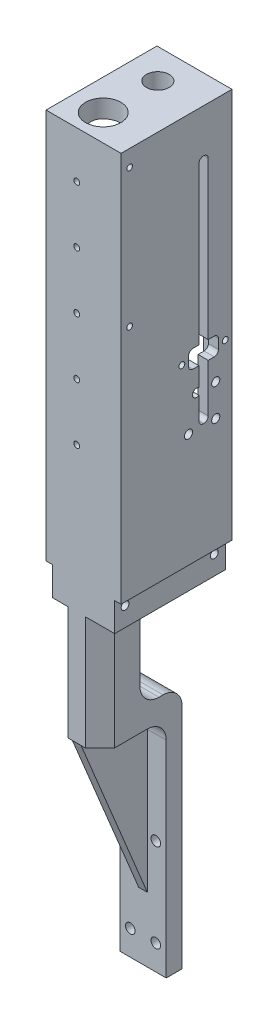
ISO-10303-21;
HEADER;
FILE_DESCRIPTION(('STEP AP214'),'2;1');
FILE_NAME('part.step','',(''),(''),'','','');
FILE_SCHEMA(('AUTOMOTIVE_DESIGN { 1 0 10303 214 1 1 1 1 }'));
ENDSEC;
DATA;
#1=APPLICATION_CONTEXT('core data for automotive mechanical design processes');
#2=APPLICATION_PROTOCOL_DEFINITION('international standard','automotive_design',2000,#1);
#3=PRODUCT_CONTEXT('',#1,'mechanical');
#4=PRODUCT('Part','Part','',(#3));
#5=PRODUCT_RELATED_PRODUCT_CATEGORY('part','',(#4));
#6=PRODUCT_DEFINITION_FORMATION('','',#4);
#7=PRODUCT_DEFINITION_CONTEXT('part definition',#1,'design');
#8=PRODUCT_DEFINITION('design','',#6,#7);
#9=PRODUCT_DEFINITION_SHAPE('','',#8);
#10=(LENGTH_UNIT() NAMED_UNIT(*) SI_UNIT(.MILLI.,.METRE.));
#11=(NAMED_UNIT(*) PLANE_ANGLE_UNIT() SI_UNIT($,.RADIAN.));
#12=(NAMED_UNIT(*) SI_UNIT($,.STERADIAN.) SOLID_ANGLE_UNIT());
#13=UNCERTAINTY_MEASURE_WITH_UNIT(LENGTH_MEASURE(1.E-05),#10,'distance_accuracy_value','');
#14=(GEOMETRIC_REPRESENTATION_CONTEXT(3) GLOBAL_UNCERTAINTY_ASSIGNED_CONTEXT((#13)) GLOBAL_UNIT_ASSIGNED_CONTEXT((#10,
#11,#12)) REPRESENTATION_CONTEXT('',''));
#15=CARTESIAN_POINT('',(0.,0.,0.));
#16=DIRECTION('',(0.,0.,1.));
#17=DIRECTION('',(1.,0.,0.));
#18=AXIS2_PLACEMENT_3D('',#15,#16,#17);
#19=CARTESIAN_POINT('',(14.986,18.542,-29.4508591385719));
#20=DIRECTION('',(0.,1.,0.));
#21=DIRECTION('',(-1.,0.,0.));
#22=AXIS2_PLACEMENT_3D('',#19,#20,#21);
#23=PLANE('',#22);
#24=DIRECTION('',(0.,0.,-1.));
#25=VECTOR('',#24,1.);
#26=CARTESIAN_POINT('',(16.637,18.542,60.96));
#27=LINE('',#26,#25);
#28=CARTESIAN_POINT('',(16.637,18.542,60.96));
#29=VERTEX_POINT('',#28);
#30=CARTESIAN_POINT('',(16.637,18.542,12.319));
#31=VERTEX_POINT('',#30);
#32=EDGE_CURVE('E540',#29,#31,#27,.T.);
#33=ORIENTED_EDGE('',*,*,#32,.F.);
#34=DIRECTION('',(-1.,0.,0.));
#35=VECTOR('',#34,1.);
#36=CARTESIAN_POINT('',(19.431,18.542,60.96));
#37=LINE('',#36,#35);
#38=CARTESIAN_POINT('',(3.81,18.542,60.96));
#39=VERTEX_POINT('',#38);
#40=EDGE_CURVE('E835',#29,#39,#37,.T.);
#41=ORIENTED_EDGE('',*,*,#40,.T.);
#42=DIRECTION('',(0.707106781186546,0.,-0.707106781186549));
#43=VECTOR('',#42,1.);
#44=CARTESIAN_POINT('',(54.6034295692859,18.542,10.1665704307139));
#45=LINE('',#44,#43);
#46=CARTESIAN_POINT('',(10.16,18.542,54.61));
#47=VERTEX_POINT('',#46);
#48=EDGE_CURVE('E45',#39,#47,#45,.T.);
#49=ORIENTED_EDGE('',*,*,#48,.T.);
#50=DIRECTION('',(0.,0.,-1.));
#51=VECTOR('',#50,1.);
#52=CARTESIAN_POINT('',(10.16,18.542,53.34));
#53=LINE('',#52,#51);
#54=CARTESIAN_POINT('',(10.16,18.542,35.433));
#55=VERTEX_POINT('',#54);
#56=EDGE_CURVE('E682',#47,#55,#53,.T.);
#57=ORIENTED_EDGE('',*,*,#56,.T.);
#58=DIRECTION('',(1.,0.,0.));
#59=VECTOR('',#58,1.);
#60=CARTESIAN_POINT('',(14.986,18.542,35.433));
#61=LINE('',#60,#59);
#62=CARTESIAN_POINT('',(10.541,18.542,35.433));
#63=VERTEX_POINT('',#62);
#64=EDGE_CURVE('E1328',#55,#63,#61,.T.);
#65=ORIENTED_EDGE('',*,*,#64,.T.);
#66=DIRECTION('',(0.,0.,-1.));
#67=VECTOR('',#66,1.);
#68=CARTESIAN_POINT('',(10.541,18.542,-29.4508591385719));
#69=LINE('',#68,#67);
#70=CARTESIAN_POINT('',(10.541,18.542,12.319));
#71=VERTEX_POINT('',#70);
#72=EDGE_CURVE('E715',#63,#71,#69,.T.);
#73=ORIENTED_EDGE('',*,*,#72,.T.);
#74=DIRECTION('',(1.,0.,0.));
#75=VECTOR('',#74,1.);
#76=CARTESIAN_POINT('',(14.986,18.542,12.319));
#77=LINE('',#76,#75);
#78=EDGE_CURVE('E841',#71,#31,#77,.T.);
#79=ORIENTED_EDGE('',*,*,#78,.T.);
#80=EDGE_LOOP('',(#33,#41,#49,#57,#65,#73,#79));
#81=FACE_BOUND('',#80,.T.);
#82=ADVANCED_FACE('F36',(#81),#23,.F.);
#83=CARTESIAN_POINT('',(-62.7463868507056,186.061999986,44.958));
#84=DIRECTION('',(1.,0.,0.));
#85=DIRECTION('',(0.,1.,0.));
#86=AXIS2_PLACEMENT_3D('',#83,#84,#85);
#87=CYLINDRICAL_SURFACE('',#86,8.382);
#88=DIRECTION('',(-1.,0.,0.));
#89=VECTOR('',#88,1.);
#90=CARTESIAN_POINT('',(14.986,186.061999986,53.34));
#91=LINE('',#90,#89);
#92=CARTESIAN_POINT('',(6.63445611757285,186.061999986,53.34));
#93=VERTEX_POINT('',#92);
#94=CARTESIAN_POINT('',(14.986,186.061999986,53.34));
#95=VERTEX_POINT('',#94);
#96=EDGE_CURVE('E862',#93,#95,#91,.F.);
#97=ORIENTED_EDGE('',*,*,#96,.F.);
#98=CARTESIAN_POINT('',(6.63445611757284,186.061999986,53.34));
#99=CARTESIAN_POINT('',(6.63445071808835,186.172889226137,53.3400009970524));
#100=CARTESIAN_POINT('',(6.63578367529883,186.283762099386,53.3377990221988));
#101=CARTESIAN_POINT('',(6.641075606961,186.505263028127,53.3290050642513));
#102=CARTESIAN_POINT('',(6.64503439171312,186.615891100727,53.3224133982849));
#103=CARTESIAN_POINT('',(6.66076140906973,186.946854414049,53.2960979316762));
#104=CARTESIAN_POINT('',(6.67638053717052,187.166530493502,53.2698335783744));
#105=CARTESIAN_POINT('',(6.71672940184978,187.600788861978,53.2004577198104));
#106=CARTESIAN_POINT('',(6.74139786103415,187.815395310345,53.157459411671));
#107=CARTESIAN_POINT('',(6.7983336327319,188.239673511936,53.0551167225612));
#108=CARTESIAN_POINT('',(6.83060252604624,188.449344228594,52.9957689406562));
#109=CARTESIAN_POINT('',(6.90076997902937,188.861859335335,52.8615175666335));
#110=CARTESIAN_POINT('',(6.93864897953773,189.064724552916,52.7866676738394));
#111=CARTESIAN_POINT('',(7.01809398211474,189.463387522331,52.6218803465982));
#112=CARTESIAN_POINT('',(7.05965985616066,189.659185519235,52.5319434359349));
#113=CARTESIAN_POINT('',(7.1870389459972,190.23597846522,52.2396014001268));
#114=CARTESIAN_POINT('',(7.27537840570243,190.605548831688,52.0149343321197));
#115=CARTESIAN_POINT('',(7.4042329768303,191.149690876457,51.6236058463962));
#116=CARTESIAN_POINT('',(7.44845051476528,191.337479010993,51.4760165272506));
#117=CARTESIAN_POINT('',(7.53080727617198,191.700631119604,51.1645225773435));
#118=CARTESIAN_POINT('',(7.56894557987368,191.875993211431,51.0006154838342));
#119=CARTESIAN_POINT('',(7.63610197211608,192.212493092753,50.6577336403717));
#120=CARTESIAN_POINT('',(7.66513846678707,192.373659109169,50.4787902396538));
#121=CARTESIAN_POINT('',(7.71123630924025,192.680628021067,50.1067631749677));
#122=CARTESIAN_POINT('',(7.72830290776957,192.82643762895,49.9136857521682));
#123=CARTESIAN_POINT('',(7.74493418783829,193.063271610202,49.5700390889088));
#124=CARTESIAN_POINT('',(7.74802369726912,193.158327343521,49.4224009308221));
#125=CARTESIAN_POINT('',(7.74537866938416,193.338938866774,49.1215138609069));
#126=CARTESIAN_POINT('',(7.73964622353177,193.424496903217,48.9682662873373));
#127=CARTESIAN_POINT('',(7.71843595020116,193.585522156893,48.6573466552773));
#128=CARTESIAN_POINT('',(7.70296550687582,193.660996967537,48.4996780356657));
#129=CARTESIAN_POINT('',(7.66150979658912,193.801504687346,48.1810881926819));
#130=CARTESIAN_POINT('',(7.63552445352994,193.866537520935,48.0201669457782));
#131=CARTESIAN_POINT('',(7.57234638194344,193.986115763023,47.6959331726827));
#132=CARTESIAN_POINT('',(7.53511281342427,194.040621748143,47.5326140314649));
#133=CARTESIAN_POINT('',(7.44912671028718,194.138802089,47.2057360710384));
#134=CARTESIAN_POINT('',(7.40037333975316,194.182475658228,47.0421772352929));
#135=CARTESIAN_POINT('',(7.291241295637,194.25919482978,46.716390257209));
#136=CARTESIAN_POINT('',(7.2308587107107,194.292236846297,46.5541625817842));
#137=CARTESIAN_POINT('',(7.09865733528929,194.34811305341,46.2327050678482));
#138=CARTESIAN_POINT('',(7.02684208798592,194.370950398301,46.073474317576));
#139=CARTESIAN_POINT('',(6.86779246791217,194.408105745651,45.7506332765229));
#140=CARTESIAN_POINT('',(6.77992126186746,194.421877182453,45.5872744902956));
#141=CARTESIAN_POINT('',(6.59271314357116,194.439825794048,45.2673380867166));
#142=CARTESIAN_POINT('',(6.4934098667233,194.444030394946,45.1107423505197));
#143=CARTESIAN_POINT('',(6.38859030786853,194.443999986,44.958));
#144=B_SPLINE_CURVE_WITH_KNOTS('',3,(#98,#99,#100,#101,#102,#103,#104,#105,#106,#107,#108,#109,
#110,#111,#112,#113,#114,#115,#116,#117,#118,#119,#120,#121,#122,#123,#124,#125,#126,#127,#128,
#129,#130,#131,#132,#133,#134,#135,#136,#137,#138,#139,#140,#141,#142,#143),.UNSPECIFIED.,.F.,
.F.,(4,2,2,2,2,2,2,2,2,2,2,2,2,2,2,2,2,2,2,2,2,2,4),(0.,0.332605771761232,0.665187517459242,
1.32956880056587,1.98953186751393,2.64963232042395,3.30748332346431,3.96531149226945,
5.28358272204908,6.01157167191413,6.73967066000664,7.46628760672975,8.19258561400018,
8.71893116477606,9.24515195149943,9.77097419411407,10.2968002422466,10.8245588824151,
11.3523558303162,11.8803306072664,12.4081420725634,12.9654091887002,13.5210767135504),.UNSPECIFIED.);
#145=CARTESIAN_POINT('',(6.38859030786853,194.443999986,44.958));
#146=VERTEX_POINT('',#145);
#147=EDGE_CURVE('E887',#93,#146,#144,.T.);
#148=ORIENTED_EDGE('',*,*,#147,.T.);
#149=DIRECTION('',(-1.,0.,0.));
#150=VECTOR('',#149,1.);
#151=CARTESIAN_POINT('',(-13.462,194.443999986,44.958));
#152=LINE('',#151,#150);
#153=CARTESIAN_POINT('',(14.986,194.443999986,44.958));
#154=VERTEX_POINT('',#153);
#155=EDGE_CURVE('E1193',#154,#146,#152,.T.);
#156=ORIENTED_EDGE('',*,*,#155,.F.);
#157=CARTESIAN_POINT('',(14.986,186.061999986,44.958));
#158=DIRECTION('',(1.,0.,0.));
#159=DIRECTION('',(0.,1.,0.));
#160=AXIS2_PLACEMENT_3D('',#157,#158,#159);
#161=CIRCLE('',#160,8.382);
#162=EDGE_CURVE('E1187',#95,#154,#161,.F.);
#163=ORIENTED_EDGE('',*,*,#162,.F.);
#164=EDGE_LOOP('',(#97,#148,#156,#163));
#165=FACE_BOUND('',#164,.T.);
#166=ADVANCED_FACE('F1100',(#165),#87,.F.);
#167=CARTESIAN_POINT('',(14.986,18.542,12.319));
#168=DIRECTION('',(1.,0.,0.));
#169=DIRECTION('',(0.,1.,0.));
#170=AXIS2_PLACEMENT_3D('',#167,#168,#169);
#171=PLANE('',#170);
#172=CARTESIAN_POINT('',(14.986,80.899,31.369));
#173=DIRECTION('',(1.,0.,0.));
#174=DIRECTION('',(0.,1.,0.));
#175=AXIS2_PLACEMENT_3D('',#172,#173,#174);
#176=CIRCLE('',#175,1.786001);
#177=CARTESIAN_POINT('',(14.986,82.685001,31.369));
#178=VERTEX_POINT('',#177);
#179=EDGE_CURVE('E776',#178,#178,#176,.T.);
#180=ORIENTED_EDGE('',*,*,#179,.T.);
#181=EDGE_LOOP('',(#180));
#182=FACE_BOUND('',#181,.T.);
#183=CARTESIAN_POINT('',(14.986,94.869,19.431));
#184=DIRECTION('',(1.,0.,0.));
#185=DIRECTION('',(0.,1.,0.));
#186=AXIS2_PLACEMENT_3D('',#183,#184,#185);
#187=CIRCLE('',#186,1.786001);
#188=CARTESIAN_POINT('',(14.986,96.655001,19.431));
#189=VERTEX_POINT('',#188);
#190=EDGE_CURVE('E782',#189,#189,#187,.T.);
#191=ORIENTED_EDGE('',*,*,#190,.T.);
#192=EDGE_LOOP('',(#191));
#193=FACE_BOUND('',#192,.T.);
#194=DIRECTION('',(0.,-1.,0.));
#195=VECTOR('',#194,1.);
#196=CARTESIAN_POINT('',(14.986,18.542,31.3182));
#197=LINE('',#196,#195);
#198=CARTESIAN_POINT('',(14.986,110.617,31.3182));
#199=VERTEX_POINT('',#198);
#200=CARTESIAN_POINT('',(14.986,106.553,31.3182));
#201=VERTEX_POINT('',#200);
#202=EDGE_CURVE('E640',#199,#201,#197,.T.);
#203=ORIENTED_EDGE('',*,*,#202,.T.);
#204=CARTESIAN_POINT('',(14.986,106.553,29.4132));
#205=DIRECTION('',(1.,0.,0.));
#206=DIRECTION('',(0.,1.,0.));
#207=AXIS2_PLACEMENT_3D('',#204,#205,#206);
#208=CIRCLE('',#207,1.905);
#209=CARTESIAN_POINT('',(14.986,104.648,29.4132));
#210=VERTEX_POINT('',#209);
#211=EDGE_CURVE('E1213',#201,#210,#208,.T.);
#212=ORIENTED_EDGE('',*,*,#211,.T.);
#213=DIRECTION('',(0.,0.,-1.));
#214=VECTOR('',#213,1.);
#215=CARTESIAN_POINT('',(14.986,104.648,12.319));
#216=LINE('',#215,#214);
#217=CARTESIAN_POINT('',(14.986,104.648,26.797));
#218=VERTEX_POINT('',#217);
#219=EDGE_CURVE('E632',#210,#218,#216,.T.);
#220=ORIENTED_EDGE('',*,*,#219,.T.);
#221=DIRECTION('',(0.,-1.,0.));
#222=VECTOR('',#221,1.);
#223=CARTESIAN_POINT('',(14.986,18.542,26.797));
#224=LINE('',#223,#222);
#225=CARTESIAN_POINT('',(14.986,96.3378579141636,26.797));
#226=VERTEX_POINT('',#225);
#227=EDGE_CURVE('E599',#218,#226,#224,.T.);
#228=ORIENTED_EDGE('',*,*,#227,.T.);
#229=CARTESIAN_POINT('',(14.986,94.869,27.813));
#230=DIRECTION('',(1.,0.,0.));
#231=DIRECTION('',(0.,1.,0.));
#232=AXIS2_PLACEMENT_3D('',#229,#230,#231);
#233=CIRCLE('',#232,1.786001);
#234=CARTESIAN_POINT('',(14.986,93.4001420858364,26.797));
#235=VERTEX_POINT('',#234);
#236=EDGE_CURVE('E788',#226,#235,#233,.T.);
#237=ORIENTED_EDGE('',*,*,#236,.T.);
#238=CARTESIAN_POINT('',(14.986,83.547599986,26.797));
#239=VERTEX_POINT('',#238);
#240=EDGE_CURVE('E604',#235,#239,#224,.T.);
#241=ORIENTED_EDGE('',*,*,#240,.T.);
#242=CARTESIAN_POINT('',(14.986,83.547599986,24.892));
#243=DIRECTION('',(1.,0.,0.));
#244=DIRECTION('',(0.,1.,0.));
#245=AXIS2_PLACEMENT_3D('',#242,#243,#244);
#246=CIRCLE('',#245,1.905);
#247=CARTESIAN_POINT('',(14.986,81.642599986,24.892));
#248=VERTEX_POINT('',#247);
#249=EDGE_CURVE('E1205',#239,#248,#246,.T.);
#250=ORIENTED_EDGE('',*,*,#249,.T.);
#251=DIRECTION('',(0.,0.,-1.));
#252=VECTOR('',#251,1.);
#253=CARTESIAN_POINT('',(14.986,81.642599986,12.319));
#254=LINE('',#253,#252);
#255=CARTESIAN_POINT('',(14.986,81.642599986,24.638));
#256=VERTEX_POINT('',#255);
#257=EDGE_CURVE('E613',#248,#256,#254,.T.);
#258=ORIENTED_EDGE('',*,*,#257,.T.);
#259=CARTESIAN_POINT('',(14.986,83.547599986,24.638));
#260=DIRECTION('',(1.,0.,0.));
#261=DIRECTION('',(0.,1.,0.));
#262=AXIS2_PLACEMENT_3D('',#259,#260,#261);
#263=CIRCLE('',#262,1.905);
#264=CARTESIAN_POINT('',(14.986,83.547599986,22.733));
#265=VERTEX_POINT('',#264);
#266=EDGE_CURVE('E1209',#256,#265,#263,.T.);
#267=ORIENTED_EDGE('',*,*,#266,.T.);
#268=DIRECTION('',(0.,1.,0.));
#269=VECTOR('',#268,1.);
#270=CARTESIAN_POINT('',(14.986,18.542,22.7329999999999));
#271=LINE('',#270,#269);
#272=CARTESIAN_POINT('',(14.986,104.648,22.733));
#273=VERTEX_POINT('',#272);
#274=EDGE_CURVE('E593',#265,#273,#271,.T.);
#275=ORIENTED_EDGE('',*,*,#274,.T.);
#276=CARTESIAN_POINT('',(14.986,104.648,20.1168));
#277=VERTEX_POINT('',#276);
#278=EDGE_CURVE('E631',#273,#277,#216,.T.);
#279=ORIENTED_EDGE('',*,*,#278,.T.);
#280=CARTESIAN_POINT('',(14.986,106.553,20.1168));
#281=DIRECTION('',(1.,0.,0.));
#282=DIRECTION('',(0.,1.,0.));
#283=AXIS2_PLACEMENT_3D('',#280,#281,#282);
#284=CIRCLE('',#283,1.905);
#285=CARTESIAN_POINT('',(14.986,106.553,18.2118));
#286=VERTEX_POINT('',#285);
#287=EDGE_CURVE('E1217',#277,#286,#284,.T.);
#288=ORIENTED_EDGE('',*,*,#287,.T.);
#289=DIRECTION('',(0.,1.,0.));
#290=VECTOR('',#289,1.);
#291=CARTESIAN_POINT('',(14.986,18.542,18.2118));
#292=LINE('',#291,#290);
#293=CARTESIAN_POINT('',(14.986,110.617,18.2118));
#294=VERTEX_POINT('',#293);
#295=EDGE_CURVE('E634',#286,#294,#292,.T.);
#296=ORIENTED_EDGE('',*,*,#295,.T.);
#297=CARTESIAN_POINT('',(14.986,110.617,20.1168));
#298=DIRECTION('',(1.,0.,0.));
#299=DIRECTION('',(0.,1.,0.));
#300=AXIS2_PLACEMENT_3D('',#297,#298,#299);
#301=CIRCLE('',#300,1.905);
#302=CARTESIAN_POINT('',(14.986,112.522,20.1168));
#303=VERTEX_POINT('',#302);
#304=EDGE_CURVE('E1221',#294,#303,#301,.T.);
#305=ORIENTED_EDGE('',*,*,#304,.T.);
#306=DIRECTION('',(0.,0.,1.));
#307=VECTOR('',#306,1.);
#308=CARTESIAN_POINT('',(14.986,112.522,12.319));
#309=LINE('',#308,#307);
#310=CARTESIAN_POINT('',(14.986,112.522,22.733));
#311=VERTEX_POINT('',#310);
#312=EDGE_CURVE('E638',#303,#311,#309,.T.);
#313=ORIENTED_EDGE('',*,*,#312,.T.);
#314=CARTESIAN_POINT('',(14.986,181.426499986,22.733));
#315=VERTEX_POINT('',#314);
#316=EDGE_CURVE('E596',#311,#315,#271,.T.);
#317=ORIENTED_EDGE('',*,*,#316,.T.);
#318=CARTESIAN_POINT('',(14.986,181.426499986,24.638));
#319=DIRECTION('',(1.,0.,0.));
#320=DIRECTION('',(0.,1.,0.));
#321=AXIS2_PLACEMENT_3D('',#318,#319,#320);
#322=CIRCLE('',#321,1.905);
#323=CARTESIAN_POINT('',(14.986,183.331499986,24.638));
#324=VERTEX_POINT('',#323);
#325=EDGE_CURVE('E1201',#315,#324,#322,.T.);
#326=ORIENTED_EDGE('',*,*,#325,.T.);
#327=DIRECTION('',(0.,0.,1.));
#328=VECTOR('',#327,1.);
#329=CARTESIAN_POINT('',(14.986,183.331499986,12.319));
#330=LINE('',#329,#328);
#331=CARTESIAN_POINT('',(14.986,183.331499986,24.892));
#332=VERTEX_POINT('',#331);
#333=EDGE_CURVE('E616',#324,#332,#330,.T.);
#334=ORIENTED_EDGE('',*,*,#333,.T.);
#335=CARTESIAN_POINT('',(14.986,181.426499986,24.892));
#336=DIRECTION('',(1.,0.,0.));
#337=DIRECTION('',(0.,1.,0.));
#338=AXIS2_PLACEMENT_3D('',#335,#336,#337);
#339=CIRCLE('',#338,1.905);
#340=CARTESIAN_POINT('',(14.986,181.426499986,26.797));
#341=VERTEX_POINT('',#340);
#342=EDGE_CURVE('E1197',#332,#341,#339,.T.);
#343=ORIENTED_EDGE('',*,*,#342,.T.);
#344=CARTESIAN_POINT('',(14.986,112.522,26.797));
#345=VERTEX_POINT('',#344);
#346=EDGE_CURVE('E603',#341,#345,#224,.T.);
#347=ORIENTED_EDGE('',*,*,#346,.T.);
#348=CARTESIAN_POINT('',(14.986,112.522,29.4132));
#349=VERTEX_POINT('',#348);
#350=EDGE_CURVE('E637',#345,#349,#309,.T.);
#351=ORIENTED_EDGE('',*,*,#350,.T.);
#352=CARTESIAN_POINT('',(14.986,110.617,29.4132));
#353=DIRECTION('',(1.,0.,0.));
#354=DIRECTION('',(0.,1.,0.));
#355=AXIS2_PLACEMENT_3D('',#352,#353,#354);
#356=CIRCLE('',#355,1.905);
#357=EDGE_CURVE('E1225',#349,#199,#356,.T.);
#358=ORIENTED_EDGE('',*,*,#357,.T.);
#359=EDGE_LOOP('',(#203,#212,#220,#228,#237,#241,#250,#258,#267,#275,#279,#288,#296,#305,#313,
#317,#326,#334,#343,#347,#351,#358));
#360=FACE_BOUND('',#359,.T.);
#361=CARTESIAN_POINT('',(14.986,80.899,19.431));
#362=DIRECTION('',(1.,0.,0.));
#363=DIRECTION('',(0.,1.,0.));
#364=AXIS2_PLACEMENT_3D('',#361,#362,#363);
#365=CIRCLE('',#364,1.786001);
#366=CARTESIAN_POINT('',(14.986,82.685001,19.431));
#367=VERTEX_POINT('',#366);
#368=EDGE_CURVE('E794',#367,#367,#365,.T.);
#369=ORIENTED_EDGE('',*,*,#368,.T.);
#370=EDGE_LOOP('',(#369));
#371=FACE_BOUND('',#370,.T.);
#372=CARTESIAN_POINT('',(14.986,108.585,34.29));
#373=DIRECTION('',(1.,0.,0.));
#374=DIRECTION('',(0.,1.,0.));
#375=AXIS2_PLACEMENT_3D('',#372,#373,#374);
#376=CIRCLE('',#375,1.28904999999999);
#377=CARTESIAN_POINT('',(14.986,109.87405,34.29));
#378=VERTEX_POINT('',#377);
#379=EDGE_CURVE('E827',#378,#378,#376,.T.);
#380=ORIENTED_EDGE('',*,*,#379,.T.);
#381=EDGE_LOOP('',(#380));
#382=FACE_BOUND('',#381,.T.);
#383=DIRECTION('',(0.,0.,1.));
#384=VECTOR('',#383,1.);
#385=CARTESIAN_POINT('',(14.986,194.443999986,12.319));
#386=LINE('',#385,#384);
#387=CARTESIAN_POINT('',(14.986,194.443999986,24.257));
#388=VERTEX_POINT('',#387);
#389=EDGE_CURVE('E567',#388,#154,#386,.T.);
#390=ORIENTED_EDGE('',*,*,#389,.F.);
#391=CARTESIAN_POINT('',(14.986,186.061999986,24.257));
#392=DIRECTION('',(1.,0.,0.));
#393=DIRECTION('',(0.,1.,0.));
#394=AXIS2_PLACEMENT_3D('',#391,#392,#393);
#395=CIRCLE('',#394,8.382);
#396=CARTESIAN_POINT('',(14.986,186.061999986,15.875));
#397=VERTEX_POINT('',#396);
#398=EDGE_CURVE('E1186',#388,#397,#395,.F.);
#399=ORIENTED_EDGE('',*,*,#398,.T.);
#400=DIRECTION('',(0.,1.,0.));
#401=VECTOR('',#400,1.);
#402=CARTESIAN_POINT('',(14.986,45.466,15.875));
#403=LINE('',#402,#401);
#404=CARTESIAN_POINT('',(14.986,109.70679539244,15.875));
#405=VERTEX_POINT('',#404);
#406=EDGE_CURVE('E755',#405,#397,#403,.T.);
#407=ORIENTED_EDGE('',*,*,#406,.F.);
#408=CARTESIAN_POINT('',(14.986,108.585,15.24));
#409=DIRECTION('',(1.,0.,0.));
#410=DIRECTION('',(0.,1.,0.));
#411=AXIS2_PLACEMENT_3D('',#408,#409,#410);
#412=CIRCLE('',#411,1.28904999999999);
#413=CARTESIAN_POINT('',(14.986,107.46320460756,15.875));
#414=VERTEX_POINT('',#413);
#415=EDGE_CURVE('E821',#405,#414,#412,.T.);
#416=ORIENTED_EDGE('',*,*,#415,.T.);
#417=CARTESIAN_POINT('',(14.986,45.466,15.875));
#418=VERTEX_POINT('',#417);
#419=EDGE_CURVE('E723',#418,#414,#403,.T.);
#420=ORIENTED_EDGE('',*,*,#419,.F.);
#421=CARTESIAN_POINT('',(14.986,45.466,24.257));
#422=DIRECTION('',(1.,0.,0.));
#423=DIRECTION('',(0.,1.,0.));
#424=AXIS2_PLACEMENT_3D('',#421,#422,#423);
#425=CIRCLE('',#424,8.382);
#426=CARTESIAN_POINT('',(14.986,37.084,24.257));
#427=VERTEX_POINT('',#426);
#428=EDGE_CURVE('E752',#427,#418,#425,.T.);
#429=ORIENTED_EDGE('',*,*,#428,.F.);
#430=DIRECTION('',(0.,0.,-1.));
#431=VECTOR('',#430,1.);
#432=CARTESIAN_POINT('',(14.986,37.084,24.257));
#433=LINE('',#432,#431);
#434=CARTESIAN_POINT('',(14.986,37.084,26.543));
#435=VERTEX_POINT('',#434);
#436=EDGE_CURVE('E749',#435,#427,#433,.T.);
#437=ORIENTED_EDGE('',*,*,#436,.F.);
#438=CARTESIAN_POINT('',(14.986,45.466,26.543));
#439=DIRECTION('',(1.,0.,0.));
#440=DIRECTION('',(0.,1.,0.));
#441=AXIS2_PLACEMENT_3D('',#438,#439,#440);
#442=CIRCLE('',#441,8.382);
#443=CARTESIAN_POINT('',(14.986,45.466,34.925));
#444=VERTEX_POINT('',#443);
#445=EDGE_CURVE('E746',#444,#435,#442,.T.);
#446=ORIENTED_EDGE('',*,*,#445,.F.);
#447=DIRECTION('',(0.,-1.,0.));
#448=VECTOR('',#447,1.);
#449=CARTESIAN_POINT('',(14.986,45.466,34.925));
#450=LINE('',#449,#448);
#451=CARTESIAN_POINT('',(14.986,82.042,34.925));
#452=VERTEX_POINT('',#451);
#453=EDGE_CURVE('E743',#452,#444,#450,.T.);
#454=ORIENTED_EDGE('',*,*,#453,.F.);
#455=DIRECTION('',(0.,0.,-1.));
#456=VECTOR('',#455,1.);
#457=CARTESIAN_POINT('',(14.986,82.042,34.925));
#458=LINE('',#457,#456);
#459=CARTESIAN_POINT('',(14.986,82.042,44.958));
#460=VERTEX_POINT('',#459);
#461=EDGE_CURVE('E719',#460,#452,#458,.T.);
#462=ORIENTED_EDGE('',*,*,#461,.F.);
#463=CARTESIAN_POINT('',(14.986,90.424,44.958));
#464=DIRECTION('',(1.,0.,0.));
#465=DIRECTION('',(0.,1.,0.));
#466=AXIS2_PLACEMENT_3D('',#463,#464,#465);
#467=CIRCLE('',#466,8.382);
#468=CARTESIAN_POINT('',(14.986,90.424,53.34));
#469=VERTEX_POINT('',#468);
#470=EDGE_CURVE('E1334',#460,#469,#467,.F.);
#471=ORIENTED_EDGE('',*,*,#470,.T.);
#472=DIRECTION('',(0.,1.,0.));
#473=VECTOR('',#472,1.);
#474=CARTESIAN_POINT('',(14.986,194.443999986,53.34));
#475=LINE('',#474,#473);
#476=EDGE_CURVE('E849',#469,#95,#475,.T.);
#477=ORIENTED_EDGE('',*,*,#476,.T.);
#478=ORIENTED_EDGE('',*,*,#162,.T.);
#479=EDGE_LOOP('',(#390,#399,#407,#416,#420,#429,#437,#446,#454,#462,#471,#477,#478));
#480=FACE_BOUND('',#479,.T.);
#481=ADVANCED_FACE('F1097',(#182,#193,#360,#371,#382,#480),#171,.F.);
#482=CARTESIAN_POINT('',(-13.4620250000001,112.522,31.3182));
#483=DIRECTION('',(0.,1.,0.));
#484=DIRECTION('',(-1.,0.,0.));
#485=AXIS2_PLACEMENT_3D('',#482,#483,#484);
#486=PLANE('',#485);
#487=DIRECTION('',(0.,0.,1.));
#488=VECTOR('',#487,1.);
#489=CARTESIAN_POINT('',(19.431,112.522,31.3182));
#490=LINE('',#489,#488);
#491=CARTESIAN_POINT('',(19.431,112.522,26.797));
#492=VERTEX_POINT('',#491);
#493=CARTESIAN_POINT('',(19.431,112.522,29.4132));
#494=VERTEX_POINT('',#493);
#495=EDGE_CURVE('E628',#492,#494,#490,.T.);
#496=ORIENTED_EDGE('',*,*,#495,.T.);
#497=DIRECTION('',(1.,0.,0.));
#498=VECTOR('',#497,1.);
#499=CARTESIAN_POINT('',(14.986,112.522,29.4132));
#500=LINE('',#499,#498);
#501=EDGE_CURVE('E1262',#494,#349,#500,.F.);
#502=ORIENTED_EDGE('',*,*,#501,.T.);
#503=ORIENTED_EDGE('',*,*,#350,.F.);
#504=DIRECTION('',(1.,0.,0.));
#505=VECTOR('',#504,1.);
#506=CARTESIAN_POINT('',(-13.4620250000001,112.522,26.797));
#507=LINE('',#506,#505);
#508=EDGE_CURVE('E607',#345,#492,#507,.T.);
#509=ORIENTED_EDGE('',*,*,#508,.T.);
#510=EDGE_LOOP('',(#496,#502,#503,#509));
#511=FACE_BOUND('',#510,.T.);
#512=ADVANCED_FACE('F942',(#511),#486,.F.);
#513=CARTESIAN_POINT('',(-13.4620250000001,104.648,31.3182));
#514=DIRECTION('',(0.,-1.,0.));
#515=DIRECTION('',(1.,0.,0.));
#516=AXIS2_PLACEMENT_3D('',#513,#514,#515);
#517=PLANE('',#516);
#518=ORIENTED_EDGE('',*,*,#219,.F.);
#519=DIRECTION('',(1.,0.,0.));
#520=VECTOR('',#519,1.);
#521=CARTESIAN_POINT('',(19.431,104.648,29.4132));
#522=LINE('',#521,#520);
#523=CARTESIAN_POINT('',(19.431,104.648,29.4132));
#524=VERTEX_POINT('',#523);
#525=EDGE_CURVE('E1249',#210,#524,#522,.T.);
#526=ORIENTED_EDGE('',*,*,#525,.T.);
#527=DIRECTION('',(0.,0.,-1.));
#528=VECTOR('',#527,1.);
#529=CARTESIAN_POINT('',(19.431,104.648,31.3182));
#530=LINE('',#529,#528);
#531=CARTESIAN_POINT('',(19.431,104.648,26.797));
#532=VERTEX_POINT('',#531);
#533=EDGE_CURVE('E623',#524,#532,#530,.T.);
#534=ORIENTED_EDGE('',*,*,#533,.T.);
#535=DIRECTION('',(-1.,0.,0.));
#536=VECTOR('',#535,1.);
#537=CARTESIAN_POINT('',(-13.4620250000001,104.648,26.797));
#538=LINE('',#537,#536);
#539=EDGE_CURVE('E1269',#532,#218,#538,.T.);
#540=ORIENTED_EDGE('',*,*,#539,.T.);
#541=EDGE_LOOP('',(#518,#526,#534,#540));
#542=FACE_BOUND('',#541,.T.);
#543=ADVANCED_FACE('F950',(#542),#517,.F.);
#544=DIRECTION('',(1.,0.,0.));
#545=VECTOR('',#544,1.);
#546=CARTESIAN_POINT('',(-13.4620000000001,18.542,60.96));
#547=LINE('',#546,#545);
#548=CARTESIAN_POINT('',(-10.668,18.542,60.96));
#549=VERTEX_POINT('',#548);
#550=CARTESIAN_POINT('',(-3.80999999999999,18.542,60.96));
#551=VERTEX_POINT('',#550);
#552=EDGE_CURVE('E665',#549,#551,#547,.T.);
#553=ORIENTED_EDGE('',*,*,#552,.F.);
#554=DIRECTION('',(0.,0.,1.));
#555=VECTOR('',#554,1.);
#556=CARTESIAN_POINT('',(-10.668,18.542,60.96));
#557=LINE('',#556,#555);
#558=CARTESIAN_POINT('',(-10.668,18.542,35.433));
#559=VERTEX_POINT('',#558);
#560=EDGE_CURVE('E521',#559,#549,#557,.T.);
#561=ORIENTED_EDGE('',*,*,#560,.F.);
#562=CARTESIAN_POINT('',(-10.16,18.542,35.433));
#563=VERTEX_POINT('',#562);
#564=EDGE_CURVE('E1325',#559,#563,#61,.T.);
#565=ORIENTED_EDGE('',*,*,#564,.T.);
#566=DIRECTION('',(0.,0.,1.));
#567=VECTOR('',#566,1.);
#568=CARTESIAN_POINT('',(-10.16,18.542,53.34));
#569=LINE('',#568,#567);
#570=CARTESIAN_POINT('',(-10.16,18.542,54.61));
#571=VERTEX_POINT('',#570);
#572=EDGE_CURVE('E678',#563,#571,#569,.T.);
#573=ORIENTED_EDGE('',*,*,#572,.T.);
#574=DIRECTION('',(0.707106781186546,0.,0.707106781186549));
#575=VECTOR('',#574,1.);
#576=CARTESIAN_POINT('',(-39.6174295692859,18.542,25.1525704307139));
#577=LINE('',#576,#575);
#578=EDGE_CURVE('E13',#571,#551,#577,.T.);
#579=ORIENTED_EDGE('',*,*,#578,.T.);
#580=EDGE_LOOP('',(#553,#561,#565,#573,#579));
#581=FACE_BOUND('',#580,.T.);
#582=ADVANCED_FACE('F1111',(#581),#23,.F.);
#583=CARTESIAN_POINT('',(14.986,-31.3055,31.877));
#584=DIRECTION('',(0.,1.,0.));
#585=DIRECTION('',(-1.,0.,0.));
#586=AXIS2_PLACEMENT_3D('',#583,#584,#585);
#587=PLANE('',#586);
#588=DIRECTION('',(-1.,0.,0.));
#589=VECTOR('',#588,1.);
#590=CARTESIAN_POINT('',(14.986,-31.3055,60.96));
#591=LINE('',#590,#589);
#592=CARTESIAN_POINT('',(-1.905,-31.3055,60.96));
#593=VERTEX_POINT('',#592);
#594=CARTESIAN_POINT('',(-3.81,-31.3055,60.96));
#595=VERTEX_POINT('',#594);
#596=EDGE_CURVE('E667',#593,#595,#591,.T.);
#597=ORIENTED_EDGE('',*,*,#596,.T.);
#598=DIRECTION('',(-0.707106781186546,0.,-0.707106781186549));
#599=VECTOR('',#598,1.);
#600=CARTESIAN_POINT('',(-3.81000000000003,-31.3055,60.96));
#601=LINE('',#600,#599);
#602=CARTESIAN_POINT('',(-10.16,-31.3055,54.61));
#603=VERTEX_POINT('',#602);
#604=EDGE_CURVE('E1356',#595,#603,#601,.T.);
#605=ORIENTED_EDGE('',*,*,#604,.T.);
#606=DIRECTION('',(0.,0.,1.));
#607=VECTOR('',#606,1.);
#608=CARTESIAN_POINT('',(-10.16,-31.3055,24.892));
#609=LINE('',#608,#607);
#610=CARTESIAN_POINT('',(-10.16,-31.3055,40.259));
#611=VERTEX_POINT('',#610);
#612=EDGE_CURVE('E1320',#611,#603,#609,.T.);
#613=ORIENTED_EDGE('',*,*,#612,.F.);
#614=DIRECTION('',(-1.,0.,0.));
#615=VECTOR('',#614,1.);
#616=CARTESIAN_POINT('',(14.986,-31.3055,40.259));
#617=LINE('',#616,#615);
#618=CARTESIAN_POINT('',(-1.905,-31.3055,40.259));
#619=VERTEX_POINT('',#618);
#620=EDGE_CURVE('E1306',#611,#619,#617,.F.);
#621=ORIENTED_EDGE('',*,*,#620,.T.);
#622=DIRECTION('',(0.,0.,1.));
#623=VECTOR('',#622,1.);
#624=CARTESIAN_POINT('',(-1.905,-31.3055,60.96));
#625=LINE('',#624,#623);
#626=EDGE_CURVE('E646',#619,#593,#625,.T.);
#627=ORIENTED_EDGE('',*,*,#626,.T.);
#628=EDGE_LOOP('',(#597,#605,#613,#621,#627));
#629=FACE_BOUND('',#628,.T.);
#630=ADVANCED_FACE('F981',(#629),#587,.F.);
#631=CARTESIAN_POINT('',(14.986,-39.6875,40.259));
#632=DIRECTION('',(-1.,0.,0.));
#633=DIRECTION('',(0.,-1.,0.));
#634=AXIS2_PLACEMENT_3D('',#631,#632,#633);
#635=CYLINDRICAL_SURFACE('',#634,8.382);
#636=CARTESIAN_POINT('',(-1.905,-39.6875,40.259));
#637=DIRECTION('',(1.,0.,0.));
#638=DIRECTION('',(0.,0.,-1.));
#639=AXIS2_PLACEMENT_3D('',#636,#637,#638);
#640=CIRCLE('',#639,8.382);
#641=CARTESIAN_POINT('',(-1.905,-39.6875,31.8769999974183));
#642=VERTEX_POINT('',#641);
#643=EDGE_CURVE('E1293',#619,#642,#640,.F.);
#644=ORIENTED_EDGE('',*,*,#643,.F.);
#645=ORIENTED_EDGE('',*,*,#620,.F.);
#646=CARTESIAN_POINT('',(-10.16,-39.6875,40.259));
#647=DIRECTION('',(1.,0.,0.));
#648=DIRECTION('',(0.,1.,0.));
#649=AXIS2_PLACEMENT_3D('',#646,#647,#648);
#650=CIRCLE('',#649,8.382);
#651=CARTESIAN_POINT('',(-10.16,-39.6875,31.877));
#652=VERTEX_POINT('',#651);
#653=EDGE_CURVE('E1298',#652,#611,#650,.T.);
#654=ORIENTED_EDGE('',*,*,#653,.F.);
#655=DIRECTION('',(-1.,0.,0.));
#656=VECTOR('',#655,1.);
#657=CARTESIAN_POINT('',(14.986,-39.6875,31.877));
#658=LINE('',#657,#656);
#659=EDGE_CURVE('E1313',#642,#652,#658,.T.);
#660=ORIENTED_EDGE('',*,*,#659,.F.);
#661=EDGE_LOOP('',(#644,#645,#654,#660));
#662=FACE_BOUND('',#661,.T.);
#663=ADVANCED_FACE('F1114',(#662),#635,.F.);
#664=CARTESIAN_POINT('',(-13.462,-101.6,60.96));
#665=DIRECTION('',(0.,0.,1.));
#666=DIRECTION('',(1.,0.,0.));
#667=AXIS2_PLACEMENT_3D('',#664,#665,#666);
#668=PLANE('',#667);
#669=DIRECTION('',(-1.,0.,0.));
#670=VECTOR('',#669,1.);
#671=CARTESIAN_POINT('',(-10.668,31.115,60.96));
#672=LINE('',#671,#670);
#673=CARTESIAN_POINT('',(-10.668,31.115,60.96));
#674=VERTEX_POINT('',#673);
#675=CARTESIAN_POINT('',(-13.462,31.115,60.96));
#676=VERTEX_POINT('',#675);
#677=EDGE_CURVE('E523',#674,#676,#672,.T.);
#678=ORIENTED_EDGE('',*,*,#677,.F.);
#679=DIRECTION('',(0.,1.,0.));
#680=VECTOR('',#679,1.);
#681=CARTESIAN_POINT('',(-10.668,31.115,60.96));
#682=LINE('',#681,#680);
#683=EDGE_CURVE('E516',#549,#674,#682,.T.);
#684=ORIENTED_EDGE('',*,*,#683,.F.);
#685=ORIENTED_EDGE('',*,*,#552,.T.);
#686=DIRECTION('',(0.,-1.,0.));
#687=VECTOR('',#686,1.);
#688=CARTESIAN_POINT('',(-3.81000000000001,-31.3055,60.96));
#689=LINE('',#688,#687);
#690=EDGE_CURVE('E1364',#551,#595,#689,.T.);
#691=ORIENTED_EDGE('',*,*,#690,.T.);
#692=ORIENTED_EDGE('',*,*,#596,.F.);
#693=DIRECTION('',(-1.,0.,0.));
#694=VECTOR('',#693,1.);
#695=CARTESIAN_POINT('',(1.905,-31.3055,60.96));
#696=LINE('',#695,#694);
#697=CARTESIAN_POINT('',(1.905,-31.3055,60.96));
#698=VERTEX_POINT('',#697);
#699=EDGE_CURVE('E662',#698,#593,#696,.T.);
#700=ORIENTED_EDGE('',*,*,#699,.F.);
#701=CARTESIAN_POINT('',(3.80999999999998,-31.3055,60.96));
#702=VERTEX_POINT('',#701);
#703=EDGE_CURVE('E671',#702,#698,#591,.T.);
#704=ORIENTED_EDGE('',*,*,#703,.F.);
#705=DIRECTION('',(0.,1.,0.));
#706=VECTOR('',#705,1.);
#707=CARTESIAN_POINT('',(3.81,18.542,60.96));
#708=LINE('',#707,#706);
#709=EDGE_CURVE('E1362',#702,#39,#708,.T.);
#710=ORIENTED_EDGE('',*,*,#709,.T.);
#711=ORIENTED_EDGE('',*,*,#40,.F.);
#712=DIRECTION('',(0.,-1.,0.));
#713=VECTOR('',#712,1.);
#714=CARTESIAN_POINT('',(16.637,31.115,60.96));
#715=LINE('',#714,#713);
#716=CARTESIAN_POINT('',(16.637,31.115,60.96));
#717=VERTEX_POINT('',#716);
#718=EDGE_CURVE('E538',#717,#29,#715,.T.);
#719=ORIENTED_EDGE('',*,*,#718,.F.);
#720=DIRECTION('',(1.,0.,0.));
#721=VECTOR('',#720,1.);
#722=CARTESIAN_POINT('',(16.637,31.115,60.96));
#723=LINE('',#722,#721);
#724=CARTESIAN_POINT('',(19.431,31.115,60.96));
#725=VERTEX_POINT('',#724);
#726=EDGE_CURVE('E549',#717,#725,#723,.T.);
#727=ORIENTED_EDGE('',*,*,#726,.T.);
#728=DIRECTION('',(0.,-1.,0.));
#729=VECTOR('',#728,1.);
#730=CARTESIAN_POINT('',(19.431,18.542,60.96));
#731=LINE('',#730,#729);
#732=CARTESIAN_POINT('',(19.431,202.381499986,60.96));
#733=VERTEX_POINT('',#732);
#734=EDGE_CURVE('E832',#733,#725,#731,.T.);
#735=ORIENTED_EDGE('',*,*,#734,.F.);
#736=DIRECTION('',(-1.,0.,0.));
#737=VECTOR('',#736,1.);
#738=CARTESIAN_POINT('',(19.431,202.381499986,60.96));
#739=LINE('',#738,#737);
#740=CARTESIAN_POINT('',(-13.462,202.381499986,60.96));
#741=VERTEX_POINT('',#740);
#742=EDGE_CURVE('E836',#733,#741,#739,.T.);
#743=ORIENTED_EDGE('',*,*,#742,.T.);
#744=DIRECTION('',(0.,-1.,0.));
#745=VECTOR('',#744,1.);
#746=CARTESIAN_POINT('',(-13.462,194.443999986,60.96));
#747=LINE('',#746,#745);
#748=EDGE_CURVE('E845',#741,#676,#747,.T.);
#749=ORIENTED_EDGE('',*,*,#748,.T.);
#750=EDGE_LOOP('',(#678,#684,#685,#691,#692,#700,#704,#710,#711,#719,#727,#735,#743,#749));
#751=FACE_BOUND('',#750,.T.);
#752=CARTESIAN_POINT('',(0.,81.9439999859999,60.96));
#753=DIRECTION('',(0.,0.,1.));
#754=DIRECTION('',(1.,0.,0.));
#755=AXIS2_PLACEMENT_3D('',#752,#753,#754);
#756=CIRCLE('',#755,1.28904999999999);
#757=CARTESIAN_POINT('',(1.28904999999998,81.9439999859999,60.96));
#758=VERTEX_POINT('',#757);
#759=EDGE_CURVE('E800',#758,#758,#756,.T.);
#760=ORIENTED_EDGE('',*,*,#759,.F.);
#761=EDGE_LOOP('',(#760));
#762=FACE_BOUND('',#761,.T.);
#763=CARTESIAN_POINT('',(0.,106.943999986,60.96));
#764=DIRECTION('',(0.,0.,1.));
#765=DIRECTION('',(1.,0.,0.));
#766=AXIS2_PLACEMENT_3D('',#763,#764,#765);
#767=CIRCLE('',#766,1.28904999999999);
#768=CARTESIAN_POINT('',(1.28904999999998,106.943999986,60.96));
#769=VERTEX_POINT('',#768);
#770=EDGE_CURVE('E804',#769,#769,#767,.T.);
#771=ORIENTED_EDGE('',*,*,#770,.F.);
#772=EDGE_LOOP('',(#771));
#773=FACE_BOUND('',#772,.T.);
#774=CARTESIAN_POINT('',(0.,131.943999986,60.96));
#775=DIRECTION('',(0.,0.,1.));
#776=DIRECTION('',(1.,0.,0.));
#777=AXIS2_PLACEMENT_3D('',#774,#775,#776);
#778=CIRCLE('',#777,1.28904999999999);
#779=CARTESIAN_POINT('',(1.28904999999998,131.943999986,60.96));
#780=VERTEX_POINT('',#779);
#781=EDGE_CURVE('E808',#780,#780,#778,.T.);
#782=ORIENTED_EDGE('',*,*,#781,.F.);
#783=EDGE_LOOP('',(#782));
#784=FACE_BOUND('',#783,.T.);
#785=CARTESIAN_POINT('',(0.,156.943999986,60.96));
#786=DIRECTION('',(0.,0.,1.));
#787=DIRECTION('',(1.,0.,0.));
#788=AXIS2_PLACEMENT_3D('',#785,#786,#787);
#789=CIRCLE('',#788,1.28904999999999);
#790=CARTESIAN_POINT('',(1.28904999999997,156.943999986,60.96));
#791=VERTEX_POINT('',#790);
#792=EDGE_CURVE('E812',#791,#791,#789,.T.);
#793=ORIENTED_EDGE('',*,*,#792,.F.);
#794=EDGE_LOOP('',(#793));
#795=FACE_BOUND('',#794,.T.);
#796=CARTESIAN_POINT('',(0.,181.943999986,60.96));
#797=DIRECTION('',(0.,0.,1.));
#798=DIRECTION('',(1.,0.,0.));
#799=AXIS2_PLACEMENT_3D('',#796,#797,#798);
#800=CIRCLE('',#799,1.28904999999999);
#801=CARTESIAN_POINT('',(1.28904999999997,181.943999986,60.96));
#802=VERTEX_POINT('',#801);
#803=EDGE_CURVE('E816',#802,#802,#800,.T.);
#804=ORIENTED_EDGE('',*,*,#803,.F.);
#805=EDGE_LOOP('',(#804));
#806=FACE_BOUND('',#805,.T.);
#807=ADVANCED_FACE('F979',(#751,#762,#773,#784,#795,#806),#668,.T.);
#808=DIRECTION('',(0.,0.,-1.));
#809=VECTOR('',#808,1.);
#810=CARTESIAN_POINT('',(10.16,-31.3055,24.892));
#811=LINE('',#810,#809);
#812=CARTESIAN_POINT('',(10.16,-31.3055,54.6099999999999));
#813=VERTEX_POINT('',#812);
#814=CARTESIAN_POINT('',(10.16,-31.3055,40.259));
#815=VERTEX_POINT('',#814);
#816=EDGE_CURVE('E675',#813,#815,#811,.T.);
#817=ORIENTED_EDGE('',*,*,#816,.F.);
#818=DIRECTION('',(-0.707106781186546,0.,0.707106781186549));
#819=VECTOR('',#818,1.);
#820=CARTESIAN_POINT('',(3.80999999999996,-31.3055,60.96));
#821=LINE('',#820,#819);
#822=EDGE_CURVE('E1358',#813,#702,#821,.T.);
#823=ORIENTED_EDGE('',*,*,#822,.T.);
#824=ORIENTED_EDGE('',*,*,#703,.T.);
#825=DIRECTION('',(0.,0.,1.));
#826=VECTOR('',#825,1.);
#827=CARTESIAN_POINT('',(1.905,-31.3055,60.96));
#828=LINE('',#827,#826);
#829=CARTESIAN_POINT('',(1.905,-31.3055,40.259));
#830=VERTEX_POINT('',#829);
#831=EDGE_CURVE('E654',#830,#698,#828,.T.);
#832=ORIENTED_EDGE('',*,*,#831,.F.);
#833=EDGE_CURVE('E1309',#830,#815,#617,.F.);
#834=ORIENTED_EDGE('',*,*,#833,.T.);
#835=EDGE_LOOP('',(#817,#823,#824,#832,#834));
#836=FACE_BOUND('',#835,.T.);
#837=ADVANCED_FACE('F975',(#836),#587,.F.);
#838=CARTESIAN_POINT('',(-13.462,194.443999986,60.96));
#839=DIRECTION('',(1.,0.,0.));
#840=DIRECTION('',(0.,1.,0.));
#841=AXIS2_PLACEMENT_3D('',#838,#839,#840);
#842=PLANE('',#841);
#843=CARTESIAN_POINT('',(-13.462,134.690499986,57.20499989));
#844=DIRECTION('',(-1.,0.,0.));
#845=DIRECTION('',(0.,0.,1.));
#846=AXIS2_PLACEMENT_3D('',#843,#844,#845);
#847=CIRCLE('',#846,1.25);
#848=CARTESIAN_POINT('',(-13.462,134.690499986,58.45499989));
#849=VERTEX_POINT('',#848);
#850=EDGE_CURVE('E494',#849,#849,#847,.T.);
#851=ORIENTED_EDGE('',*,*,#850,.F.);
#852=EDGE_LOOP('',(#851));
#853=FACE_BOUND('',#852,.T.);
#854=CARTESIAN_POINT('',(-13.462,195.142499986,57.20499989));
#855=DIRECTION('',(-1.,0.,0.));
#856=DIRECTION('',(0.,0.,1.));
#857=AXIS2_PLACEMENT_3D('',#854,#855,#856);
#858=CIRCLE('',#857,1.25);
#859=CARTESIAN_POINT('',(-13.462,195.142499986,58.45499989));
#860=VERTEX_POINT('',#859);
#861=EDGE_CURVE('E500',#860,#860,#858,.T.);
#862=ORIENTED_EDGE('',*,*,#861,.F.);
#863=EDGE_LOOP('',(#862));
#864=FACE_BOUND('',#863,.T.);
#865=DIRECTION('',(0.,1.,0.));
#866=VECTOR('',#865,1.);
#867=CARTESIAN_POINT('',(-13.462,13.462,35.433));
#868=LINE('',#867,#866);
#869=CARTESIAN_POINT('',(-13.462,31.115,35.433));
#870=VERTEX_POINT('',#869);
#871=CARTESIAN_POINT('',(-13.462,56.642,35.433));
#872=VERTEX_POINT('',#871);
#873=EDGE_CURVE('E707',#870,#872,#868,.T.);
#874=ORIENTED_EDGE('',*,*,#873,.F.);
#875=DIRECTION('',(0.,0.,-1.));
#876=VECTOR('',#875,1.);
#877=CARTESIAN_POINT('',(-13.462,31.115,60.96));
#878=LINE('',#877,#876);
#879=EDGE_CURVE('E515',#676,#870,#878,.T.);
#880=ORIENTED_EDGE('',*,*,#879,.F.);
#881=ORIENTED_EDGE('',*,*,#748,.F.);
#882=DIRECTION('',(0.,0.,1.));
#883=VECTOR('',#882,1.);
#884=CARTESIAN_POINT('',(-13.462,202.381499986,12.319));
#885=LINE('',#884,#883);
#886=CARTESIAN_POINT('',(-13.462,202.381499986,12.319));
#887=VERTEX_POINT('',#886);
#888=EDGE_CURVE('E571',#887,#741,#885,.T.);
#889=ORIENTED_EDGE('',*,*,#888,.F.);
#890=DIRECTION('',(0.,1.,0.));
#891=VECTOR('',#890,1.);
#892=CARTESIAN_POINT('',(-13.462,202.381499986,12.319));
#893=LINE('',#892,#891);
#894=CARTESIAN_POINT('',(-13.462,194.443999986,12.319));
#895=VERTEX_POINT('',#894);
#896=EDGE_CURVE('E570',#895,#887,#893,.T.);
#897=ORIENTED_EDGE('',*,*,#896,.F.);
#898=DIRECTION('',(0.,0.,-1.));
#899=VECTOR('',#898,1.);
#900=CARTESIAN_POINT('',(-13.462,194.443999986,12.319));
#901=LINE('',#900,#899);
#902=CARTESIAN_POINT('',(-13.462,194.443999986,44.958));
#903=VERTEX_POINT('',#902);
#904=EDGE_CURVE('E568',#903,#895,#901,.T.);
#905=ORIENTED_EDGE('',*,*,#904,.F.);
#906=CARTESIAN_POINT('',(-13.462,186.061999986,44.958));
#907=DIRECTION('',(1.,0.,0.));
#908=DIRECTION('',(0.,1.,0.));
#909=AXIS2_PLACEMENT_3D('',#906,#907,#908);
#910=CIRCLE('',#909,8.382);
#911=CARTESIAN_POINT('',(-13.462,186.061999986,53.34));
#912=VERTEX_POINT('',#911);
#913=EDGE_CURVE('E875',#903,#912,#910,.T.);
#914=ORIENTED_EDGE('',*,*,#913,.T.);
#915=DIRECTION('',(0.,-1.,0.));
#916=VECTOR('',#915,1.);
#917=CARTESIAN_POINT('',(-13.462,194.443999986,53.34));
#918=LINE('',#917,#916);
#919=CARTESIAN_POINT('',(-13.462,65.024,53.34));
#920=VERTEX_POINT('',#919);
#921=EDGE_CURVE('E844',#912,#920,#918,.T.);
#922=ORIENTED_EDGE('',*,*,#921,.T.);
#923=CARTESIAN_POINT('',(-13.462,65.024,44.958));
#924=DIRECTION('',(1.,0.,0.));
#925=DIRECTION('',(0.,1.,0.));
#926=AXIS2_PLACEMENT_3D('',#923,#924,#925);
#927=CIRCLE('',#926,8.382);
#928=CARTESIAN_POINT('',(-13.462,56.642,44.958));
#929=VERTEX_POINT('',#928);
#930=EDGE_CURVE('E877',#920,#929,#927,.T.);
#931=ORIENTED_EDGE('',*,*,#930,.T.);
#932=DIRECTION('',(0.,0.,1.));
#933=VECTOR('',#932,1.);
#934=CARTESIAN_POINT('',(-13.462,56.642,53.34));
#935=LINE('',#934,#933);
#936=EDGE_CURVE('E704',#872,#929,#935,.T.);
#937=ORIENTED_EDGE('',*,*,#936,.F.);
#938=EDGE_LOOP('',(#874,#880,#881,#889,#897,#905,#914,#922,#931,#937));
#939=FACE_BOUND('',#938,.T.);
#940=ADVANCED_FACE('F978',(#853,#864,#939),#842,.F.);
#941=CARTESIAN_POINT('',(10.16,-130.0226,24.892));
#942=DIRECTION('',(0.,1.,0.));
#943=DIRECTION('',(0.,0.,1.));
#944=AXIS2_PLACEMENT_3D('',#941,#942,#943);
#945=PLANE('',#944);
#946=DIRECTION('',(1.,0.,0.));
#947=VECTOR('',#946,1.);
#948=CARTESIAN_POINT('',(14.986,-130.0226,31.877));
#949=LINE('',#948,#947);
#950=CARTESIAN_POINT('',(-10.16,-130.0226,31.877));
#951=VERTEX_POINT('',#950);
#952=CARTESIAN_POINT('',(10.16,-130.0226,31.877));
#953=VERTEX_POINT('',#952);
#954=EDGE_CURVE('E668',#951,#953,#949,.T.);
#955=ORIENTED_EDGE('',*,*,#954,.F.);
#956=DIRECTION('',(0.,0.,1.));
#957=VECTOR('',#956,1.);
#958=CARTESIAN_POINT('',(-10.16,-130.0226,24.892));
#959=LINE('',#958,#957);
#960=CARTESIAN_POINT('',(-10.16,-130.0226,24.892));
#961=VERTEX_POINT('',#960);
#962=EDGE_CURVE('E697',#961,#951,#959,.T.);
#963=ORIENTED_EDGE('',*,*,#962,.F.);
#964=DIRECTION('',(-1.,0.,0.));
#965=VECTOR('',#964,1.);
#966=CARTESIAN_POINT('',(10.16,-130.0226,24.892));
#967=LINE('',#966,#965);
#968=CARTESIAN_POINT('',(10.16,-130.0226,24.892));
#969=VERTEX_POINT('',#968);
#970=EDGE_CURVE('E688',#969,#961,#967,.T.);
#971=ORIENTED_EDGE('',*,*,#970,.F.);
#972=DIRECTION('',(0.,0.,1.));
#973=VECTOR('',#972,1.);
#974=CARTESIAN_POINT('',(10.16,-130.0226,24.892));
#975=LINE('',#974,#973);
#976=EDGE_CURVE('E700',#969,#953,#975,.T.);
#977=ORIENTED_EDGE('',*,*,#976,.T.);
#978=EDGE_LOOP('',(#955,#963,#971,#977));
#979=FACE_BOUND('',#978,.T.);
#980=ADVANCED_FACE('F994',(#979),#945,.F.);
#981=CARTESIAN_POINT('',(10.16,-21.7805,24.892));
#982=DIRECTION('',(0.,-1.,0.));
#983=DIRECTION('',(0.,0.,-1.));
#984=AXIS2_PLACEMENT_3D('',#981,#982,#983);
#985=PLANE('',#984);
#986=DIRECTION('',(0.,0.,1.));
#987=VECTOR('',#986,1.);
#988=CARTESIAN_POINT('',(10.16,-21.7805,24.892));
#989=LINE('',#988,#987);
#990=CARTESIAN_POINT('',(10.16,-21.7805,33.274));
#991=VERTEX_POINT('',#990);
#992=CARTESIAN_POINT('',(10.16,-21.7805,35.052));
#993=VERTEX_POINT('',#992);
#994=EDGE_CURVE('E693',#991,#993,#989,.T.);
#995=ORIENTED_EDGE('',*,*,#994,.F.);
#996=DIRECTION('',(1.,0.,0.));
#997=VECTOR('',#996,1.);
#998=CARTESIAN_POINT('',(-10.16,-21.7805,33.274));
#999=LINE('',#998,#997);
#1000=CARTESIAN_POINT('',(-10.16,-21.7805,33.274));
#1001=VERTEX_POINT('',#1000);
#1002=EDGE_CURVE('E1282',#991,#1001,#999,.F.);
#1003=ORIENTED_EDGE('',*,*,#1002,.T.);
#1004=DIRECTION('',(0.,0.,1.));
#1005=VECTOR('',#1004,1.);
#1006=CARTESIAN_POINT('',(-10.16,-21.7805,24.892));
#1007=LINE('',#1006,#1005);
#1008=CARTESIAN_POINT('',(-10.16,-21.7805,35.052));
#1009=VERTEX_POINT('',#1008);
#1010=EDGE_CURVE('E695',#1001,#1009,#1007,.T.);
#1011=ORIENTED_EDGE('',*,*,#1010,.T.);
#1012=DIRECTION('',(-1.,0.,0.));
#1013=VECTOR('',#1012,1.);
#1014=CARTESIAN_POINT('',(10.16,-21.7805,35.052));
#1015=LINE('',#1014,#1013);
#1016=EDGE_CURVE('E1314',#1009,#993,#1015,.F.);
#1017=ORIENTED_EDGE('',*,*,#1016,.T.);
#1018=EDGE_LOOP('',(#995,#1003,#1011,#1017));
#1019=FACE_BOUND('',#1018,.T.);
#1020=ADVANCED_FACE('F990',(#1019),#985,.F.);
#1021=CARTESIAN_POINT('',(-13.462,-101.6,53.34));
#1022=DIRECTION('',(0.,0.,1.));
#1023=DIRECTION('',(1.,0.,0.));
#1024=AXIS2_PLACEMENT_3D('',#1021,#1022,#1023);
#1025=PLANE('',#1024);
#1026=CARTESIAN_POINT('',(0.,81.9439999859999,53.34));
#1027=DIRECTION('',(0.,0.,-1.));
#1028=DIRECTION('',(-1.,0.,0.));
#1029=AXIS2_PLACEMENT_3D('',#1026,#1027,#1028);
#1030=CIRCLE('',#1029,1.28904999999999);
#1031=CARTESIAN_POINT('',(-1.28905,81.9439999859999,53.34));
#1032=VERTEX_POINT('',#1031);
#1033=EDGE_CURVE('E797',#1032,#1032,#1030,.T.);
#1034=ORIENTED_EDGE('',*,*,#1033,.F.);
#1035=EDGE_LOOP('',(#1034));
#1036=FACE_BOUND('',#1035,.T.);
#1037=CARTESIAN_POINT('',(0.,106.943999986,53.34));
#1038=DIRECTION('',(0.,0.,-1.));
#1039=DIRECTION('',(-1.,0.,0.));
#1040=AXIS2_PLACEMENT_3D('',#1037,#1038,#1039);
#1041=CIRCLE('',#1040,1.28904999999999);
#1042=CARTESIAN_POINT('',(-1.28905,106.943999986,53.34));
#1043=VERTEX_POINT('',#1042);
#1044=EDGE_CURVE('E801',#1043,#1043,#1041,.T.);
#1045=ORIENTED_EDGE('',*,*,#1044,.F.);
#1046=EDGE_LOOP('',(#1045));
#1047=FACE_BOUND('',#1046,.T.);
#1048=CARTESIAN_POINT('',(0.,131.943999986,53.34));
#1049=DIRECTION('',(0.,0.,-1.));
#1050=DIRECTION('',(-1.,0.,0.));
#1051=AXIS2_PLACEMENT_3D('',#1048,#1049,#1050);
#1052=CIRCLE('',#1051,1.28904999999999);
#1053=CARTESIAN_POINT('',(-1.28905,131.943999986,53.34));
#1054=VERTEX_POINT('',#1053);
#1055=EDGE_CURVE('E805',#1054,#1054,#1052,.T.);
#1056=ORIENTED_EDGE('',*,*,#1055,.F.);
#1057=EDGE_LOOP('',(#1056));
#1058=FACE_BOUND('',#1057,.T.);
#1059=CARTESIAN_POINT('',(0.,156.943999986,53.34));
#1060=DIRECTION('',(0.,0.,-1.));
#1061=DIRECTION('',(-1.,0.,0.));
#1062=AXIS2_PLACEMENT_3D('',#1059,#1060,#1061);
#1063=CIRCLE('',#1062,1.28904999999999);
#1064=CARTESIAN_POINT('',(-1.28905000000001,156.943999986,53.34));
#1065=VERTEX_POINT('',#1064);
#1066=EDGE_CURVE('E809',#1065,#1065,#1063,.T.);
#1067=ORIENTED_EDGE('',*,*,#1066,.F.);
#1068=EDGE_LOOP('',(#1067));
#1069=FACE_BOUND('',#1068,.T.);
#1070=CARTESIAN_POINT('',(0.,181.943999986,53.34));
#1071=DIRECTION('',(0.,0.,-1.));
#1072=DIRECTION('',(-1.,0.,0.));
#1073=AXIS2_PLACEMENT_3D('',#1070,#1071,#1072);
#1074=CIRCLE('',#1073,1.28904999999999);
#1075=CARTESIAN_POINT('',(-1.28905000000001,181.943999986,53.34));
#1076=VERTEX_POINT('',#1075);
#1077=EDGE_CURVE('E813',#1076,#1076,#1074,.T.);
#1078=ORIENTED_EDGE('',*,*,#1077,.F.);
#1079=EDGE_LOOP('',(#1078));
#1080=FACE_BOUND('',#1079,.T.);
#1081=ORIENTED_EDGE('',*,*,#921,.F.);
#1082=CARTESIAN_POINT('',(-6.63445611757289,186.061999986,53.34));
#1083=VERTEX_POINT('',#1082);
#1084=EDGE_CURVE('E863',#912,#1083,#91,.F.);
#1085=ORIENTED_EDGE('',*,*,#1084,.T.);
#1086=EDGE_CURVE('E867',#1083,#93,#91,.F.);
#1087=ORIENTED_EDGE('',*,*,#1086,.T.);
#1088=ORIENTED_EDGE('',*,*,#96,.T.);
#1089=ORIENTED_EDGE('',*,*,#476,.F.);
#1090=DIRECTION('',(1.,0.,0.));
#1091=VECTOR('',#1090,1.);
#1092=CARTESIAN_POINT('',(10.541,90.424,53.34));
#1093=LINE('',#1092,#1091);
#1094=CARTESIAN_POINT('',(10.541,90.424,53.34));
#1095=VERTEX_POINT('',#1094);
#1096=EDGE_CURVE('E1331',#469,#1095,#1093,.F.);
#1097=ORIENTED_EDGE('',*,*,#1096,.T.);
#1098=DIRECTION('',(0.,1.,0.));
#1099=VECTOR('',#1098,1.);
#1100=CARTESIAN_POINT('',(10.541,82.042,53.34));
#1101=LINE('',#1100,#1099);
#1102=CARTESIAN_POINT('',(10.541,65.024,53.34));
#1103=VERTEX_POINT('',#1102);
#1104=EDGE_CURVE('E722',#1103,#1095,#1101,.T.);
#1105=ORIENTED_EDGE('',*,*,#1104,.F.);
#1106=DIRECTION('',(1.,0.,0.));
#1107=VECTOR('',#1106,1.);
#1108=CARTESIAN_POINT('',(-13.462,65.024,53.34));
#1109=LINE('',#1108,#1107);
#1110=EDGE_CURVE('E860',#1103,#920,#1109,.F.);
#1111=ORIENTED_EDGE('',*,*,#1110,.T.);
#1112=EDGE_LOOP('',(#1081,#1085,#1087,#1088,#1089,#1097,#1105,#1111));
#1113=FACE_BOUND('',#1112,.T.);
#1114=ADVANCED_FACE('F993',(#1036,#1047,#1058,#1069,#1080,#1113),#1025,.F.);
#1115=CARTESIAN_POINT('',(10.541,45.466,24.257));
#1116=DIRECTION('',(1.,0.,0.));
#1117=DIRECTION('',(0.,1.,0.));
#1118=AXIS2_PLACEMENT_3D('',#1115,#1116,#1117);
#1119=PLANE('',#1118);
#1120=CARTESIAN_POINT('',(10.541,26.924,17.272));
#1121=DIRECTION('',(1.,0.,0.));
#1122=DIRECTION('',(0.,1.,0.));
#1123=AXIS2_PLACEMENT_3D('',#1120,#1121,#1122);
#1124=CIRCLE('',#1123,1.72719999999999);
#1125=CARTESIAN_POINT('',(10.541,28.6512,17.272));
#1126=VERTEX_POINT('',#1125);
#1127=EDGE_CURVE('E40',#1126,#1126,#1124,.T.);
#1128=ORIENTED_EDGE('',*,*,#1127,.T.);
#1129=EDGE_LOOP('',(#1128));
#1130=FACE_BOUND('',#1129,.T.);
#1131=DIRECTION('',(0.,0.,-1.));
#1132=VECTOR('',#1131,1.);
#1133=CARTESIAN_POINT('',(10.541,56.642,53.34));
#1134=LINE('',#1133,#1132);
#1135=CARTESIAN_POINT('',(10.541,56.642,44.958));
#1136=VERTEX_POINT('',#1135);
#1137=CARTESIAN_POINT('',(10.541,56.642,35.433));
#1138=VERTEX_POINT('',#1137);
#1139=EDGE_CURVE('E703',#1136,#1138,#1134,.T.);
#1140=ORIENTED_EDGE('',*,*,#1139,.F.);
#1141=CARTESIAN_POINT('',(10.541,65.024,44.958));
#1142=DIRECTION('',(1.,0.,0.));
#1143=DIRECTION('',(0.,1.,0.));
#1144=AXIS2_PLACEMENT_3D('',#1141,#1142,#1143);
#1145=CIRCLE('',#1144,8.382);
#1146=EDGE_CURVE('E870',#1136,#1103,#1145,.F.);
#1147=ORIENTED_EDGE('',*,*,#1146,.T.);
#1148=ORIENTED_EDGE('',*,*,#1104,.T.);
#1149=CARTESIAN_POINT('',(10.541,90.424,44.958));
#1150=DIRECTION('',(1.,0.,0.));
#1151=DIRECTION('',(0.,1.,0.));
#1152=AXIS2_PLACEMENT_3D('',#1149,#1150,#1151);
#1153=CIRCLE('',#1152,8.382);
#1154=CARTESIAN_POINT('',(10.541,82.042,44.958));
#1155=VERTEX_POINT('',#1154);
#1156=EDGE_CURVE('E1329',#1095,#1155,#1153,.T.);
#1157=ORIENTED_EDGE('',*,*,#1156,.T.);
#1158=DIRECTION('',(0.,0.,-1.));
#1159=VECTOR('',#1158,1.);
#1160=CARTESIAN_POINT('',(10.541,82.042,34.925));
#1161=LINE('',#1160,#1159);
#1162=CARTESIAN_POINT('',(10.541,82.042,34.925));
#1163=VERTEX_POINT('',#1162);
#1164=EDGE_CURVE('E725',#1155,#1163,#1161,.T.);
#1165=ORIENTED_EDGE('',*,*,#1164,.T.);
#1166=DIRECTION('',(0.,-1.,0.));
#1167=VECTOR('',#1166,1.);
#1168=CARTESIAN_POINT('',(10.541,45.466,34.925));
#1169=LINE('',#1168,#1167);
#1170=CARTESIAN_POINT('',(10.541,45.466,34.925));
#1171=VERTEX_POINT('',#1170);
#1172=EDGE_CURVE('E727',#1163,#1171,#1169,.T.);
#1173=ORIENTED_EDGE('',*,*,#1172,.T.);
#1174=CARTESIAN_POINT('',(10.541,45.466,26.543));
#1175=DIRECTION('',(1.,0.,0.));
#1176=DIRECTION('',(0.,1.,0.));
#1177=AXIS2_PLACEMENT_3D('',#1174,#1175,#1176);
#1178=CIRCLE('',#1177,8.382);
#1179=CARTESIAN_POINT('',(10.541,37.084,26.543));
#1180=VERTEX_POINT('',#1179);
#1181=EDGE_CURVE('E729',#1171,#1180,#1178,.T.);
#1182=ORIENTED_EDGE('',*,*,#1181,.T.);
#1183=DIRECTION('',(0.,0.,-1.));
#1184=VECTOR('',#1183,1.);
#1185=CARTESIAN_POINT('',(10.541,37.084,24.257));
#1186=LINE('',#1185,#1184);
#1187=CARTESIAN_POINT('',(10.541,37.084,24.257));
#1188=VERTEX_POINT('',#1187);
#1189=EDGE_CURVE('E731',#1180,#1188,#1186,.T.);
#1190=ORIENTED_EDGE('',*,*,#1189,.T.);
#1191=CARTESIAN_POINT('',(10.541,45.466,24.257));
#1192=DIRECTION('',(1.,0.,0.));
#1193=DIRECTION('',(0.,1.,0.));
#1194=AXIS2_PLACEMENT_3D('',#1191,#1192,#1193);
#1195=CIRCLE('',#1194,8.382);
#1196=CARTESIAN_POINT('',(10.541,45.466,15.875));
#1197=VERTEX_POINT('',#1196);
#1198=EDGE_CURVE('E733',#1188,#1197,#1195,.T.);
#1199=ORIENTED_EDGE('',*,*,#1198,.T.);
#1200=DIRECTION('',(0.,1.,0.));
#1201=VECTOR('',#1200,1.);
#1202=CARTESIAN_POINT('',(10.541,45.466,15.875));
#1203=LINE('',#1202,#1201);
#1204=CARTESIAN_POINT('',(10.541,186.061999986,15.875));
#1205=VERTEX_POINT('',#1204);
#1206=EDGE_CURVE('E735',#1197,#1205,#1203,.T.);
#1207=ORIENTED_EDGE('',*,*,#1206,.T.);
#1208=CARTESIAN_POINT('',(10.541,186.061999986,24.257));
#1209=DIRECTION('',(1.,0.,0.));
#1210=DIRECTION('',(0.,1.,0.));
#1211=AXIS2_PLACEMENT_3D('',#1208,#1209,#1210);
#1212=CIRCLE('',#1211,8.382);
#1213=CARTESIAN_POINT('',(10.541,194.443999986,24.257));
#1214=VERTEX_POINT('',#1213);
#1215=EDGE_CURVE('E872',#1205,#1214,#1212,.T.);
#1216=ORIENTED_EDGE('',*,*,#1215,.T.);
#1217=DIRECTION('',(0.,0.,-1.));
#1218=VECTOR('',#1217,1.);
#1219=CARTESIAN_POINT('',(10.541,194.443999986,12.319));
#1220=LINE('',#1219,#1218);
#1221=CARTESIAN_POINT('',(10.541,194.443999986,12.319));
#1222=VERTEX_POINT('',#1221);
#1223=EDGE_CURVE('E738',#1214,#1222,#1220,.T.);
#1224=ORIENTED_EDGE('',*,*,#1223,.T.);
#1225=DIRECTION('',(0.,-1.,0.));
#1226=VECTOR('',#1225,1.);
#1227=CARTESIAN_POINT('',(10.541,26.162,12.319));
#1228=LINE('',#1227,#1226);
#1229=EDGE_CURVE('E720',#1222,#71,#1228,.T.);
#1230=ORIENTED_EDGE('',*,*,#1229,.T.);
#1231=ORIENTED_EDGE('',*,*,#72,.F.);
#1232=DIRECTION('',(0.,1.,0.));
#1233=VECTOR('',#1232,1.);
#1234=CARTESIAN_POINT('',(10.541,13.462,35.433));
#1235=LINE('',#1234,#1233);
#1236=EDGE_CURVE('E712',#63,#1138,#1235,.T.);
#1237=ORIENTED_EDGE('',*,*,#1236,.T.);
#1238=EDGE_LOOP('',(#1140,#1147,#1148,#1157,#1165,#1173,#1182,#1190,#1199,#1207,#1216,#1224,
#1230,#1231,#1237));
#1239=FACE_BOUND('',#1238,.T.);
#1240=ADVANCED_FACE('F1015',(#1130,#1239),#1119,.F.);
#1241=CARTESIAN_POINT('',(0.,0.,12.319));
#1242=DIRECTION('',(0.,0.,1.));
#1243=DIRECTION('',(1.,0.,0.));
#1244=AXIS2_PLACEMENT_3D('',#1241,#1242,#1243);
#1245=PLANE('',#1244);
#1246=DIRECTION('',(0.,1.,0.));
#1247=VECTOR('',#1246,1.);
#1248=CARTESIAN_POINT('',(19.431,202.381499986,12.319));
#1249=LINE('',#1248,#1247);
#1250=CARTESIAN_POINT('',(19.431,31.115,12.319));
#1251=VERTEX_POINT('',#1250);
#1252=CARTESIAN_POINT('',(19.431,202.381499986,12.319));
#1253=VERTEX_POINT('',#1252);
#1254=EDGE_CURVE('E828',#1251,#1253,#1249,.T.);
#1255=ORIENTED_EDGE('',*,*,#1254,.F.);
#1256=DIRECTION('',(1.,0.,0.));
#1257=VECTOR('',#1256,1.);
#1258=CARTESIAN_POINT('',(16.637,31.115,12.319));
#1259=LINE('',#1258,#1257);
#1260=CARTESIAN_POINT('',(16.637,31.115,12.319));
#1261=VERTEX_POINT('',#1260);
#1262=EDGE_CURVE('E61',#1261,#1251,#1259,.T.);
#1263=ORIENTED_EDGE('',*,*,#1262,.F.);
#1264=DIRECTION('',(0.,1.,0.));
#1265=VECTOR('',#1264,1.);
#1266=CARTESIAN_POINT('',(16.637,31.115,12.319));
#1267=LINE('',#1266,#1265);
#1268=EDGE_CURVE('E543',#31,#1261,#1267,.T.);
#1269=ORIENTED_EDGE('',*,*,#1268,.F.);
#1270=ORIENTED_EDGE('',*,*,#78,.F.);
#1271=ORIENTED_EDGE('',*,*,#1229,.F.);
#1272=DIRECTION('',(1.,0.,0.));
#1273=VECTOR('',#1272,1.);
#1274=CARTESIAN_POINT('',(-62.7463868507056,194.443999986,12.319));
#1275=LINE('',#1274,#1273);
#1276=EDGE_CURVE('E577',#895,#1222,#1275,.T.);
#1277=ORIENTED_EDGE('',*,*,#1276,.F.);
#1278=ORIENTED_EDGE('',*,*,#896,.T.);
#1279=DIRECTION('',(-1.,0.,0.));
#1280=VECTOR('',#1279,1.);
#1281=CARTESIAN_POINT('',(19.431,202.381499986,12.319));
#1282=LINE('',#1281,#1280);
#1283=EDGE_CURVE('E839',#1253,#887,#1282,.T.);
#1284=ORIENTED_EDGE('',*,*,#1283,.F.);
#1285=EDGE_LOOP('',(#1255,#1263,#1269,#1270,#1271,#1277,#1278,#1284));
#1286=FACE_BOUND('',#1285,.T.);
#1287=ADVANCED_FACE('F1018',(#1286),#1245,.F.);
#1288=CARTESIAN_POINT('',(19.431,202.381499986,60.96));
#1289=DIRECTION('',(0.,-1.,0.));
#1290=DIRECTION('',(1.,0.,0.));
#1291=AXIS2_PLACEMENT_3D('',#1288,#1289,#1290);
#1292=PLANE('',#1291);
#1293=CARTESIAN_POINT('',(0.,202.381499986,49.339999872));
#1294=DIRECTION('',(0.,1.,0.));
#1295=DIRECTION('',(-1.,0.,0.));
#1296=AXIS2_PLACEMENT_3D('',#1293,#1294,#1295);
#1297=CIRCLE('',#1296,7.747);
#1298=CARTESIAN_POINT('',(-7.74700000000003,202.381499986,49.339999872));
#1299=VERTEX_POINT('',#1298);
#1300=EDGE_CURVE('E552',#1299,#1299,#1297,.T.);
#1301=ORIENTED_EDGE('',*,*,#1300,.F.);
#1302=EDGE_LOOP('',(#1301));
#1303=FACE_BOUND('',#1302,.T.);
#1304=CARTESIAN_POINT('',(0.,202.381499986,25.4));
#1305=DIRECTION('',(0.,1.,0.));
#1306=DIRECTION('',(-1.,0.,0.));
#1307=AXIS2_PLACEMENT_3D('',#1304,#1305,#1306);
#1308=CIRCLE('',#1307,4.9911);
#1309=CARTESIAN_POINT('',(-4.99110000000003,202.381499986,25.4));
#1310=VERTEX_POINT('',#1309);
#1311=EDGE_CURVE('E561',#1310,#1310,#1308,.T.);
#1312=ORIENTED_EDGE('',*,*,#1311,.F.);
#1313=EDGE_LOOP('',(#1312));
#1314=FACE_BOUND('',#1313,.T.);
#1315=ORIENTED_EDGE('',*,*,#1283,.T.);
#1316=ORIENTED_EDGE('',*,*,#888,.T.);
#1317=ORIENTED_EDGE('',*,*,#742,.F.);
#1318=DIRECTION('',(0.,0.,1.));
#1319=VECTOR('',#1318,1.);
#1320=CARTESIAN_POINT('',(19.431,202.381499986,60.96));
#1321=LINE('',#1320,#1319);
#1322=EDGE_CURVE('E830',#1253,#733,#1321,.T.);
#1323=ORIENTED_EDGE('',*,*,#1322,.F.);
#1324=EDGE_LOOP('',(#1315,#1316,#1317,#1323));
#1325=FACE_BOUND('',#1324,.T.);
#1326=ADVANCED_FACE('F1095',(#1303,#1314,#1325),#1292,.F.);
#1327=CARTESIAN_POINT('',(19.431,18.542,12.319));
#1328=DIRECTION('',(1.,0.,0.));
#1329=DIRECTION('',(0.,1.,0.));
#1330=AXIS2_PLACEMENT_3D('',#1327,#1328,#1329);
#1331=PLANE('',#1330);
#1332=CARTESIAN_POINT('',(19.431,195.142499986,57.20499989));
#1333=DIRECTION('',(1.,0.,0.));
#1334=DIRECTION('',(0.,0.,-1.));
#1335=AXIS2_PLACEMENT_3D('',#1332,#1333,#1334);
#1336=CIRCLE('',#1335,1.25);
#1337=CARTESIAN_POINT('',(19.431,195.142499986,55.95499989));
#1338=VERTEX_POINT('',#1337);
#1339=EDGE_CURVE('E479',#1338,#1338,#1336,.T.);
#1340=ORIENTED_EDGE('',*,*,#1339,.F.);
#1341=EDGE_LOOP('',(#1340));
#1342=FACE_BOUND('',#1341,.T.);
#1343=CARTESIAN_POINT('',(19.431,134.690499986,57.20499989));
#1344=DIRECTION('',(1.,0.,0.));
#1345=DIRECTION('',(0.,0.,-1.));
#1346=AXIS2_PLACEMENT_3D('',#1343,#1344,#1345);
#1347=CIRCLE('',#1346,1.25);
#1348=CARTESIAN_POINT('',(19.431,134.690499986,55.95499989));
#1349=VERTEX_POINT('',#1348);
#1350=EDGE_CURVE('E478',#1349,#1349,#1347,.T.);
#1351=ORIENTED_EDGE('',*,*,#1350,.F.);
#1352=EDGE_LOOP('',(#1351));
#1353=FACE_BOUND('',#1352,.T.);
#1354=DIRECTION('',(0.,0.,1.));
#1355=VECTOR('',#1354,1.);
#1356=CARTESIAN_POINT('',(19.431,31.115,60.96));
#1357=LINE('',#1356,#1355);
#1358=EDGE_CURVE('E541',#1251,#725,#1357,.T.);
#1359=ORIENTED_EDGE('',*,*,#1358,.F.);
#1360=ORIENTED_EDGE('',*,*,#1254,.T.);
#1361=ORIENTED_EDGE('',*,*,#1322,.T.);
#1362=ORIENTED_EDGE('',*,*,#734,.T.);
#1363=EDGE_LOOP('',(#1359,#1360,#1361,#1362));
#1364=FACE_BOUND('',#1363,.T.);
#1365=DIRECTION('',(0.,-1.,0.));
#1366=VECTOR('',#1365,1.);
#1367=CARTESIAN_POINT('',(19.431,183.331499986,26.797));
#1368=LINE('',#1367,#1366);
#1369=CARTESIAN_POINT('',(19.431,96.3378579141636,26.797));
#1370=VERTEX_POINT('',#1369);
#1371=EDGE_CURVE('E584',#532,#1370,#1368,.T.);
#1372=ORIENTED_EDGE('',*,*,#1371,.F.);
#1373=ORIENTED_EDGE('',*,*,#533,.F.);
#1374=CARTESIAN_POINT('',(19.431,106.553,29.4132));
#1375=DIRECTION('',(1.,0.,0.));
#1376=DIRECTION('',(0.,1.,0.));
#1377=AXIS2_PLACEMENT_3D('',#1374,#1375,#1376);
#1378=CIRCLE('',#1377,1.905);
#1379=CARTESIAN_POINT('',(19.431,106.553,31.3182));
#1380=VERTEX_POINT('',#1379);
#1381=EDGE_CURVE('E1215',#524,#1380,#1378,.F.);
#1382=ORIENTED_EDGE('',*,*,#1381,.T.);
#1383=DIRECTION('',(0.,-1.,0.));
#1384=VECTOR('',#1383,1.);
#1385=CARTESIAN_POINT('',(19.431,104.648,31.3182));
#1386=LINE('',#1385,#1384);
#1387=CARTESIAN_POINT('',(19.431,110.617,31.3182));
#1388=VERTEX_POINT('',#1387);
#1389=EDGE_CURVE('E619',#1388,#1380,#1386,.T.);
#1390=ORIENTED_EDGE('',*,*,#1389,.F.);
#1391=CARTESIAN_POINT('',(19.431,110.617,29.4132));
#1392=DIRECTION('',(1.,0.,0.));
#1393=DIRECTION('',(0.,1.,0.));
#1394=AXIS2_PLACEMENT_3D('',#1391,#1392,#1393);
#1395=CIRCLE('',#1394,1.905);
#1396=EDGE_CURVE('E1227',#1388,#494,#1395,.F.);
#1397=ORIENTED_EDGE('',*,*,#1396,.T.);
#1398=ORIENTED_EDGE('',*,*,#495,.F.);
#1399=CARTESIAN_POINT('',(19.431,181.426499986,26.797));
#1400=VERTEX_POINT('',#1399);
#1401=EDGE_CURVE('E581',#1400,#492,#1368,.T.);
#1402=ORIENTED_EDGE('',*,*,#1401,.F.);
#1403=CARTESIAN_POINT('',(19.431,181.426499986,24.892));
#1404=DIRECTION('',(1.,0.,0.));
#1405=DIRECTION('',(0.,1.,0.));
#1406=AXIS2_PLACEMENT_3D('',#1403,#1404,#1405);
#1407=CIRCLE('',#1406,1.905);
#1408=CARTESIAN_POINT('',(19.431,183.331499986,24.892));
#1409=VERTEX_POINT('',#1408);
#1410=EDGE_CURVE('E1199',#1400,#1409,#1407,.F.);
#1411=ORIENTED_EDGE('',*,*,#1410,.T.);
#1412=DIRECTION('',(0.,0.,1.));
#1413=VECTOR('',#1412,1.);
#1414=CARTESIAN_POINT('',(19.431,183.331499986,26.797));
#1415=LINE('',#1414,#1413);
#1416=CARTESIAN_POINT('',(19.431,183.331499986,24.638));
#1417=VERTEX_POINT('',#1416);
#1418=EDGE_CURVE('E590',#1417,#1409,#1415,.T.);
#1419=ORIENTED_EDGE('',*,*,#1418,.F.);
#1420=CARTESIAN_POINT('',(19.431,181.426499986,24.638));
#1421=DIRECTION('',(1.,0.,0.));
#1422=DIRECTION('',(0.,1.,0.));
#1423=AXIS2_PLACEMENT_3D('',#1420,#1421,#1422);
#1424=CIRCLE('',#1423,1.905);
#1425=CARTESIAN_POINT('',(19.431,181.426499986,22.733));
#1426=VERTEX_POINT('',#1425);
#1427=EDGE_CURVE('E1203',#1417,#1426,#1424,.F.);
#1428=ORIENTED_EDGE('',*,*,#1427,.T.);
#1429=DIRECTION('',(0.,1.,0.));
#1430=VECTOR('',#1429,1.);
#1431=CARTESIAN_POINT('',(19.431,183.331499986,22.733));
#1432=LINE('',#1431,#1430);
#1433=CARTESIAN_POINT('',(19.431,112.522,22.733));
#1434=VERTEX_POINT('',#1433);
#1435=EDGE_CURVE('E587',#1434,#1426,#1432,.T.);
#1436=ORIENTED_EDGE('',*,*,#1435,.F.);
#1437=CARTESIAN_POINT('',(19.431,112.522,20.1168));
#1438=VERTEX_POINT('',#1437);
#1439=EDGE_CURVE('E629',#1438,#1434,#490,.T.);
#1440=ORIENTED_EDGE('',*,*,#1439,.F.);
#1441=CARTESIAN_POINT('',(19.431,110.617,20.1168));
#1442=DIRECTION('',(1.,0.,0.));
#1443=DIRECTION('',(0.,1.,0.));
#1444=AXIS2_PLACEMENT_3D('',#1441,#1442,#1443);
#1445=CIRCLE('',#1444,1.905);
#1446=CARTESIAN_POINT('',(19.431,110.617,18.2118));
#1447=VERTEX_POINT('',#1446);
#1448=EDGE_CURVE('E1223',#1438,#1447,#1445,.F.);
#1449=ORIENTED_EDGE('',*,*,#1448,.T.);
#1450=DIRECTION('',(0.,1.,0.));
#1451=VECTOR('',#1450,1.);
#1452=CARTESIAN_POINT('',(19.431,104.648,18.2118));
#1453=LINE('',#1452,#1451);
#1454=CARTESIAN_POINT('',(19.431,106.553,18.2118));
#1455=VERTEX_POINT('',#1454);
#1456=EDGE_CURVE('E625',#1455,#1447,#1453,.T.);
#1457=ORIENTED_EDGE('',*,*,#1456,.F.);
#1458=CARTESIAN_POINT('',(19.431,106.553,20.1168));
#1459=DIRECTION('',(1.,0.,0.));
#1460=DIRECTION('',(0.,1.,0.));
#1461=AXIS2_PLACEMENT_3D('',#1458,#1459,#1460);
#1462=CIRCLE('',#1461,1.905);
#1463=CARTESIAN_POINT('',(19.431,104.648,20.1168));
#1464=VERTEX_POINT('',#1463);
#1465=EDGE_CURVE('E1219',#1455,#1464,#1462,.F.);
#1466=ORIENTED_EDGE('',*,*,#1465,.T.);
#1467=CARTESIAN_POINT('',(19.431,104.648,22.733));
#1468=VERTEX_POINT('',#1467);
#1469=EDGE_CURVE('E622',#1468,#1464,#530,.T.);
#1470=ORIENTED_EDGE('',*,*,#1469,.F.);
#1471=CARTESIAN_POINT('',(19.431,83.547599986,22.733));
#1472=VERTEX_POINT('',#1471);
#1473=EDGE_CURVE('E588',#1472,#1468,#1432,.T.);
#1474=ORIENTED_EDGE('',*,*,#1473,.F.);
#1475=CARTESIAN_POINT('',(19.431,83.547599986,24.638));
#1476=DIRECTION('',(1.,0.,0.));
#1477=DIRECTION('',(0.,1.,0.));
#1478=AXIS2_PLACEMENT_3D('',#1475,#1476,#1477);
#1479=CIRCLE('',#1478,1.905);
#1480=CARTESIAN_POINT('',(19.431,81.642599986,24.638));
#1481=VERTEX_POINT('',#1480);
#1482=EDGE_CURVE('E1211',#1472,#1481,#1479,.F.);
#1483=ORIENTED_EDGE('',*,*,#1482,.T.);
#1484=DIRECTION('',(0.,0.,-1.));
#1485=VECTOR('',#1484,1.);
#1486=CARTESIAN_POINT('',(19.431,81.642599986,26.797));
#1487=LINE('',#1486,#1485);
#1488=CARTESIAN_POINT('',(19.431,81.642599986,24.892));
#1489=VERTEX_POINT('',#1488);
#1490=EDGE_CURVE('E583',#1489,#1481,#1487,.T.);
#1491=ORIENTED_EDGE('',*,*,#1490,.F.);
#1492=CARTESIAN_POINT('',(19.431,83.547599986,24.892));
#1493=DIRECTION('',(1.,0.,0.));
#1494=DIRECTION('',(0.,1.,0.));
#1495=AXIS2_PLACEMENT_3D('',#1492,#1493,#1494);
#1496=CIRCLE('',#1495,1.905);
#1497=CARTESIAN_POINT('',(19.431,83.547599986,26.797));
#1498=VERTEX_POINT('',#1497);
#1499=EDGE_CURVE('E1207',#1489,#1498,#1496,.F.);
#1500=ORIENTED_EDGE('',*,*,#1499,.T.);
#1501=CARTESIAN_POINT('',(19.431,93.4001420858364,26.797));
#1502=VERTEX_POINT('',#1501);
#1503=EDGE_CURVE('E574',#1502,#1498,#1368,.T.);
#1504=ORIENTED_EDGE('',*,*,#1503,.F.);
#1505=CARTESIAN_POINT('',(19.431,94.869,27.813));
#1506=DIRECTION('',(1.,0.,0.));
#1507=DIRECTION('',(0.,0.,-1.));
#1508=AXIS2_PLACEMENT_3D('',#1505,#1506,#1507);
#1509=CIRCLE('',#1508,1.786001);
#1510=EDGE_CURVE('E785',#1370,#1502,#1509,.T.);
#1511=ORIENTED_EDGE('',*,*,#1510,.F.);
#1512=EDGE_LOOP('',(#1372,#1373,#1382,#1390,#1397,#1398,#1402,#1411,#1419,#1428,#1436,#1440,
#1449,#1457,#1466,#1470,#1474,#1483,#1491,#1500,#1504,#1511));
#1513=FACE_BOUND('',#1512,.T.);
#1514=CARTESIAN_POINT('',(19.431,80.899,31.369));
#1515=DIRECTION('',(1.,0.,0.));
#1516=DIRECTION('',(0.,0.,-1.));
#1517=AXIS2_PLACEMENT_3D('',#1514,#1515,#1516);
#1518=CIRCLE('',#1517,1.786001);
#1519=CARTESIAN_POINT('',(19.431,80.899,29.582999));
#1520=VERTEX_POINT('',#1519);
#1521=EDGE_CURVE('E773',#1520,#1520,#1518,.T.);
#1522=ORIENTED_EDGE('',*,*,#1521,.F.);
#1523=EDGE_LOOP('',(#1522));
#1524=FACE_BOUND('',#1523,.T.);
#1525=CARTESIAN_POINT('',(19.431,94.869,19.431));
#1526=DIRECTION('',(1.,0.,0.));
#1527=DIRECTION('',(0.,0.,-1.));
#1528=AXIS2_PLACEMENT_3D('',#1525,#1526,#1527);
#1529=CIRCLE('',#1528,1.786001);
#1530=CARTESIAN_POINT('',(19.431,94.869,17.644999));
#1531=VERTEX_POINT('',#1530);
#1532=EDGE_CURVE('E779',#1531,#1531,#1529,.T.);
#1533=ORIENTED_EDGE('',*,*,#1532,.F.);
#1534=EDGE_LOOP('',(#1533));
#1535=FACE_BOUND('',#1534,.T.);
#1536=CARTESIAN_POINT('',(19.431,80.899,19.431));
#1537=DIRECTION('',(1.,0.,0.));
#1538=DIRECTION('',(0.,0.,-1.));
#1539=AXIS2_PLACEMENT_3D('',#1536,#1537,#1538);
#1540=CIRCLE('',#1539,1.786001);
#1541=CARTESIAN_POINT('',(19.431,80.899,17.644999));
#1542=VERTEX_POINT('',#1541);
#1543=EDGE_CURVE('E791',#1542,#1542,#1540,.T.);
#1544=ORIENTED_EDGE('',*,*,#1543,.F.);
#1545=EDGE_LOOP('',(#1544));
#1546=FACE_BOUND('',#1545,.T.);
#1547=CARTESIAN_POINT('',(19.431,108.585,15.24));
#1548=DIRECTION('',(1.,0.,0.));
#1549=DIRECTION('',(0.,0.,-1.));
#1550=AXIS2_PLACEMENT_3D('',#1547,#1548,#1549);
#1551=CIRCLE('',#1550,1.28904999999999);
#1552=CARTESIAN_POINT('',(19.431,108.585,13.95095));
#1553=VERTEX_POINT('',#1552);
#1554=EDGE_CURVE('E817',#1553,#1553,#1551,.T.);
#1555=ORIENTED_EDGE('',*,*,#1554,.F.);
#1556=EDGE_LOOP('',(#1555));
#1557=FACE_BOUND('',#1556,.T.);
#1558=CARTESIAN_POINT('',(19.431,108.585,34.29));
#1559=DIRECTION('',(1.,0.,0.));
#1560=DIRECTION('',(0.,0.,-1.));
#1561=AXIS2_PLACEMENT_3D('',#1558,#1559,#1560);
#1562=CIRCLE('',#1561,1.28904999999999);
#1563=CARTESIAN_POINT('',(19.431,108.585,33.00095));
#1564=VERTEX_POINT('',#1563);
#1565=EDGE_CURVE('E824',#1564,#1564,#1562,.T.);
#1566=ORIENTED_EDGE('',*,*,#1565,.F.);
#1567=EDGE_LOOP('',(#1566));
#1568=FACE_BOUND('',#1567,.T.);
#1569=ADVANCED_FACE('F1091',(#1342,#1353,#1364,#1513,#1524,#1535,#1546,#1557,#1568),#1331,.T.);
#1570=CARTESIAN_POINT('',(19.431,108.585,34.29));
#1571=DIRECTION('',(1.,0.,0.));
#1572=DIRECTION('',(0.,0.,-1.));
#1573=AXIS2_PLACEMENT_3D('',#1570,#1571,#1572);
#1574=CYLINDRICAL_SURFACE('',#1573,1.28904999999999);
#1575=ORIENTED_EDGE('',*,*,#1565,.T.);
#1576=EDGE_LOOP('',(#1575));
#1577=FACE_BOUND('',#1576,.T.);
#1578=ORIENTED_EDGE('',*,*,#379,.F.);
#1579=EDGE_LOOP('',(#1578));
#1580=FACE_BOUND('',#1579,.T.);
#1581=ADVANCED_FACE('F1087',(#1577,#1580),#1574,.F.);
#1582=CARTESIAN_POINT('',(19.431,108.585,15.24));
#1583=DIRECTION('',(1.,0.,0.));
#1584=DIRECTION('',(0.,0.,-1.));
#1585=AXIS2_PLACEMENT_3D('',#1582,#1583,#1584);
#1586=CYLINDRICAL_SURFACE('',#1585,1.28904999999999);
#1587=ORIENTED_EDGE('',*,*,#1554,.T.);
#1588=EDGE_LOOP('',(#1587));
#1589=FACE_BOUND('',#1588,.T.);
#1590=ORIENTED_EDGE('',*,*,#415,.F.);
#1591=EDGE_CURVE('E820',#414,#405,#412,.T.);
#1592=ORIENTED_EDGE('',*,*,#1591,.F.);
#1593=EDGE_LOOP('',(#1590,#1592));
#1594=FACE_BOUND('',#1593,.T.);
#1595=ADVANCED_FACE('F1083',(#1589,#1594),#1586,.F.);
#1596=CARTESIAN_POINT('',(0.,181.943999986,53.34));
#1597=DIRECTION('',(0.,0.,-1.));
#1598=DIRECTION('',(-1.,0.,0.));
#1599=AXIS2_PLACEMENT_3D('',#1596,#1597,#1598);
#1600=CYLINDRICAL_SURFACE('',#1599,1.28904999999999);
#1601=ORIENTED_EDGE('',*,*,#803,.T.);
#1602=EDGE_LOOP('',(#1601));
#1603=FACE_BOUND('',#1602,.T.);
#1604=ORIENTED_EDGE('',*,*,#1077,.T.);
#1605=EDGE_LOOP('',(#1604));
#1606=FACE_BOUND('',#1605,.T.);
#1607=ADVANCED_FACE('F1079',(#1603,#1606),#1600,.F.);
#1608=CARTESIAN_POINT('',(0.,156.943999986,53.34));
#1609=DIRECTION('',(0.,0.,-1.));
#1610=DIRECTION('',(-1.,0.,0.));
#1611=AXIS2_PLACEMENT_3D('',#1608,#1609,#1610);
#1612=CYLINDRICAL_SURFACE('',#1611,1.28904999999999);
#1613=ORIENTED_EDGE('',*,*,#792,.T.);
#1614=EDGE_LOOP('',(#1613));
#1615=FACE_BOUND('',#1614,.T.);
#1616=ORIENTED_EDGE('',*,*,#1066,.T.);
#1617=EDGE_LOOP('',(#1616));
#1618=FACE_BOUND('',#1617,.T.);
#1619=ADVANCED_FACE('F1075',(#1615,#1618),#1612,.F.);
#1620=CARTESIAN_POINT('',(0.,131.943999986,53.34));
#1621=DIRECTION('',(0.,0.,-1.));
#1622=DIRECTION('',(-1.,0.,0.));
#1623=AXIS2_PLACEMENT_3D('',#1620,#1621,#1622);
#1624=CYLINDRICAL_SURFACE('',#1623,1.28904999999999);
#1625=ORIENTED_EDGE('',*,*,#781,.T.);
#1626=EDGE_LOOP('',(#1625));
#1627=FACE_BOUND('',#1626,.T.);
#1628=ORIENTED_EDGE('',*,*,#1055,.T.);
#1629=EDGE_LOOP('',(#1628));
#1630=FACE_BOUND('',#1629,.T.);
#1631=ADVANCED_FACE('F1071',(#1627,#1630),#1624,.F.);
#1632=CARTESIAN_POINT('',(0.,106.943999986,53.34));
#1633=DIRECTION('',(0.,0.,-1.));
#1634=DIRECTION('',(-1.,0.,0.));
#1635=AXIS2_PLACEMENT_3D('',#1632,#1633,#1634);
#1636=CYLINDRICAL_SURFACE('',#1635,1.28904999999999);
#1637=ORIENTED_EDGE('',*,*,#770,.T.);
#1638=EDGE_LOOP('',(#1637));
#1639=FACE_BOUND('',#1638,.T.);
#1640=ORIENTED_EDGE('',*,*,#1044,.T.);
#1641=EDGE_LOOP('',(#1640));
#1642=FACE_BOUND('',#1641,.T.);
#1643=ADVANCED_FACE('F1067',(#1639,#1642),#1636,.F.);
#1644=CARTESIAN_POINT('',(0.,81.9439999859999,53.34));
#1645=DIRECTION('',(0.,0.,-1.));
#1646=DIRECTION('',(-1.,0.,0.));
#1647=AXIS2_PLACEMENT_3D('',#1644,#1645,#1646);
#1648=CYLINDRICAL_SURFACE('',#1647,1.28904999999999);
#1649=ORIENTED_EDGE('',*,*,#759,.T.);
#1650=EDGE_LOOP('',(#1649));
#1651=FACE_BOUND('',#1650,.T.);
#1652=ORIENTED_EDGE('',*,*,#1033,.T.);
#1653=EDGE_LOOP('',(#1652));
#1654=FACE_BOUND('',#1653,.T.);
#1655=ADVANCED_FACE('F1063',(#1651,#1654),#1648,.F.);
#1656=CARTESIAN_POINT('',(19.431,80.899,19.431));
#1657=DIRECTION('',(1.,0.,0.));
#1658=DIRECTION('',(0.,0.,-1.));
#1659=AXIS2_PLACEMENT_3D('',#1656,#1657,#1658);
#1660=CYLINDRICAL_SURFACE('',#1659,1.786001);
#1661=ORIENTED_EDGE('',*,*,#1543,.T.);
#1662=EDGE_LOOP('',(#1661));
#1663=FACE_BOUND('',#1662,.T.);
#1664=ORIENTED_EDGE('',*,*,#368,.F.);
#1665=EDGE_LOOP('',(#1664));
#1666=FACE_BOUND('',#1665,.T.);
#1667=ADVANCED_FACE('F1059',(#1663,#1666),#1660,.F.);
#1668=CARTESIAN_POINT('',(19.431,94.869,27.813));
#1669=DIRECTION('',(1.,0.,0.));
#1670=DIRECTION('',(0.,0.,-1.));
#1671=AXIS2_PLACEMENT_3D('',#1668,#1669,#1670);
#1672=CYLINDRICAL_SURFACE('',#1671,1.786001);
#1673=ORIENTED_EDGE('',*,*,#1510,.T.);
#1674=DIRECTION('',(1.,0.,0.));
#1675=VECTOR('',#1674,1.);
#1676=CARTESIAN_POINT('',(19.431,93.4001420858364,26.797));
#1677=LINE('',#1676,#1675);
#1678=EDGE_CURVE('E610',#1502,#235,#1677,.F.);
#1679=ORIENTED_EDGE('',*,*,#1678,.T.);
#1680=ORIENTED_EDGE('',*,*,#236,.F.);
#1681=DIRECTION('',(1.,0.,0.));
#1682=VECTOR('',#1681,1.);
#1683=CARTESIAN_POINT('',(19.431,96.3378579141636,26.797));
#1684=LINE('',#1683,#1682);
#1685=EDGE_CURVE('E602',#226,#1370,#1684,.T.);
#1686=ORIENTED_EDGE('',*,*,#1685,.T.);
#1687=EDGE_LOOP('',(#1673,#1679,#1680,#1686));
#1688=FACE_BOUND('',#1687,.T.);
#1689=ADVANCED_FACE('F1055',(#1688),#1672,.F.);
#1690=CARTESIAN_POINT('',(19.431,94.869,19.431));
#1691=DIRECTION('',(1.,0.,0.));
#1692=DIRECTION('',(0.,0.,-1.));
#1693=AXIS2_PLACEMENT_3D('',#1690,#1691,#1692);
#1694=CYLINDRICAL_SURFACE('',#1693,1.786001);
#1695=ORIENTED_EDGE('',*,*,#1532,.T.);
#1696=EDGE_LOOP('',(#1695));
#1697=FACE_BOUND('',#1696,.T.);
#1698=ORIENTED_EDGE('',*,*,#190,.F.);
#1699=EDGE_LOOP('',(#1698));
#1700=FACE_BOUND('',#1699,.T.);
#1701=ADVANCED_FACE('F1051',(#1697,#1700),#1694,.F.);
#1702=CARTESIAN_POINT('',(19.431,80.899,31.369));
#1703=DIRECTION('',(1.,0.,0.));
#1704=DIRECTION('',(0.,0.,-1.));
#1705=AXIS2_PLACEMENT_3D('',#1702,#1703,#1704);
#1706=CYLINDRICAL_SURFACE('',#1705,1.786001);
#1707=ORIENTED_EDGE('',*,*,#1521,.T.);
#1708=EDGE_LOOP('',(#1707));
#1709=FACE_BOUND('',#1708,.T.);
#1710=ORIENTED_EDGE('',*,*,#179,.F.);
#1711=EDGE_LOOP('',(#1710));
#1712=FACE_BOUND('',#1711,.T.);
#1713=ADVANCED_FACE('F1024',(#1709,#1712),#1706,.F.);
#1714=CARTESIAN_POINT('',(14.986,45.466,24.257));
#1715=DIRECTION('',(1.,0.,0.));
#1716=DIRECTION('',(0.,1.,0.));
#1717=AXIS2_PLACEMENT_3D('',#1714,#1715,#1716);
#1718=PLANE('',#1717);
#1719=ORIENTED_EDGE('',*,*,#1591,.T.);
#1720=EDGE_CURVE('E758',#414,#405,#403,.T.);
#1721=ORIENTED_EDGE('',*,*,#1720,.F.);
#1722=EDGE_LOOP('',(#1719,#1721));
#1723=FACE_BOUND('',#1722,.T.);
#1724=ADVANCED_FACE('F1020',(#1723),#1718,.T.);
#1725=CARTESIAN_POINT('',(10.541,82.042,34.925));
#1726=DIRECTION('',(0.,-1.,0.));
#1727=DIRECTION('',(1.,0.,0.));
#1728=AXIS2_PLACEMENT_3D('',#1725,#1726,#1727);
#1729=PLANE('',#1728);
#1730=ORIENTED_EDGE('',*,*,#1164,.F.);
#1731=DIRECTION('',(1.,0.,0.));
#1732=VECTOR('',#1731,1.);
#1733=CARTESIAN_POINT('',(14.986,82.042,44.958));
#1734=LINE('',#1733,#1732);
#1735=EDGE_CURVE('E848',#1155,#460,#1734,.T.);
#1736=ORIENTED_EDGE('',*,*,#1735,.T.);
#1737=ORIENTED_EDGE('',*,*,#461,.T.);
#1738=DIRECTION('',(1.,0.,0.));
#1739=VECTOR('',#1738,1.);
#1740=CARTESIAN_POINT('',(10.541,82.042,34.925));
#1741=LINE('',#1740,#1739);
#1742=EDGE_CURVE('E770',#1163,#452,#1741,.T.);
#1743=ORIENTED_EDGE('',*,*,#1742,.F.);
#1744=EDGE_LOOP('',(#1730,#1736,#1737,#1743));
#1745=FACE_BOUND('',#1744,.T.);
#1746=ADVANCED_FACE('F1023',(#1745),#1729,.F.);
#1747=CARTESIAN_POINT('',(10.541,45.466,34.925));
#1748=DIRECTION('',(0.,0.,1.));
#1749=DIRECTION('',(1.,0.,0.));
#1750=AXIS2_PLACEMENT_3D('',#1747,#1748,#1749);
#1751=PLANE('',#1750);
#1752=ORIENTED_EDGE('',*,*,#453,.T.);
#1753=DIRECTION('',(1.,0.,0.));
#1754=VECTOR('',#1753,1.);
#1755=CARTESIAN_POINT('',(10.541,45.466,34.925));
#1756=LINE('',#1755,#1754);
#1757=EDGE_CURVE('E767',#1171,#444,#1756,.T.);
#1758=ORIENTED_EDGE('',*,*,#1757,.F.);
#1759=ORIENTED_EDGE('',*,*,#1172,.F.);
#1760=ORIENTED_EDGE('',*,*,#1742,.T.);
#1761=EDGE_LOOP('',(#1752,#1758,#1759,#1760));
#1762=FACE_BOUND('',#1761,.T.);
#1763=ADVANCED_FACE('F1041',(#1762),#1751,.F.);
#1764=CARTESIAN_POINT('',(10.541,45.466,26.543));
#1765=DIRECTION('',(1.,0.,0.));
#1766=DIRECTION('',(0.,1.,0.));
#1767=AXIS2_PLACEMENT_3D('',#1764,#1765,#1766);
#1768=CYLINDRICAL_SURFACE('',#1767,8.382);
#1769=ORIENTED_EDGE('',*,*,#445,.T.);
#1770=DIRECTION('',(1.,0.,0.));
#1771=VECTOR('',#1770,1.);
#1772=CARTESIAN_POINT('',(10.541,37.084,26.543));
#1773=LINE('',#1772,#1771);
#1774=EDGE_CURVE('E764',#1180,#435,#1773,.T.);
#1775=ORIENTED_EDGE('',*,*,#1774,.F.);
#1776=ORIENTED_EDGE('',*,*,#1181,.F.);
#1777=ORIENTED_EDGE('',*,*,#1757,.T.);
#1778=EDGE_LOOP('',(#1769,#1775,#1776,#1777));
#1779=FACE_BOUND('',#1778,.T.);
#1780=ADVANCED_FACE('F1037',(#1779),#1768,.F.);
#1781=CARTESIAN_POINT('',(10.541,37.084,24.257));
#1782=DIRECTION('',(0.,-1.,0.));
#1783=DIRECTION('',(1.,0.,0.));
#1784=AXIS2_PLACEMENT_3D('',#1781,#1782,#1783);
#1785=PLANE('',#1784);
#1786=ORIENTED_EDGE('',*,*,#436,.T.);
#1787=DIRECTION('',(1.,0.,0.));
#1788=VECTOR('',#1787,1.);
#1789=CARTESIAN_POINT('',(10.541,37.084,24.257));
#1790=LINE('',#1789,#1788);
#1791=EDGE_CURVE('E761',#1188,#427,#1790,.T.);
#1792=ORIENTED_EDGE('',*,*,#1791,.F.);
#1793=ORIENTED_EDGE('',*,*,#1189,.F.);
#1794=ORIENTED_EDGE('',*,*,#1774,.T.);
#1795=EDGE_LOOP('',(#1786,#1792,#1793,#1794));
#1796=FACE_BOUND('',#1795,.T.);
#1797=ADVANCED_FACE('F1033',(#1796),#1785,.F.);
#1798=CARTESIAN_POINT('',(10.541,45.466,24.257));
#1799=DIRECTION('',(1.,0.,0.));
#1800=DIRECTION('',(0.,1.,0.));
#1801=AXIS2_PLACEMENT_3D('',#1798,#1799,#1800);
#1802=CYLINDRICAL_SURFACE('',#1801,8.382);
#1803=ORIENTED_EDGE('',*,*,#428,.T.);
#1804=DIRECTION('',(1.,0.,0.));
#1805=VECTOR('',#1804,1.);
#1806=CARTESIAN_POINT('',(10.541,45.466,15.875));
#1807=LINE('',#1806,#1805);
#1808=EDGE_CURVE('E741',#1197,#418,#1807,.T.);
#1809=ORIENTED_EDGE('',*,*,#1808,.F.);
#1810=ORIENTED_EDGE('',*,*,#1198,.F.);
#1811=ORIENTED_EDGE('',*,*,#1791,.T.);
#1812=EDGE_LOOP('',(#1803,#1809,#1810,#1811));
#1813=FACE_BOUND('',#1812,.T.);
#1814=ADVANCED_FACE('F1029',(#1813),#1802,.F.);
#1815=CARTESIAN_POINT('',(10.541,45.466,15.875));
#1816=DIRECTION('',(0.,0.,-1.));
#1817=DIRECTION('',(0.,1.,0.));
#1818=AXIS2_PLACEMENT_3D('',#1815,#1816,#1817);
#1819=PLANE('',#1818);
#1820=ORIENTED_EDGE('',*,*,#406,.T.);
#1821=DIRECTION('',(1.,0.,0.));
#1822=VECTOR('',#1821,1.);
#1823=CARTESIAN_POINT('',(10.541,186.061999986,15.875));
#1824=LINE('',#1823,#1822);
#1825=EDGE_CURVE('E858',#397,#1205,#1824,.F.);
#1826=ORIENTED_EDGE('',*,*,#1825,.T.);
#1827=ORIENTED_EDGE('',*,*,#1206,.F.);
#1828=ORIENTED_EDGE('',*,*,#1808,.T.);
#1829=ORIENTED_EDGE('',*,*,#419,.T.);
#1830=ORIENTED_EDGE('',*,*,#1720,.T.);
#1831=EDGE_LOOP('',(#1820,#1826,#1827,#1828,#1829,#1830));
#1832=FACE_BOUND('',#1831,.T.);
#1833=ADVANCED_FACE('F1026',(#1832),#1819,.F.);
#1834=CARTESIAN_POINT('',(10.541,90.424,44.958));
#1835=DIRECTION('',(-1.,0.,0.));
#1836=DIRECTION('',(0.,-1.,0.));
#1837=AXIS2_PLACEMENT_3D('',#1834,#1835,#1836);
#1838=CYLINDRICAL_SURFACE('',#1837,8.382);
#1839=ORIENTED_EDGE('',*,*,#1156,.F.);
#1840=ORIENTED_EDGE('',*,*,#1096,.F.);
#1841=ORIENTED_EDGE('',*,*,#470,.F.);
#1842=ORIENTED_EDGE('',*,*,#1735,.F.);
#1843=EDGE_LOOP('',(#1839,#1840,#1841,#1842));
#1844=FACE_BOUND('',#1843,.T.);
#1845=ADVANCED_FACE('F1013',(#1844),#1838,.F.);
#1846=CARTESIAN_POINT('',(10.541,13.462,35.433));
#1847=DIRECTION('',(0.,0.,1.));
#1848=DIRECTION('',(1.,0.,0.));
#1849=AXIS2_PLACEMENT_3D('',#1846,#1847,#1848);
#1850=PLANE('',#1849);
#1851=DIRECTION('',(0.,-1.,0.));
#1852=VECTOR('',#1851,1.);
#1853=CARTESIAN_POINT('',(-10.668,31.115,35.433));
#1854=LINE('',#1853,#1852);
#1855=CARTESIAN_POINT('',(-10.668,31.115,35.433));
#1856=VERTEX_POINT('',#1855);
#1857=EDGE_CURVE('E519',#1856,#559,#1854,.T.);
#1858=ORIENTED_EDGE('',*,*,#1857,.F.);
#1859=DIRECTION('',(-1.,0.,0.));
#1860=VECTOR('',#1859,1.);
#1861=CARTESIAN_POINT('',(-10.668,31.115,35.433));
#1862=LINE('',#1861,#1860);
#1863=EDGE_CURVE('E525',#1856,#870,#1862,.T.);
#1864=ORIENTED_EDGE('',*,*,#1863,.T.);
#1865=ORIENTED_EDGE('',*,*,#873,.T.);
#1866=DIRECTION('',(1.,0.,0.));
#1867=VECTOR('',#1866,1.);
#1868=CARTESIAN_POINT('',(-48.8129695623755,56.642,35.433));
#1869=LINE('',#1868,#1867);
#1870=EDGE_CURVE('E708',#872,#1138,#1869,.T.);
#1871=ORIENTED_EDGE('',*,*,#1870,.T.);
#1872=ORIENTED_EDGE('',*,*,#1236,.F.);
#1873=ORIENTED_EDGE('',*,*,#64,.F.);
#1874=EDGE_CURVE('E1327',#563,#55,#61,.T.);
#1875=ORIENTED_EDGE('',*,*,#1874,.F.);
#1876=ORIENTED_EDGE('',*,*,#564,.F.);
#1877=EDGE_LOOP('',(#1858,#1864,#1865,#1871,#1872,#1873,#1875,#1876));
#1878=FACE_BOUND('',#1877,.T.);
#1879=ADVANCED_FACE('F1009',(#1878),#1850,.F.);
#1880=CARTESIAN_POINT('',(-48.8129695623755,56.642,53.34));
#1881=DIRECTION('',(0.,-1.,0.));
#1882=DIRECTION('',(1.,0.,0.));
#1883=AXIS2_PLACEMENT_3D('',#1880,#1881,#1882);
#1884=PLANE('',#1883);
#1885=ORIENTED_EDGE('',*,*,#936,.T.);
#1886=DIRECTION('',(1.,0.,0.));
#1887=VECTOR('',#1886,1.);
#1888=CARTESIAN_POINT('',(10.541,56.642,44.958));
#1889=LINE('',#1888,#1887);
#1890=EDGE_CURVE('E866',#929,#1136,#1889,.T.);
#1891=ORIENTED_EDGE('',*,*,#1890,.T.);
#1892=ORIENTED_EDGE('',*,*,#1139,.T.);
#1893=ORIENTED_EDGE('',*,*,#1870,.F.);
#1894=EDGE_LOOP('',(#1885,#1891,#1892,#1893));
#1895=FACE_BOUND('',#1894,.T.);
#1896=ADVANCED_FACE('F1005',(#1895),#1884,.F.);
#1897=CARTESIAN_POINT('',(10.16,-21.7805,24.892));
#1898=DIRECTION('',(-1.,0.,0.));
#1899=DIRECTION('',(0.,-1.,0.));
#1900=AXIS2_PLACEMENT_3D('',#1897,#1898,#1899);
#1901=PLANE('',#1900);
#1902=ORIENTED_EDGE('',*,*,#56,.F.);
#1903=DIRECTION('',(0.,-1.,0.));
#1904=VECTOR('',#1903,1.);
#1905=CARTESIAN_POINT('',(10.16,-31.3055,54.61));
#1906=LINE('',#1905,#1904);
#1907=EDGE_CURVE('E1360',#47,#813,#1906,.T.);
#1908=ORIENTED_EDGE('',*,*,#1907,.T.);
#1909=ORIENTED_EDGE('',*,*,#816,.T.);
#1910=CARTESIAN_POINT('',(10.16,-39.6875,40.259));
#1911=DIRECTION('',(-1.,0.,0.));
#1912=DIRECTION('',(0.,-1.,0.));
#1913=AXIS2_PLACEMENT_3D('',#1910,#1911,#1912);
#1914=CIRCLE('',#1913,8.382);
#1915=CARTESIAN_POINT('',(10.16,-39.6875,31.877));
#1916=VERTEX_POINT('',#1915);
#1917=EDGE_CURVE('E1296',#815,#1916,#1914,.T.);
#1918=ORIENTED_EDGE('',*,*,#1917,.T.);
#1919=DIRECTION('',(0.,1.,0.));
#1920=VECTOR('',#1919,1.);
#1921=CARTESIAN_POINT('',(10.16,-21.7805,31.877));
#1922=LINE('',#1921,#1920);
#1923=EDGE_CURVE('E670',#953,#1916,#1922,.T.);
#1924=ORIENTED_EDGE('',*,*,#1923,.F.);
#1925=ORIENTED_EDGE('',*,*,#976,.F.);
#1926=DIRECTION('',(0.,-1.,0.));
#1927=VECTOR('',#1926,1.);
#1928=CARTESIAN_POINT('',(10.16,-21.7805,24.892));
#1929=LINE('',#1928,#1927);
#1930=CARTESIAN_POINT('',(10.16,-30.1625,24.892));
#1931=VERTEX_POINT('',#1930);
#1932=EDGE_CURVE('E681',#1931,#969,#1929,.T.);
#1933=ORIENTED_EDGE('',*,*,#1932,.F.);
#1934=CARTESIAN_POINT('',(10.16,-30.1625,33.274));
#1935=DIRECTION('',(-1.,0.,0.));
#1936=DIRECTION('',(0.,-1.,0.));
#1937=AXIS2_PLACEMENT_3D('',#1934,#1935,#1936);
#1938=CIRCLE('',#1937,8.382);
#1939=EDGE_CURVE('E1284',#1931,#991,#1938,.F.);
#1940=ORIENTED_EDGE('',*,*,#1939,.T.);
#1941=ORIENTED_EDGE('',*,*,#994,.T.);
#1942=CARTESIAN_POINT('',(10.16,-13.3985,35.052));
#1943=DIRECTION('',(-1.,0.,0.));
#1944=DIRECTION('',(0.,-1.,0.));
#1945=AXIS2_PLACEMENT_3D('',#1942,#1943,#1944);
#1946=CIRCLE('',#1945,8.382);
#1947=CARTESIAN_POINT('',(10.16,-13.3985,43.434));
#1948=VERTEX_POINT('',#1947);
#1949=EDGE_CURVE('E1300',#993,#1948,#1946,.T.);
#1950=ORIENTED_EDGE('',*,*,#1949,.T.);
#1951=DIRECTION('',(0.,-1.,0.));
#1952=VECTOR('',#1951,1.);
#1953=CARTESIAN_POINT('',(10.16,41.148,43.434));
#1954=LINE('',#1953,#1952);
#1955=CARTESIAN_POINT('',(10.16,10.1686635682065,43.434));
#1956=VERTEX_POINT('',#1955);
#1957=EDGE_CURVE('E677',#1956,#1948,#1954,.T.);
#1958=ORIENTED_EDGE('',*,*,#1957,.F.);
#1959=CARTESIAN_POINT('',(10.16,10.1686635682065,35.052));
#1960=DIRECTION('',(-1.,0.,0.));
#1961=DIRECTION('',(0.,-1.,0.));
#1962=AXIS2_PLACEMENT_3D('',#1959,#1960,#1961);
#1963=CIRCLE('',#1962,8.382);
#1964=EDGE_CURVE('E1275',#1956,#55,#1963,.T.);
#1965=ORIENTED_EDGE('',*,*,#1964,.T.);
#1966=EDGE_LOOP('',(#1902,#1908,#1909,#1918,#1924,#1925,#1933,#1940,#1941,#1950,#1958,#1965));
#1967=FACE_BOUND('',#1966,.T.);
#1968=ADVANCED_FACE('F998',(#1967),#1901,.F.);
#1969=CARTESIAN_POINT('',(-10.16,-21.7805,24.892));
#1970=DIRECTION('',(1.,0.,0.));
#1971=DIRECTION('',(0.,1.,0.));
#1972=AXIS2_PLACEMENT_3D('',#1969,#1970,#1971);
#1973=PLANE('',#1972);
#1974=ORIENTED_EDGE('',*,*,#612,.T.);
#1975=DIRECTION('',(0.,1.,0.));
#1976=VECTOR('',#1975,1.);
#1977=CARTESIAN_POINT('',(-10.16,18.542,54.61));
#1978=LINE('',#1977,#1976);
#1979=EDGE_CURVE('E1354',#603,#571,#1978,.T.);
#1980=ORIENTED_EDGE('',*,*,#1979,.T.);
#1981=ORIENTED_EDGE('',*,*,#572,.F.);
#1982=CARTESIAN_POINT('',(-10.16,10.1686635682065,35.052));
#1983=DIRECTION('',(1.,0.,0.));
#1984=DIRECTION('',(0.,1.,0.));
#1985=AXIS2_PLACEMENT_3D('',#1982,#1983,#1984);
#1986=CIRCLE('',#1985,8.382);
#1987=CARTESIAN_POINT('',(-10.16,10.1686635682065,43.434));
#1988=VERTEX_POINT('',#1987);
#1989=EDGE_CURVE('E1278',#563,#1988,#1986,.T.);
#1990=ORIENTED_EDGE('',*,*,#1989,.T.);
#1991=DIRECTION('',(0.,-1.,0.));
#1992=VECTOR('',#1991,1.);
#1993=CARTESIAN_POINT('',(-10.16,41.148,43.434));
#1994=LINE('',#1993,#1992);
#1995=CARTESIAN_POINT('',(-10.16,-13.3985,43.434));
#1996=VERTEX_POINT('',#1995);
#1997=EDGE_CURVE('E684',#1988,#1996,#1994,.T.);
#1998=ORIENTED_EDGE('',*,*,#1997,.T.);
#1999=CARTESIAN_POINT('',(-10.16,-13.3985,35.052));
#2000=DIRECTION('',(1.,0.,0.));
#2001=DIRECTION('',(0.,1.,0.));
#2002=AXIS2_PLACEMENT_3D('',#1999,#2000,#2001);
#2003=CIRCLE('',#2002,8.382);
#2004=EDGE_CURVE('E1303',#1996,#1009,#2003,.T.);
#2005=ORIENTED_EDGE('',*,*,#2004,.T.);
#2006=ORIENTED_EDGE('',*,*,#1010,.F.);
#2007=CARTESIAN_POINT('',(-10.16,-30.1625,33.274));
#2008=DIRECTION('',(1.,0.,0.));
#2009=DIRECTION('',(0.,1.,0.));
#2010=AXIS2_PLACEMENT_3D('',#2007,#2008,#2009);
#2011=CIRCLE('',#2010,8.382);
#2012=CARTESIAN_POINT('',(-10.16,-30.1625,24.892));
#2013=VERTEX_POINT('',#2012);
#2014=EDGE_CURVE('E1280',#1001,#2013,#2011,.F.);
#2015=ORIENTED_EDGE('',*,*,#2014,.T.);
#2016=DIRECTION('',(0.,1.,0.));
#2017=VECTOR('',#2016,1.);
#2018=CARTESIAN_POINT('',(-10.16,-21.7805,24.892));
#2019=LINE('',#2018,#2017);
#2020=EDGE_CURVE('E690',#961,#2013,#2019,.T.);
#2021=ORIENTED_EDGE('',*,*,#2020,.F.);
#2022=ORIENTED_EDGE('',*,*,#962,.T.);
#2023=DIRECTION('',(0.,-1.,0.));
#2024=VECTOR('',#2023,1.);
#2025=CARTESIAN_POINT('',(-10.16,-21.7805,31.877));
#2026=LINE('',#2025,#2024);
#2027=EDGE_CURVE('E1323',#652,#951,#2026,.T.);
#2028=ORIENTED_EDGE('',*,*,#2027,.F.);
#2029=ORIENTED_EDGE('',*,*,#653,.T.);
#2030=EDGE_LOOP('',(#1974,#1980,#1981,#1990,#1998,#2005,#2006,#2015,#2021,#2022,#2028,#2029));
#2031=FACE_BOUND('',#2030,.T.);
#2032=ADVANCED_FACE('F988',(#2031),#1973,.F.);
#2033=CARTESIAN_POINT('',(10.16,-130.0226,24.892));
#2034=DIRECTION('',(0.,0.,-1.));
#2035=DIRECTION('',(-1.,0.,0.));
#2036=AXIS2_PLACEMENT_3D('',#2033,#2034,#2035);
#2037=PLANE('',#2036);
#2038=CARTESIAN_POINT('',(-5.58799999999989,-80.2386,24.892));
#2039=DIRECTION('',(0.,0.,-1.));
#2040=DIRECTION('',(-1.,0.,0.));
#2041=AXIS2_PLACEMENT_3D('',#2038,#2039,#2040);
#2042=CIRCLE('',#2041,2.1082);
#2043=CARTESIAN_POINT('',(-7.69619999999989,-80.2386,24.892));
#2044=VERTEX_POINT('',#2043);
#2045=EDGE_CURVE('E1814',#2044,#2044,#2042,.T.);
#2046=ORIENTED_EDGE('',*,*,#2045,.F.);
#2047=EDGE_LOOP('',(#2046));
#2048=FACE_BOUND('',#2047,.T.);
#2049=CARTESIAN_POINT('',(5.58800000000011,-80.2386,24.892));
#2050=DIRECTION('',(0.,0.,-1.));
#2051=DIRECTION('',(-1.,0.,0.));
#2052=AXIS2_PLACEMENT_3D('',#2049,#2050,#2051);
#2053=CIRCLE('',#2052,2.1082);
#2054=CARTESIAN_POINT('',(3.47980000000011,-80.2386,24.892));
#2055=VERTEX_POINT('',#2054);
#2056=EDGE_CURVE('E1818',#2055,#2055,#2053,.T.);
#2057=ORIENTED_EDGE('',*,*,#2056,.F.);
#2058=EDGE_LOOP('',(#2057));
#2059=FACE_BOUND('',#2058,.T.);
#2060=CARTESIAN_POINT('',(-5.58800000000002,-119.0244,24.892));
#2061=DIRECTION('',(0.,0.,-1.));
#2062=DIRECTION('',(-1.,0.,0.));
#2063=AXIS2_PLACEMENT_3D('',#2060,#2061,#2062);
#2064=CIRCLE('',#2063,2.1082);
#2065=CARTESIAN_POINT('',(-7.69620000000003,-119.0244,24.892));
#2066=VERTEX_POINT('',#2065);
#2067=EDGE_CURVE('E1825',#2066,#2066,#2064,.T.);
#2068=ORIENTED_EDGE('',*,*,#2067,.F.);
#2069=EDGE_LOOP('',(#2068));
#2070=FACE_BOUND('',#2069,.T.);
#2071=CARTESIAN_POINT('',(5.58799999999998,-119.0244,24.892));
#2072=DIRECTION('',(0.,0.,-1.));
#2073=DIRECTION('',(-1.,0.,0.));
#2074=AXIS2_PLACEMENT_3D('',#2071,#2072,#2073);
#2075=CIRCLE('',#2074,2.1082);
#2076=CARTESIAN_POINT('',(3.47979999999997,-119.0244,24.892));
#2077=VERTEX_POINT('',#2076);
#2078=EDGE_CURVE('E485',#2077,#2077,#2075,.T.);
#2079=ORIENTED_EDGE('',*,*,#2078,.F.);
#2080=EDGE_LOOP('',(#2079));
#2081=FACE_BOUND('',#2080,.T.);
#2082=ORIENTED_EDGE('',*,*,#2020,.T.);
#2083=DIRECTION('',(1.,0.,0.));
#2084=VECTOR('',#2083,1.);
#2085=CARTESIAN_POINT('',(10.16,-30.1625,24.892));
#2086=LINE('',#2085,#2084);
#2087=EDGE_CURVE('E1286',#2013,#1931,#2086,.T.);
#2088=ORIENTED_EDGE('',*,*,#2087,.T.);
#2089=ORIENTED_EDGE('',*,*,#1932,.T.);
#2090=ORIENTED_EDGE('',*,*,#970,.T.);
#2091=EDGE_LOOP('',(#2082,#2088,#2089,#2090));
#2092=FACE_BOUND('',#2091,.T.);
#2093=ADVANCED_FACE('F984',(#2048,#2059,#2070,#2081,#2092),#2037,.T.);
#2094=CARTESIAN_POINT('',(10.16,41.148,43.434));
#2095=DIRECTION('',(0.,0.,1.));
#2096=DIRECTION('',(1.,0.,0.));
#2097=AXIS2_PLACEMENT_3D('',#2094,#2095,#2096);
#2098=PLANE('',#2097);
#2099=ORIENTED_EDGE('',*,*,#1997,.F.);
#2100=DIRECTION('',(1.,0.,0.));
#2101=VECTOR('',#2100,1.);
#2102=CARTESIAN_POINT('',(10.16,10.1686635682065,43.434));
#2103=LINE('',#2102,#2101);
#2104=EDGE_CURVE('E1289',#1988,#1956,#2103,.T.);
#2105=ORIENTED_EDGE('',*,*,#2104,.T.);
#2106=ORIENTED_EDGE('',*,*,#1957,.T.);
#2107=DIRECTION('',(-1.,0.,0.));
#2108=VECTOR('',#2107,1.);
#2109=CARTESIAN_POINT('',(-10.16,-13.3985,43.434));
#2110=LINE('',#2109,#2108);
#2111=EDGE_CURVE('E1317',#1948,#1996,#2110,.T.);
#2112=ORIENTED_EDGE('',*,*,#2111,.T.);
#2113=EDGE_LOOP('',(#2099,#2105,#2106,#2112));
#2114=FACE_BOUND('',#2113,.T.);
#2115=ADVANCED_FACE('F973',(#2114),#2098,.F.);
#2116=CARTESIAN_POINT('',(14.986,-130.0226,31.877));
#2117=DIRECTION('',(0.,0.,1.));
#2118=DIRECTION('',(1.,0.,0.));
#2119=AXIS2_PLACEMENT_3D('',#2116,#2117,#2118);
#2120=PLANE('',#2119);
#2121=CARTESIAN_POINT('',(-5.58799999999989,-80.2386,31.877));
#2122=DIRECTION('',(0.,0.,1.));
#2123=DIRECTION('',(1.,0.,0.));
#2124=AXIS2_PLACEMENT_3D('',#2121,#2122,#2123);
#2125=CIRCLE('',#2124,2.1082);
#2126=CARTESIAN_POINT('',(-3.47979999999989,-80.2386,31.877));
#2127=VERTEX_POINT('',#2126);
#2128=EDGE_CURVE('E1811',#2127,#2127,#2125,.F.);
#2129=ORIENTED_EDGE('',*,*,#2128,.T.);
#2130=EDGE_LOOP('',(#2129));
#2131=FACE_BOUND('',#2130,.T.);
#2132=CARTESIAN_POINT('',(5.58800000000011,-80.2386,31.877));
#2133=DIRECTION('',(0.,0.,1.));
#2134=DIRECTION('',(1.,0.,0.));
#2135=AXIS2_PLACEMENT_3D('',#2132,#2133,#2134);
#2136=CIRCLE('',#2135,2.1082);
#2137=CARTESIAN_POINT('',(7.69620000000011,-80.2386,31.877));
#2138=VERTEX_POINT('',#2137);
#2139=EDGE_CURVE('E1815',#2138,#2138,#2136,.F.);
#2140=ORIENTED_EDGE('',*,*,#2139,.T.);
#2141=EDGE_LOOP('',(#2140));
#2142=FACE_BOUND('',#2141,.T.);
#2143=CARTESIAN_POINT('',(-5.58800000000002,-119.0244,31.877));
#2144=DIRECTION('',(0.,0.,1.));
#2145=DIRECTION('',(1.,0.,0.));
#2146=AXIS2_PLACEMENT_3D('',#2143,#2144,#2145);
#2147=CIRCLE('',#2146,2.1082);
#2148=CARTESIAN_POINT('',(-3.47980000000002,-119.0244,31.877));
#2149=VERTEX_POINT('',#2148);
#2150=EDGE_CURVE('E1823',#2149,#2149,#2147,.F.);
#2151=ORIENTED_EDGE('',*,*,#2150,.T.);
#2152=EDGE_LOOP('',(#2151));
#2153=FACE_BOUND('',#2152,.T.);
#2154=CARTESIAN_POINT('',(5.58799999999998,-119.0244,31.877));
#2155=DIRECTION('',(0.,0.,1.));
#2156=DIRECTION('',(1.,0.,0.));
#2157=AXIS2_PLACEMENT_3D('',#2154,#2155,#2156);
#2158=CIRCLE('',#2157,2.1082);
#2159=CARTESIAN_POINT('',(7.69619999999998,-119.0244,31.877));
#2160=VERTEX_POINT('',#2159);
#2161=EDGE_CURVE('E1828',#2160,#2160,#2158,.F.);
#2162=ORIENTED_EDGE('',*,*,#2161,.T.);
#2163=EDGE_LOOP('',(#2162));
#2164=FACE_BOUND('',#2163,.T.);
#2165=DIRECTION('',(0.,1.,0.));
#2166=VECTOR('',#2165,1.);
#2167=CARTESIAN_POINT('',(1.905,-31.3055,31.8769999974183));
#2168=LINE('',#2167,#2166);
#2169=CARTESIAN_POINT('',(1.905,-101.59999999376,31.877));
#2170=VERTEX_POINT('',#2169);
#2171=CARTESIAN_POINT('',(1.905,-39.6875,31.877));
#2172=VERTEX_POINT('',#2171);
#2173=EDGE_CURVE('E651',#2170,#2172,#2168,.T.);
#2174=ORIENTED_EDGE('',*,*,#2173,.F.);
#2175=DIRECTION('',(-1.,0.,0.));
#2176=VECTOR('',#2175,1.);
#2177=CARTESIAN_POINT('',(1.905,-101.6,31.8769999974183));
#2178=LINE('',#2177,#2176);
#2179=CARTESIAN_POINT('',(-1.905,-101.6,31.877));
#2180=VERTEX_POINT('',#2179);
#2181=EDGE_CURVE('E660',#2170,#2180,#2178,.T.);
#2182=ORIENTED_EDGE('',*,*,#2181,.T.);
#2183=DIRECTION('',(0.,1.,0.));
#2184=VECTOR('',#2183,1.);
#2185=CARTESIAN_POINT('',(-1.905,-31.3055,31.8769999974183));
#2186=LINE('',#2185,#2184);
#2187=EDGE_CURVE('E643',#2180,#642,#2186,.T.);
#2188=ORIENTED_EDGE('',*,*,#2187,.T.);
#2189=ORIENTED_EDGE('',*,*,#659,.T.);
#2190=ORIENTED_EDGE('',*,*,#2027,.T.);
#2191=ORIENTED_EDGE('',*,*,#954,.T.);
#2192=ORIENTED_EDGE('',*,*,#1923,.T.);
#2193=EDGE_CURVE('E1310',#1916,#2172,#658,.T.);
#2194=ORIENTED_EDGE('',*,*,#2193,.T.);
#2195=EDGE_LOOP('',(#2174,#2182,#2188,#2189,#2190,#2191,#2192,#2194));
#2196=FACE_BOUND('',#2195,.T.);
#2197=ADVANCED_FACE('F969',(#2131,#2142,#2153,#2164,#2196),#2120,.T.);
#2198=CARTESIAN_POINT('',(10.16,-13.3985,35.052));
#2199=DIRECTION('',(1.,0.,0.));
#2200=DIRECTION('',(0.,0.,-1.));
#2201=AXIS2_PLACEMENT_3D('',#2198,#2199,#2200);
#2202=CYLINDRICAL_SURFACE('',#2201,8.382);
#2203=ORIENTED_EDGE('',*,*,#1949,.F.);
#2204=ORIENTED_EDGE('',*,*,#1016,.F.);
#2205=ORIENTED_EDGE('',*,*,#2004,.F.);
#2206=ORIENTED_EDGE('',*,*,#2111,.F.);
#2207=EDGE_LOOP('',(#2203,#2204,#2205,#2206));
#2208=FACE_BOUND('',#2207,.T.);
#2209=ADVANCED_FACE('F972',(#2208),#2202,.F.);
#2210=ORIENTED_EDGE('',*,*,#833,.F.);
#2211=CARTESIAN_POINT('',(1.905,-39.6875,40.259));
#2212=DIRECTION('',(1.,0.,0.));
#2213=DIRECTION('',(0.,0.,-1.));
#2214=AXIS2_PLACEMENT_3D('',#2211,#2212,#2213);
#2215=CIRCLE('',#2214,8.382);
#2216=EDGE_CURVE('E1291',#830,#2172,#2215,.F.);
#2217=ORIENTED_EDGE('',*,*,#2216,.T.);
#2218=ORIENTED_EDGE('',*,*,#2193,.F.);
#2219=ORIENTED_EDGE('',*,*,#1917,.F.);
#2220=EDGE_LOOP('',(#2210,#2217,#2218,#2219));
#2221=FACE_BOUND('',#2220,.T.);
#2222=ADVANCED_FACE('F963',(#2221),#635,.F.);
#2223=CARTESIAN_POINT('',(1.905,-31.3055,31.8769999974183));
#2224=DIRECTION('',(1.,0.,0.));
#2225=DIRECTION('',(0.,0.,-1.));
#2226=AXIS2_PLACEMENT_3D('',#2223,#2224,#2225);
#2227=PLANE('',#2226);
#2228=ORIENTED_EDGE('',*,*,#2216,.F.);
#2229=ORIENTED_EDGE('',*,*,#831,.T.);
#2230=DIRECTION('',(0.,-0.924037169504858,-0.382302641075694));
#2231=VECTOR('',#2230,1.);
#2232=CARTESIAN_POINT('',(1.905,-101.6,31.8769999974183));
#2233=LINE('',#2232,#2231);
#2234=EDGE_CURVE('E657',#698,#2170,#2233,.T.);
#2235=ORIENTED_EDGE('',*,*,#2234,.T.);
#2236=ORIENTED_EDGE('',*,*,#2173,.T.);
#2237=EDGE_LOOP('',(#2228,#2229,#2235,#2236));
#2238=FACE_BOUND('',#2237,.T.);
#2239=ADVANCED_FACE('F959',(#2238),#2227,.T.);
#2240=CARTESIAN_POINT('',(-1.905,-31.3055,31.8769999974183));
#2241=DIRECTION('',(1.,0.,0.));
#2242=DIRECTION('',(0.,0.,-1.));
#2243=AXIS2_PLACEMENT_3D('',#2240,#2241,#2242);
#2244=PLANE('',#2243);
#2245=ORIENTED_EDGE('',*,*,#626,.F.);
#2246=ORIENTED_EDGE('',*,*,#643,.T.);
#2247=ORIENTED_EDGE('',*,*,#2187,.F.);
#2248=DIRECTION('',(0.,-0.924037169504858,-0.382302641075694));
#2249=VECTOR('',#2248,1.);
#2250=CARTESIAN_POINT('',(-1.905,-101.6,31.8769999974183));
#2251=LINE('',#2250,#2249);
#2252=EDGE_CURVE('E648',#593,#2180,#2251,.T.);
#2253=ORIENTED_EDGE('',*,*,#2252,.F.);
#2254=EDGE_LOOP('',(#2245,#2246,#2247,#2253));
#2255=FACE_BOUND('',#2254,.T.);
#2256=ADVANCED_FACE('F955',(#2255),#2244,.F.);
#2257=CARTESIAN_POINT('',(1.905,-101.6,31.8769999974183));
#2258=DIRECTION('',(0.,0.382302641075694,-0.924037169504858));
#2259=DIRECTION('',(0.,0.924037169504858,0.382302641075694));
#2260=AXIS2_PLACEMENT_3D('',#2257,#2258,#2259);
#2261=PLANE('',#2260);
#2262=ORIENTED_EDGE('',*,*,#699,.T.);
#2263=ORIENTED_EDGE('',*,*,#2252,.T.);
#2264=ORIENTED_EDGE('',*,*,#2181,.F.);
#2265=ORIENTED_EDGE('',*,*,#2234,.F.);
#2266=EDGE_LOOP('',(#2262,#2263,#2264,#2265));
#2267=FACE_BOUND('',#2266,.T.);
#2268=ADVANCED_FACE('F958',(#2267),#2261,.F.);
#2269=CARTESIAN_POINT('',(14.986,10.1686635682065,35.052));
#2270=DIRECTION('',(1.,0.,0.));
#2271=DIRECTION('',(0.,1.,0.));
#2272=AXIS2_PLACEMENT_3D('',#2269,#2270,#2271);
#2273=CYLINDRICAL_SURFACE('',#2272,8.382);
#2274=ORIENTED_EDGE('',*,*,#1964,.F.);
#2275=ORIENTED_EDGE('',*,*,#2104,.F.);
#2276=ORIENTED_EDGE('',*,*,#1989,.F.);
#2277=ORIENTED_EDGE('',*,*,#1874,.T.);
#2278=EDGE_LOOP('',(#2274,#2275,#2276,#2277));
#2279=FACE_BOUND('',#2278,.T.);
#2280=ADVANCED_FACE('F967',(#2279),#2273,.F.);
#2281=CARTESIAN_POINT('',(10.16,-30.1625,33.274));
#2282=DIRECTION('',(-1.,0.,0.));
#2283=DIRECTION('',(0.,0.,1.));
#2284=AXIS2_PLACEMENT_3D('',#2281,#2282,#2283);
#2285=CYLINDRICAL_SURFACE('',#2284,8.382);
#2286=ORIENTED_EDGE('',*,*,#2014,.F.);
#2287=ORIENTED_EDGE('',*,*,#1002,.F.);
#2288=ORIENTED_EDGE('',*,*,#1939,.F.);
#2289=ORIENTED_EDGE('',*,*,#2087,.F.);
#2290=EDGE_LOOP('',(#2286,#2287,#2288,#2289));
#2291=FACE_BOUND('',#2290,.T.);
#2292=ADVANCED_FACE('F953',(#2291),#2285,.T.);
#2293=CARTESIAN_POINT('',(-13.4620250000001,104.648,31.3182));
#2294=DIRECTION('',(0.,0.,1.));
#2295=DIRECTION('',(1.,0.,0.));
#2296=AXIS2_PLACEMENT_3D('',#2293,#2294,#2295);
#2297=PLANE('',#2296);
#2298=ORIENTED_EDGE('',*,*,#202,.F.);
#2299=DIRECTION('',(1.,0.,0.));
#2300=VECTOR('',#2299,1.);
#2301=CARTESIAN_POINT('',(19.431,110.617,31.3182));
#2302=LINE('',#2301,#2300);
#2303=EDGE_CURVE('E1264',#199,#1388,#2302,.T.);
#2304=ORIENTED_EDGE('',*,*,#2303,.T.);
#2305=ORIENTED_EDGE('',*,*,#1389,.T.);
#2306=DIRECTION('',(1.,0.,0.));
#2307=VECTOR('',#2306,1.);
#2308=CARTESIAN_POINT('',(14.986,106.553,31.3182));
#2309=LINE('',#2308,#2307);
#2310=EDGE_CURVE('E1267',#1380,#201,#2309,.F.);
#2311=ORIENTED_EDGE('',*,*,#2310,.T.);
#2312=EDGE_LOOP('',(#2298,#2304,#2305,#2311));
#2313=FACE_BOUND('',#2312,.T.);
#2314=ADVANCED_FACE('F940',(#2313),#2297,.F.);
#2315=ORIENTED_EDGE('',*,*,#312,.F.);
#2316=DIRECTION('',(1.,0.,0.));
#2317=VECTOR('',#2316,1.);
#2318=CARTESIAN_POINT('',(19.431,112.522,20.1168));
#2319=LINE('',#2318,#2317);
#2320=EDGE_CURVE('E1259',#303,#1438,#2319,.T.);
#2321=ORIENTED_EDGE('',*,*,#2320,.T.);
#2322=ORIENTED_EDGE('',*,*,#1439,.T.);
#2323=DIRECTION('',(-1.,0.,0.));
#2324=VECTOR('',#2323,1.);
#2325=CARTESIAN_POINT('',(-13.4620250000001,112.522,22.733));
#2326=LINE('',#2325,#2324);
#2327=EDGE_CURVE('E595',#1434,#311,#2326,.T.);
#2328=ORIENTED_EDGE('',*,*,#2327,.T.);
#2329=EDGE_LOOP('',(#2315,#2321,#2322,#2328));
#2330=FACE_BOUND('',#2329,.T.);
#2331=ADVANCED_FACE('F936',(#2330),#486,.F.);
#2332=CARTESIAN_POINT('',(-13.4620250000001,104.648,18.2118));
#2333=DIRECTION('',(0.,0.,-1.));
#2334=DIRECTION('',(-1.,0.,0.));
#2335=AXIS2_PLACEMENT_3D('',#2332,#2333,#2334);
#2336=PLANE('',#2335);
#2337=ORIENTED_EDGE('',*,*,#1456,.T.);
#2338=DIRECTION('',(1.,0.,0.));
#2339=VECTOR('',#2338,1.);
#2340=CARTESIAN_POINT('',(14.986,110.617,18.2118));
#2341=LINE('',#2340,#2339);
#2342=EDGE_CURVE('E1254',#1447,#294,#2341,.F.);
#2343=ORIENTED_EDGE('',*,*,#2342,.T.);
#2344=ORIENTED_EDGE('',*,*,#295,.F.);
#2345=DIRECTION('',(1.,0.,0.));
#2346=VECTOR('',#2345,1.);
#2347=CARTESIAN_POINT('',(19.431,106.553,18.2118));
#2348=LINE('',#2347,#2346);
#2349=EDGE_CURVE('E1256',#286,#1455,#2348,.T.);
#2350=ORIENTED_EDGE('',*,*,#2349,.T.);
#2351=EDGE_LOOP('',(#2337,#2343,#2344,#2350));
#2352=FACE_BOUND('',#2351,.T.);
#2353=ADVANCED_FACE('F939',(#2352),#2336,.F.);
#2354=ORIENTED_EDGE('',*,*,#1469,.T.);
#2355=DIRECTION('',(1.,0.,0.));
#2356=VECTOR('',#2355,1.);
#2357=CARTESIAN_POINT('',(14.986,104.648,20.1168));
#2358=LINE('',#2357,#2356);
#2359=EDGE_CURVE('E1252',#1464,#277,#2358,.F.);
#2360=ORIENTED_EDGE('',*,*,#2359,.T.);
#2361=ORIENTED_EDGE('',*,*,#278,.F.);
#2362=DIRECTION('',(1.,0.,0.));
#2363=VECTOR('',#2362,1.);
#2364=CARTESIAN_POINT('',(-13.4620250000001,104.648,22.733));
#2365=LINE('',#2364,#2363);
#2366=EDGE_CURVE('E1272',#273,#1468,#2365,.T.);
#2367=ORIENTED_EDGE('',*,*,#2366,.T.);
#2368=EDGE_LOOP('',(#2354,#2360,#2361,#2367));
#2369=FACE_BOUND('',#2368,.T.);
#2370=ADVANCED_FACE('F945',(#2369),#517,.F.);
#2371=CARTESIAN_POINT('',(-13.4620250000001,183.331499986,22.733));
#2372=DIRECTION('',(0.,0.,-1.));
#2373=DIRECTION('',(0.,1.,0.));
#2374=AXIS2_PLACEMENT_3D('',#2371,#2372,#2373);
#2375=PLANE('',#2374);
#2376=ORIENTED_EDGE('',*,*,#274,.F.);
#2377=DIRECTION('',(1.,0.,0.));
#2378=VECTOR('',#2377,1.);
#2379=CARTESIAN_POINT('',(19.431,83.547599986,22.733));
#2380=LINE('',#2379,#2378);
#2381=EDGE_CURVE('E1246',#265,#1472,#2380,.T.);
#2382=ORIENTED_EDGE('',*,*,#2381,.T.);
#2383=ORIENTED_EDGE('',*,*,#1473,.T.);
#2384=ORIENTED_EDGE('',*,*,#2366,.F.);
#2385=EDGE_LOOP('',(#2376,#2382,#2383,#2384));
#2386=FACE_BOUND('',#2385,.T.);
#2387=ADVANCED_FACE('F927',(#2386),#2375,.F.);
#2388=CARTESIAN_POINT('',(-13.4620250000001,183.331499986,26.797));
#2389=DIRECTION('',(0.,0.,1.));
#2390=DIRECTION('',(0.,-1.,0.));
#2391=AXIS2_PLACEMENT_3D('',#2388,#2389,#2390);
#2392=PLANE('',#2391);
#2393=ORIENTED_EDGE('',*,*,#1503,.T.);
#2394=DIRECTION('',(1.,0.,0.));
#2395=VECTOR('',#2394,1.);
#2396=CARTESIAN_POINT('',(14.986,83.547599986,26.797));
#2397=LINE('',#2396,#2395);
#2398=EDGE_CURVE('E1239',#1498,#239,#2397,.F.);
#2399=ORIENTED_EDGE('',*,*,#2398,.T.);
#2400=ORIENTED_EDGE('',*,*,#240,.F.);
#2401=ORIENTED_EDGE('',*,*,#1678,.F.);
#2402=EDGE_LOOP('',(#2393,#2399,#2400,#2401));
#2403=FACE_BOUND('',#2402,.T.);
#2404=ADVANCED_FACE('F931',(#2403),#2392,.F.);
#2405=CARTESIAN_POINT('',(-13.4620250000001,81.642599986,26.797));
#2406=DIRECTION('',(0.,-1.,0.));
#2407=DIRECTION('',(1.,0.,0.));
#2408=AXIS2_PLACEMENT_3D('',#2405,#2406,#2407);
#2409=PLANE('',#2408);
#2410=ORIENTED_EDGE('',*,*,#1490,.T.);
#2411=DIRECTION('',(1.,0.,0.));
#2412=VECTOR('',#2411,1.);
#2413=CARTESIAN_POINT('',(14.986,81.642599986,24.638));
#2414=LINE('',#2413,#2412);
#2415=EDGE_CURVE('E1241',#1481,#256,#2414,.F.);
#2416=ORIENTED_EDGE('',*,*,#2415,.T.);
#2417=ORIENTED_EDGE('',*,*,#257,.F.);
#2418=DIRECTION('',(1.,0.,0.));
#2419=VECTOR('',#2418,1.);
#2420=CARTESIAN_POINT('',(19.431,81.642599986,24.892));
#2421=LINE('',#2420,#2419);
#2422=EDGE_CURVE('E1243',#248,#1489,#2421,.T.);
#2423=ORIENTED_EDGE('',*,*,#2422,.T.);
#2424=EDGE_LOOP('',(#2410,#2416,#2417,#2423));
#2425=FACE_BOUND('',#2424,.T.);
#2426=ADVANCED_FACE('F928',(#2425),#2409,.F.);
#2427=ORIENTED_EDGE('',*,*,#227,.F.);
#2428=ORIENTED_EDGE('',*,*,#539,.F.);
#2429=ORIENTED_EDGE('',*,*,#1371,.T.);
#2430=ORIENTED_EDGE('',*,*,#1685,.F.);
#2431=EDGE_LOOP('',(#2427,#2428,#2429,#2430));
#2432=FACE_BOUND('',#2431,.T.);
#2433=ADVANCED_FACE('F920',(#2432),#2392,.F.);
#2434=CARTESIAN_POINT('',(-13.4620250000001,183.331499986,26.797));
#2435=DIRECTION('',(0.,1.,0.));
#2436=DIRECTION('',(-1.,0.,0.));
#2437=AXIS2_PLACEMENT_3D('',#2434,#2435,#2436);
#2438=PLANE('',#2437);
#2439=ORIENTED_EDGE('',*,*,#333,.F.);
#2440=DIRECTION('',(1.,0.,0.));
#2441=VECTOR('',#2440,1.);
#2442=CARTESIAN_POINT('',(19.431,183.331499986,24.638));
#2443=LINE('',#2442,#2441);
#2444=EDGE_CURVE('E1234',#324,#1417,#2443,.T.);
#2445=ORIENTED_EDGE('',*,*,#2444,.T.);
#2446=ORIENTED_EDGE('',*,*,#1418,.T.);
#2447=DIRECTION('',(1.,0.,0.));
#2448=VECTOR('',#2447,1.);
#2449=CARTESIAN_POINT('',(14.986,183.331499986,24.892));
#2450=LINE('',#2449,#2448);
#2451=EDGE_CURVE('E1237',#1409,#332,#2450,.F.);
#2452=ORIENTED_EDGE('',*,*,#2451,.T.);
#2453=EDGE_LOOP('',(#2439,#2445,#2446,#2452));
#2454=FACE_BOUND('',#2453,.T.);
#2455=ADVANCED_FACE('F916',(#2454),#2438,.F.);
#2456=ORIENTED_EDGE('',*,*,#346,.F.);
#2457=DIRECTION('',(1.,0.,0.));
#2458=VECTOR('',#2457,1.);
#2459=CARTESIAN_POINT('',(19.431,181.426499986,26.797));
#2460=LINE('',#2459,#2458);
#2461=EDGE_CURVE('E1229',#341,#1400,#2460,.T.);
#2462=ORIENTED_EDGE('',*,*,#2461,.T.);
#2463=ORIENTED_EDGE('',*,*,#1401,.T.);
#2464=ORIENTED_EDGE('',*,*,#508,.F.);
#2465=EDGE_LOOP('',(#2456,#2462,#2463,#2464));
#2466=FACE_BOUND('',#2465,.T.);
#2467=ADVANCED_FACE('F919',(#2466),#2392,.F.);
#2468=ORIENTED_EDGE('',*,*,#1435,.T.);
#2469=DIRECTION('',(1.,0.,0.));
#2470=VECTOR('',#2469,1.);
#2471=CARTESIAN_POINT('',(14.986,181.426499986,22.733));
#2472=LINE('',#2471,#2470);
#2473=EDGE_CURVE('E1232',#1426,#315,#2472,.F.);
#2474=ORIENTED_EDGE('',*,*,#2473,.T.);
#2475=ORIENTED_EDGE('',*,*,#316,.F.);
#2476=ORIENTED_EDGE('',*,*,#2327,.F.);
#2477=EDGE_LOOP('',(#2468,#2474,#2475,#2476));
#2478=FACE_BOUND('',#2477,.T.);
#2479=ADVANCED_FACE('F922',(#2478),#2375,.F.);
#2480=CARTESIAN_POINT('',(-13.4620250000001,110.617,29.4132));
#2481=DIRECTION('',(-1.,0.,0.));
#2482=DIRECTION('',(0.,-1.,0.));
#2483=AXIS2_PLACEMENT_3D('',#2480,#2481,#2482);
#2484=CYLINDRICAL_SURFACE('',#2483,1.905);
#2485=ORIENTED_EDGE('',*,*,#357,.F.);
#2486=ORIENTED_EDGE('',*,*,#501,.F.);
#2487=ORIENTED_EDGE('',*,*,#1396,.F.);
#2488=ORIENTED_EDGE('',*,*,#2303,.F.);
#2489=EDGE_LOOP('',(#2485,#2486,#2487,#2488));
#2490=FACE_BOUND('',#2489,.T.);
#2491=ADVANCED_FACE('F925',(#2490),#2484,.F.);
#2492=CARTESIAN_POINT('',(-13.4620250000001,110.617,20.1168));
#2493=DIRECTION('',(-1.,0.,0.));
#2494=DIRECTION('',(0.,-1.,0.));
#2495=AXIS2_PLACEMENT_3D('',#2492,#2493,#2494);
#2496=CYLINDRICAL_SURFACE('',#2495,1.905);
#2497=ORIENTED_EDGE('',*,*,#304,.F.);
#2498=ORIENTED_EDGE('',*,*,#2342,.F.);
#2499=ORIENTED_EDGE('',*,*,#1448,.F.);
#2500=ORIENTED_EDGE('',*,*,#2320,.F.);
#2501=EDGE_LOOP('',(#2497,#2498,#2499,#2500));
#2502=FACE_BOUND('',#2501,.T.);
#2503=ADVANCED_FACE('F1139',(#2502),#2496,.F.);
#2504=CARTESIAN_POINT('',(-13.4620250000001,106.553,20.1168));
#2505=DIRECTION('',(-1.,0.,0.));
#2506=DIRECTION('',(0.,-1.,0.));
#2507=AXIS2_PLACEMENT_3D('',#2504,#2505,#2506);
#2508=CYLINDRICAL_SURFACE('',#2507,1.905);
#2509=ORIENTED_EDGE('',*,*,#287,.F.);
#2510=ORIENTED_EDGE('',*,*,#2359,.F.);
#2511=ORIENTED_EDGE('',*,*,#1465,.F.);
#2512=ORIENTED_EDGE('',*,*,#2349,.F.);
#2513=EDGE_LOOP('',(#2509,#2510,#2511,#2512));
#2514=FACE_BOUND('',#2513,.T.);
#2515=ADVANCED_FACE('F1143',(#2514),#2508,.F.);
#2516=CARTESIAN_POINT('',(-13.4620250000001,106.553,29.4132));
#2517=DIRECTION('',(-1.,0.,0.));
#2518=DIRECTION('',(0.,-1.,0.));
#2519=AXIS2_PLACEMENT_3D('',#2516,#2517,#2518);
#2520=CYLINDRICAL_SURFACE('',#2519,1.905);
#2521=ORIENTED_EDGE('',*,*,#211,.F.);
#2522=ORIENTED_EDGE('',*,*,#2310,.F.);
#2523=ORIENTED_EDGE('',*,*,#1381,.F.);
#2524=ORIENTED_EDGE('',*,*,#525,.F.);
#2525=EDGE_LOOP('',(#2521,#2522,#2523,#2524));
#2526=FACE_BOUND('',#2525,.T.);
#2527=ADVANCED_FACE('F1147',(#2526),#2520,.F.);
#2528=CARTESIAN_POINT('',(-13.4620250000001,83.547599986,24.638));
#2529=DIRECTION('',(-1.,0.,0.));
#2530=DIRECTION('',(0.,-1.,0.));
#2531=AXIS2_PLACEMENT_3D('',#2528,#2529,#2530);
#2532=CYLINDRICAL_SURFACE('',#2531,1.905);
#2533=ORIENTED_EDGE('',*,*,#266,.F.);
#2534=ORIENTED_EDGE('',*,*,#2415,.F.);
#2535=ORIENTED_EDGE('',*,*,#1482,.F.);
#2536=ORIENTED_EDGE('',*,*,#2381,.F.);
#2537=EDGE_LOOP('',(#2533,#2534,#2535,#2536));
#2538=FACE_BOUND('',#2537,.T.);
#2539=ADVANCED_FACE('F1151',(#2538),#2532,.F.);
#2540=CARTESIAN_POINT('',(-13.4620250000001,83.547599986,24.892));
#2541=DIRECTION('',(-1.,0.,0.));
#2542=DIRECTION('',(0.,-1.,0.));
#2543=AXIS2_PLACEMENT_3D('',#2540,#2541,#2542);
#2544=CYLINDRICAL_SURFACE('',#2543,1.905);
#2545=ORIENTED_EDGE('',*,*,#249,.F.);
#2546=ORIENTED_EDGE('',*,*,#2398,.F.);
#2547=ORIENTED_EDGE('',*,*,#1499,.F.);
#2548=ORIENTED_EDGE('',*,*,#2422,.F.);
#2549=EDGE_LOOP('',(#2545,#2546,#2547,#2548));
#2550=FACE_BOUND('',#2549,.T.);
#2551=ADVANCED_FACE('F1155',(#2550),#2544,.F.);
#2552=CARTESIAN_POINT('',(-13.4620250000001,181.426499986,24.638));
#2553=DIRECTION('',(-1.,0.,0.));
#2554=DIRECTION('',(0.,-1.,0.));
#2555=AXIS2_PLACEMENT_3D('',#2552,#2553,#2554);
#2556=CYLINDRICAL_SURFACE('',#2555,1.905);
#2557=ORIENTED_EDGE('',*,*,#325,.F.);
#2558=ORIENTED_EDGE('',*,*,#2473,.F.);
#2559=ORIENTED_EDGE('',*,*,#1427,.F.);
#2560=ORIENTED_EDGE('',*,*,#2444,.F.);
#2561=EDGE_LOOP('',(#2557,#2558,#2559,#2560));
#2562=FACE_BOUND('',#2561,.T.);
#2563=ADVANCED_FACE('F1159',(#2562),#2556,.F.);
#2564=CARTESIAN_POINT('',(-13.4620250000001,181.426499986,24.892));
#2565=DIRECTION('',(-1.,0.,0.));
#2566=DIRECTION('',(0.,-1.,0.));
#2567=AXIS2_PLACEMENT_3D('',#2564,#2565,#2566);
#2568=CYLINDRICAL_SURFACE('',#2567,1.905);
#2569=ORIENTED_EDGE('',*,*,#342,.F.);
#2570=ORIENTED_EDGE('',*,*,#2451,.F.);
#2571=ORIENTED_EDGE('',*,*,#1410,.F.);
#2572=ORIENTED_EDGE('',*,*,#2461,.F.);
#2573=EDGE_LOOP('',(#2569,#2570,#2571,#2572));
#2574=FACE_BOUND('',#2573,.T.);
#2575=ADVANCED_FACE('F914',(#2574),#2568,.F.);
#2576=CARTESIAN_POINT('',(-62.7463868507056,194.443999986,12.319));
#2577=DIRECTION('',(0.,1.,0.));
#2578=DIRECTION('',(-1.,0.,0.));
#2579=AXIS2_PLACEMENT_3D('',#2576,#2577,#2578);
#2580=PLANE('',#2579);
#2581=CARTESIAN_POINT('',(0.,194.443999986,25.4));
#2582=DIRECTION('',(0.,1.,0.));
#2583=DIRECTION('',(-1.,0.,0.));
#2584=AXIS2_PLACEMENT_3D('',#2581,#2582,#2583);
#2585=CIRCLE('',#2584,4.9911);
#2586=CARTESIAN_POINT('',(-4.99110000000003,194.443999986,25.4));
#2587=VERTEX_POINT('',#2586);
#2588=EDGE_CURVE('E564',#2587,#2587,#2585,.F.);
#2589=ORIENTED_EDGE('',*,*,#2588,.F.);
#2590=EDGE_LOOP('',(#2589));
#2591=FACE_BOUND('',#2590,.T.);
#2592=ORIENTED_EDGE('',*,*,#155,.T.);
#2593=CARTESIAN_POINT('',(0.,194.443999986,49.339999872));
#2594=DIRECTION('',(0.,1.,0.));
#2595=DIRECTION('',(-1.,0.,0.));
#2596=AXIS2_PLACEMENT_3D('',#2593,#2594,#2595);
#2597=CIRCLE('',#2596,7.747);
#2598=CARTESIAN_POINT('',(-6.38859030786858,194.443999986,44.958));
#2599=VERTEX_POINT('',#2598);
#2600=EDGE_CURVE('E556',#146,#2599,#2597,.T.);
#2601=ORIENTED_EDGE('',*,*,#2600,.T.);
#2602=EDGE_CURVE('E1196',#2599,#903,#152,.T.);
#2603=ORIENTED_EDGE('',*,*,#2602,.T.);
#2604=ORIENTED_EDGE('',*,*,#904,.T.);
#2605=ORIENTED_EDGE('',*,*,#1276,.T.);
#2606=ORIENTED_EDGE('',*,*,#1223,.F.);
#2607=DIRECTION('',(1.,0.,0.));
#2608=VECTOR('',#2607,1.);
#2609=CARTESIAN_POINT('',(14.986,194.443999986,24.257));
#2610=LINE('',#2609,#2608);
#2611=EDGE_CURVE('E1176',#1214,#388,#2610,.T.);
#2612=ORIENTED_EDGE('',*,*,#2611,.T.);
#2613=ORIENTED_EDGE('',*,*,#389,.T.);
#2614=EDGE_LOOP('',(#2592,#2601,#2603,#2604,#2605,#2606,#2612,#2613));
#2615=FACE_BOUND('',#2614,.T.);
#2616=ADVANCED_FACE('F910',(#2591,#2615),#2580,.F.);
#2617=CARTESIAN_POINT('',(0.,180.327037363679,25.4));
#2618=DIRECTION('',(0.,1.,0.));
#2619=DIRECTION('',(-1.,0.,0.));
#2620=AXIS2_PLACEMENT_3D('',#2617,#2618,#2619);
#2621=CYLINDRICAL_SURFACE('',#2620,4.9911);
#2622=ORIENTED_EDGE('',*,*,#2588,.T.);
#2623=EDGE_LOOP('',(#2622));
#2624=FACE_BOUND('',#2623,.T.);
#2625=ORIENTED_EDGE('',*,*,#1311,.T.);
#2626=EDGE_LOOP('',(#2625));
#2627=FACE_BOUND('',#2626,.T.);
#2628=ADVANCED_FACE('F905',(#2624,#2627),#2621,.F.);
#2629=CARTESIAN_POINT('',(-62.7463868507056,186.061999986,24.257));
#2630=DIRECTION('',(-1.,0.,0.));
#2631=DIRECTION('',(0.,-1.,0.));
#2632=AXIS2_PLACEMENT_3D('',#2629,#2630,#2631);
#2633=CYLINDRICAL_SURFACE('',#2632,8.382);
#2634=ORIENTED_EDGE('',*,*,#1215,.F.);
#2635=ORIENTED_EDGE('',*,*,#1825,.F.);
#2636=ORIENTED_EDGE('',*,*,#398,.F.);
#2637=ORIENTED_EDGE('',*,*,#2611,.F.);
#2638=EDGE_LOOP('',(#2634,#2635,#2636,#2637));
#2639=FACE_BOUND('',#2638,.T.);
#2640=ADVANCED_FACE('F909',(#2639),#2633,.F.);
#2641=ORIENTED_EDGE('',*,*,#2602,.F.);
#2642=CARTESIAN_POINT('',(-6.38859030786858,194.443999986,44.958));
#2643=CARTESIAN_POINT('',(-6.48551018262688,194.44402097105,45.0992479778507));
#2644=CARTESIAN_POINT('',(-6.57771773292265,194.440430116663,45.243775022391));
#2645=CARTESIAN_POINT('',(-6.75223522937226,194.425180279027,45.5383522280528));
#2646=CARTESIAN_POINT('',(-6.83454100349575,194.413517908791,45.6884046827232));
#2647=CARTESIAN_POINT('',(-6.98859866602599,194.381300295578,45.9926775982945));
#2648=CARTESIAN_POINT('',(-7.06036425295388,194.360756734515,46.1468923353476));
#2649=CARTESIAN_POINT('',(-7.1931019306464,194.310137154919,46.458345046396));
#2650=CARTESIAN_POINT('',(-7.25407599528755,194.280062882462,46.6155824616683));
#2651=CARTESIAN_POINT('',(-7.36523490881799,194.209814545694,46.9321872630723));
#2652=CARTESIAN_POINT('',(-7.41538554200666,194.169609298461,47.0915597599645));
#2653=CARTESIAN_POINT('',(-7.50468586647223,194.078909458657,47.4104613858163));
#2654=CARTESIAN_POINT('',(-7.54383532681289,194.028414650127,47.5699905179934));
#2655=CARTESIAN_POINT('',(-7.61136316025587,193.91717175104,47.8875885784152));
#2656=CARTESIAN_POINT('',(-7.63975034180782,193.856432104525,48.0456585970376));
#2657=CARTESIAN_POINT('',(-7.6862792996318,193.724866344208,48.3590716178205));
#2658=CARTESIAN_POINT('',(-7.70442128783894,193.654040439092,48.5144146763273));
#2659=CARTESIAN_POINT('',(-7.73080780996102,193.504527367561,48.8173444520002));
#2660=CARTESIAN_POINT('',(-7.73928481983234,193.426076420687,48.965027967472));
#2661=CARTESIAN_POINT('',(-7.74790542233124,193.260340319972,49.2556522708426));
#2662=CARTESIAN_POINT('',(-7.74804631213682,193.173052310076,49.398591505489));
#2663=CARTESIAN_POINT('',(-7.74085445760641,192.990143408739,49.6788864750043));
#2664=CARTESIAN_POINT('',(-7.73351941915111,192.894519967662,49.8162404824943));
#2665=CARTESIAN_POINT('',(-7.71230024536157,192.695463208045,50.0846977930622));
#2666=CARTESIAN_POINT('',(-7.69841360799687,192.592026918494,50.2157986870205));
#2667=CARTESIAN_POINT('',(-7.66298378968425,192.364621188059,50.4870109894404));
#2668=CARTESIAN_POINT('',(-7.64070500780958,192.239695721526,50.6262255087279));
#2669=CARTESIAN_POINT('',(-7.59046888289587,191.981367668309,50.895495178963));
#2670=CARTESIAN_POINT('',(-7.56250957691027,191.847962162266,51.0255471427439));
#2671=CARTESIAN_POINT('',(-7.4721491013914,191.435890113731,51.4014063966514));
#2672=CARTESIAN_POINT('',(-7.40327399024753,191.145416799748,51.6328591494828));
#2673=CARTESIAN_POINT('',(-7.24453528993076,190.475755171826,52.0976640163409));
#2674=CARTESIAN_POINT('',(-7.15324798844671,190.090522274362,52.3218812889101));
#2675=CARTESIAN_POINT('',(-7.02352895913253,189.488998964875,52.6106531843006));
#2676=CARTESIAN_POINT('',(-6.98149494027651,189.284566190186,52.6989786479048));
#2677=CARTESIAN_POINT('',(-6.90206153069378,188.868564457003,52.8593127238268));
#2678=CARTESIAN_POINT('',(-6.86465979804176,188.656999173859,52.9313295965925));
#2679=CARTESIAN_POINT('',(-6.80036933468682,188.251332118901,53.0514830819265));
#2680=CARTESIAN_POINT('',(-6.77277754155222,188.057859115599,53.1013722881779));
#2681=CARTESIAN_POINT('',(-6.72432702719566,187.667062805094,53.1873201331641));
#2682=CARTESIAN_POINT('',(-6.70346687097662,187.469740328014,53.2233817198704));
#2683=CARTESIAN_POINT('',(-6.66950208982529,187.071470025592,53.2814335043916));
#2684=CARTESIAN_POINT('',(-6.6564309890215,186.870510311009,53.3033629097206));
#2685=CARTESIAN_POINT('',(-6.643285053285,186.567968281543,53.3253274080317));
#2686=CARTESIAN_POINT('',(-6.63997982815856,186.466889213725,53.3308273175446));
#2687=CARTESIAN_POINT('',(-6.63556341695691,186.264544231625,53.3381640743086));
#2688=CARTESIAN_POINT('',(-6.63445236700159,186.163278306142,53.3400006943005));
#2689=CARTESIAN_POINT('',(-6.63445611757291,186.061999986,53.34));
#2690=B_SPLINE_CURVE_WITH_KNOTS('',3,(#2642,#2643,#2644,#2645,#2646,#2647,#2648,#2649,#2650,
#2651,#2652,#2653,#2654,#2655,#2656,#2657,#2658,#2659,#2660,#2661,#2662,#2663,#2664,#2665,#2666,
#2667,#2668,#2669,#2670,#2671,#2672,#2673,#2674,#2675,#2676,#2677,#2678,#2679,#2680,#2681,#2682,
#2683,#2684,#2685,#2686,#2687,#2688,#2689),.UNSPECIFIED.,.F.,.F.,(4,2,2,2,2,2,2,2,2,2,2,2,2,2,2,
2,2,2,2,2,2,2,2,4),(0.,0.513830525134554,1.02787679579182,1.54124896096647,2.05452712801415,
2.56940487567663,3.08429343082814,3.59875965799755,4.11321524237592,4.61501651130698,
5.11698047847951,5.61909852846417,6.12140849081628,6.68597037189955,7.25072767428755,
8.38046872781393,9.73933207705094,10.4186340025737,11.0975910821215,11.7021012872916,
12.3064825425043,12.9134466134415,13.2172156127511,13.5210034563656),.UNSPECIFIED.);
#2691=EDGE_CURVE('E879',#2599,#1083,#2690,.T.);
#2692=ORIENTED_EDGE('',*,*,#2691,.T.);
#2693=ORIENTED_EDGE('',*,*,#1084,.F.);
#2694=ORIENTED_EDGE('',*,*,#913,.F.);
#2695=EDGE_LOOP('',(#2641,#2692,#2693,#2694));
#2696=FACE_BOUND('',#2695,.T.);
#2697=ADVANCED_FACE('F892',(#2696),#87,.F.);
#2698=CARTESIAN_POINT('',(-48.8129695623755,65.024,44.958));
#2699=DIRECTION('',(-1.,0.,0.));
#2700=DIRECTION('',(0.,-1.,0.));
#2701=AXIS2_PLACEMENT_3D('',#2698,#2699,#2700);
#2702=CYLINDRICAL_SURFACE('',#2701,8.382);
#2703=ORIENTED_EDGE('',*,*,#930,.F.);
#2704=ORIENTED_EDGE('',*,*,#1110,.F.);
#2705=ORIENTED_EDGE('',*,*,#1146,.F.);
#2706=ORIENTED_EDGE('',*,*,#1890,.F.);
#2707=EDGE_LOOP('',(#2703,#2704,#2705,#2706));
#2708=FACE_BOUND('',#2707,.T.);
#2709=ADVANCED_FACE('F902',(#2708),#2702,.F.);
#2710=CARTESIAN_POINT('',(0.,186.061999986,49.339999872));
#2711=DIRECTION('',(0.,1.,0.));
#2712=DIRECTION('',(-1.,0.,0.));
#2713=AXIS2_PLACEMENT_3D('',#2710,#2711,#2712);
#2714=CYLINDRICAL_SURFACE('',#2713,7.747);
#2715=ORIENTED_EDGE('',*,*,#1300,.T.);
#2716=EDGE_LOOP('',(#2715));
#2717=FACE_BOUND('',#2716,.T.);
#2718=CARTESIAN_POINT('',(0.,186.061999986,49.339999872));
#2719=DIRECTION('',(0.,1.,0.));
#2720=DIRECTION('',(-1.,0.,0.));
#2721=AXIS2_PLACEMENT_3D('',#2718,#2719,#2720);
#2722=CIRCLE('',#2721,7.747);
#2723=EDGE_CURVE('E554',#1083,#93,#2722,.T.);
#2724=ORIENTED_EDGE('',*,*,#2723,.F.);
#2725=ORIENTED_EDGE('',*,*,#2691,.F.);
#2726=ORIENTED_EDGE('',*,*,#2600,.F.);
#2727=ORIENTED_EDGE('',*,*,#147,.F.);
#2728=EDGE_LOOP('',(#2724,#2725,#2726,#2727));
#2729=FACE_BOUND('',#2728,.T.);
#2730=ADVANCED_FACE('F896',(#2717,#2729),#2714,.F.);
#2731=CARTESIAN_POINT('',(0.,186.061999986,49.339999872));
#2732=DIRECTION('',(0.,1.,0.));
#2733=DIRECTION('',(-1.,0.,0.));
#2734=AXIS2_PLACEMENT_3D('',#2731,#2732,#2733);
#2735=PLANE('',#2734);
#2736=ORIENTED_EDGE('',*,*,#1086,.F.);
#2737=ORIENTED_EDGE('',*,*,#2723,.T.);
#2738=EDGE_LOOP('',(#2736,#2737));
#2739=FACE_BOUND('',#2738,.T.);
#2740=ADVANCED_FACE('F901',(#2739),#2735,.T.);
#2741=CARTESIAN_POINT('',(3.80999999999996,-101.6,60.96));
#2742=DIRECTION('',(0.707106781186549,0.,0.707106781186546));
#2743=DIRECTION('',(0.707106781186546,0.,-0.707106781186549));
#2744=AXIS2_PLACEMENT_3D('',#2741,#2742,#2743);
#2745=PLANE('',#2744);
#2746=ORIENTED_EDGE('',*,*,#822,.F.);
#2747=ORIENTED_EDGE('',*,*,#1907,.F.);
#2748=ORIENTED_EDGE('',*,*,#48,.F.);
#2749=ORIENTED_EDGE('',*,*,#709,.F.);
#2750=EDGE_LOOP('',(#2746,#2747,#2748,#2749));
#2751=FACE_BOUND('',#2750,.T.);
#2752=ADVANCED_FACE('F1431',(#2751),#2745,.T.);
#2753=CARTESIAN_POINT('',(-3.81000000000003,-101.6,60.96));
#2754=DIRECTION('',(-0.707106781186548,0.,0.707106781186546));
#2755=DIRECTION('',(0.707106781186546,0.,0.707106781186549));
#2756=AXIS2_PLACEMENT_3D('',#2753,#2754,#2755);
#2757=PLANE('',#2756);
#2758=ORIENTED_EDGE('',*,*,#578,.F.);
#2759=ORIENTED_EDGE('',*,*,#1979,.F.);
#2760=ORIENTED_EDGE('',*,*,#604,.F.);
#2761=ORIENTED_EDGE('',*,*,#690,.F.);
#2762=EDGE_LOOP('',(#2758,#2759,#2760,#2761));
#2763=FACE_BOUND('',#2762,.T.);
#2764=ADVANCED_FACE('F38',(#2763),#2757,.T.);
#2765=CARTESIAN_POINT('',(16.637,31.115,60.96));
#2766=DIRECTION('',(0.,1.,0.));
#2767=DIRECTION('',(-1.,0.,0.));
#2768=AXIS2_PLACEMENT_3D('',#2765,#2766,#2767);
#2769=PLANE('',#2768);
#2770=ORIENTED_EDGE('',*,*,#1358,.T.);
#2771=ORIENTED_EDGE('',*,*,#726,.F.);
#2772=DIRECTION('',(0.,0.,1.));
#2773=VECTOR('',#2772,1.);
#2774=CARTESIAN_POINT('',(16.637,31.115,60.96));
#2775=LINE('',#2774,#2773);
#2776=EDGE_CURVE('E545',#1261,#717,#2775,.T.);
#2777=ORIENTED_EDGE('',*,*,#2776,.F.);
#2778=ORIENTED_EDGE('',*,*,#1262,.T.);
#2779=EDGE_LOOP('',(#2770,#2771,#2777,#2778));
#2780=FACE_BOUND('',#2779,.T.);
#2781=ADVANCED_FACE('F1439',(#2780),#2769,.F.);
#2782=CARTESIAN_POINT('',(16.637,18.542,60.96));
#2783=DIRECTION('',(1.,0.,0.));
#2784=DIRECTION('',(0.,0.,-1.));
#2785=AXIS2_PLACEMENT_3D('',#2782,#2783,#2784);
#2786=PLANE('',#2785);
#2787=CARTESIAN_POINT('',(16.637,26.924,56.388));
#2788=DIRECTION('',(1.,0.,0.));
#2789=DIRECTION('',(0.,0.,-1.));
#2790=AXIS2_PLACEMENT_3D('',#2787,#2788,#2789);
#2791=CIRCLE('',#2790,1.72719999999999);
#2792=CARTESIAN_POINT('',(16.637,26.924,54.6608));
#2793=VERTEX_POINT('',#2792);
#2794=EDGE_CURVE('E532',#2793,#2793,#2791,.T.);
#2795=ORIENTED_EDGE('',*,*,#2794,.F.);
#2796=EDGE_LOOP('',(#2795));
#2797=FACE_BOUND('',#2796,.T.);
#2798=CARTESIAN_POINT('',(16.637,26.924,17.272));
#2799=DIRECTION('',(1.,0.,0.));
#2800=DIRECTION('',(0.,0.,-1.));
#2801=AXIS2_PLACEMENT_3D('',#2798,#2799,#2800);
#2802=CIRCLE('',#2801,1.72719999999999);
#2803=CARTESIAN_POINT('',(16.637,26.924,15.5448));
#2804=VERTEX_POINT('',#2803);
#2805=EDGE_CURVE('E535',#2804,#2804,#2802,.T.);
#2806=ORIENTED_EDGE('',*,*,#2805,.F.);
#2807=EDGE_LOOP('',(#2806));
#2808=FACE_BOUND('',#2807,.T.);
#2809=ORIENTED_EDGE('',*,*,#718,.T.);
#2810=ORIENTED_EDGE('',*,*,#32,.T.);
#2811=ORIENTED_EDGE('',*,*,#1268,.T.);
#2812=ORIENTED_EDGE('',*,*,#2776,.T.);
#2813=EDGE_LOOP('',(#2809,#2810,#2811,#2812));
#2814=FACE_BOUND('',#2813,.T.);
#2815=ADVANCED_FACE('F1532',(#2797,#2808,#2814),#2786,.T.);
#2816=CARTESIAN_POINT('',(16.637,26.924,17.272));
#2817=DIRECTION('',(1.,0.,0.));
#2818=DIRECTION('',(0.,0.,-1.));
#2819=AXIS2_PLACEMENT_3D('',#2816,#2817,#2818);
#2820=CYLINDRICAL_SURFACE('',#2819,1.72719999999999);
#2821=ORIENTED_EDGE('',*,*,#2805,.T.);
#2822=EDGE_LOOP('',(#2821));
#2823=FACE_BOUND('',#2822,.T.);
#2824=ORIENTED_EDGE('',*,*,#1127,.F.);
#2825=EDGE_LOOP('',(#2824));
#2826=FACE_BOUND('',#2825,.T.);
#2827=ADVANCED_FACE('F1548',(#2823,#2826),#2820,.F.);
#2828=CARTESIAN_POINT('',(16.637,26.924,56.388));
#2829=DIRECTION('',(1.,0.,0.));
#2830=DIRECTION('',(0.,0.,-1.));
#2831=AXIS2_PLACEMENT_3D('',#2828,#2829,#2830);
#2832=CYLINDRICAL_SURFACE('',#2831,1.72719999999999);
#2833=CARTESIAN_POINT('',(6.63956,26.924,56.388));
#2834=DIRECTION('',(1.,0.,0.));
#2835=DIRECTION('',(0.,0.,-1.));
#2836=AXIS2_PLACEMENT_3D('',#2833,#2834,#2835);
#2837=CIRCLE('',#2836,1.7272);
#2838=CARTESIAN_POINT('',(6.63956,26.924,54.6608));
#2839=VERTEX_POINT('',#2838);
#2840=EDGE_CURVE('E528',#2839,#2839,#2837,.T.);
#2841=ORIENTED_EDGE('',*,*,#2840,.F.);
#2842=EDGE_LOOP('',(#2841));
#2843=FACE_BOUND('',#2842,.T.);
#2844=ORIENTED_EDGE('',*,*,#2794,.T.);
#2845=EDGE_LOOP('',(#2844));
#2846=FACE_BOUND('',#2845,.T.);
#2847=ADVANCED_FACE('F1558',(#2843,#2846),#2832,.F.);
#2848=CARTESIAN_POINT('',(6.63956,26.924,56.388));
#2849=DIRECTION('',(-1.,0.,0.));
#2850=DIRECTION('',(0.,0.,1.));
#2851=AXIS2_PLACEMENT_3D('',#2848,#2849,#2850);
#2852=PLANE('',#2851);
#2853=ORIENTED_EDGE('',*,*,#2840,.T.);
#2854=EDGE_LOOP('',(#2853));
#2855=FACE_BOUND('',#2854,.T.);
#2856=ADVANCED_FACE('F1568',(#2855),#2852,.F.);
#2857=CARTESIAN_POINT('',(-10.668,31.115,60.96));
#2858=DIRECTION('',(0.,1.,0.));
#2859=DIRECTION('',(-1.,0.,0.));
#2860=AXIS2_PLACEMENT_3D('',#2857,#2858,#2859);
#2861=PLANE('',#2860);
#2862=ORIENTED_EDGE('',*,*,#879,.T.);
#2863=ORIENTED_EDGE('',*,*,#1863,.F.);
#2864=DIRECTION('',(0.,0.,-1.));
#2865=VECTOR('',#2864,1.);
#2866=CARTESIAN_POINT('',(-10.668,31.115,60.96));
#2867=LINE('',#2866,#2865);
#2868=EDGE_CURVE('E53',#674,#1856,#2867,.T.);
#2869=ORIENTED_EDGE('',*,*,#2868,.F.);
#2870=ORIENTED_EDGE('',*,*,#677,.T.);
#2871=EDGE_LOOP('',(#2862,#2863,#2869,#2870));
#2872=FACE_BOUND('',#2871,.T.);
#2873=ADVANCED_FACE('F1578',(#2872),#2861,.F.);
#2874=CARTESIAN_POINT('',(-10.668,18.542,60.96));
#2875=DIRECTION('',(1.,0.,0.));
#2876=DIRECTION('',(0.,1.,0.));
#2877=AXIS2_PLACEMENT_3D('',#2874,#2875,#2876);
#2878=PLANE('',#2877);
#2879=CARTESIAN_POINT('',(-10.668,26.924,40.132));
#2880=DIRECTION('',(-1.,0.,0.));
#2881=DIRECTION('',(0.,0.,1.));
#2882=AXIS2_PLACEMENT_3D('',#2879,#2880,#2881);
#2883=CIRCLE('',#2882,1.72719999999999);
#2884=CARTESIAN_POINT('',(-10.668,26.924,41.8592));
#2885=VERTEX_POINT('',#2884);
#2886=EDGE_CURVE('E506',#2885,#2885,#2883,.T.);
#2887=ORIENTED_EDGE('',*,*,#2886,.F.);
#2888=EDGE_LOOP('',(#2887));
#2889=FACE_BOUND('',#2888,.T.);
#2890=CARTESIAN_POINT('',(-10.668,26.924,56.388));
#2891=DIRECTION('',(-1.,0.,0.));
#2892=DIRECTION('',(0.,0.,1.));
#2893=AXIS2_PLACEMENT_3D('',#2890,#2891,#2892);
#2894=CIRCLE('',#2893,1.72719999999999);
#2895=CARTESIAN_POINT('',(-10.668,26.924,58.1152));
#2896=VERTEX_POINT('',#2895);
#2897=EDGE_CURVE('E512',#2896,#2896,#2894,.T.);
#2898=ORIENTED_EDGE('',*,*,#2897,.F.);
#2899=EDGE_LOOP('',(#2898));
#2900=FACE_BOUND('',#2899,.T.);
#2901=ORIENTED_EDGE('',*,*,#683,.T.);
#2902=ORIENTED_EDGE('',*,*,#2868,.T.);
#2903=ORIENTED_EDGE('',*,*,#1857,.T.);
#2904=ORIENTED_EDGE('',*,*,#560,.T.);
#2905=EDGE_LOOP('',(#2901,#2902,#2903,#2904));
#2906=FACE_BOUND('',#2905,.T.);
#2907=ADVANCED_FACE('F1613',(#2889,#2900,#2906),#2878,.F.);
#2908=CARTESIAN_POINT('',(-10.668,26.924,56.388));
#2909=DIRECTION('',(-1.,0.,0.));
#2910=DIRECTION('',(0.,0.,1.));
#2911=AXIS2_PLACEMENT_3D('',#2908,#2909,#2910);
#2912=CYLINDRICAL_SURFACE('',#2911,1.72719999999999);
#2913=CARTESIAN_POINT('',(-0.670991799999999,26.924,56.388));
#2914=DIRECTION('',(-1.,0.,0.));
#2915=DIRECTION('',(0.,0.,1.));
#2916=AXIS2_PLACEMENT_3D('',#2913,#2914,#2915);
#2917=CIRCLE('',#2916,1.72719999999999);
#2918=CARTESIAN_POINT('',(-0.670991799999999,26.924,58.1152));
#2919=VERTEX_POINT('',#2918);
#2920=EDGE_CURVE('E509',#2919,#2919,#2917,.T.);
#2921=ORIENTED_EDGE('',*,*,#2920,.F.);
#2922=EDGE_LOOP('',(#2921));
#2923=FACE_BOUND('',#2922,.T.);
#2924=ORIENTED_EDGE('',*,*,#2897,.T.);
#2925=EDGE_LOOP('',(#2924));
#2926=FACE_BOUND('',#2925,.T.);
#2927=ADVANCED_FACE('F1622',(#2923,#2926),#2912,.F.);
#2928=CARTESIAN_POINT('',(-0.6709918,26.924,56.388));
#2929=DIRECTION('',(1.,0.,0.));
#2930=DIRECTION('',(0.,0.,-1.));
#2931=AXIS2_PLACEMENT_3D('',#2928,#2929,#2930);
#2932=PLANE('',#2931);
#2933=ORIENTED_EDGE('',*,*,#2920,.T.);
#2934=EDGE_LOOP('',(#2933));
#2935=FACE_BOUND('',#2934,.T.);
#2936=ADVANCED_FACE('F1632',(#2935),#2932,.F.);
#2937=CARTESIAN_POINT('',(-10.668,26.924,40.132));
#2938=DIRECTION('',(-1.,0.,0.));
#2939=DIRECTION('',(0.,0.,1.));
#2940=AXIS2_PLACEMENT_3D('',#2937,#2938,#2939);
#2941=CYLINDRICAL_SURFACE('',#2940,1.72719999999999);
#2942=CARTESIAN_POINT('',(-0.670991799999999,26.924,40.132));
#2943=DIRECTION('',(-1.,0.,0.));
#2944=DIRECTION('',(0.,0.,1.));
#2945=AXIS2_PLACEMENT_3D('',#2942,#2943,#2944);
#2946=CIRCLE('',#2945,1.72719999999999);
#2947=CARTESIAN_POINT('',(-0.670991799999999,26.924,41.8592));
#2948=VERTEX_POINT('',#2947);
#2949=EDGE_CURVE('E503',#2948,#2948,#2946,.T.);
#2950=ORIENTED_EDGE('',*,*,#2949,.F.);
#2951=EDGE_LOOP('',(#2950));
#2952=FACE_BOUND('',#2951,.T.);
#2953=ORIENTED_EDGE('',*,*,#2886,.T.);
#2954=EDGE_LOOP('',(#2953));
#2955=FACE_BOUND('',#2954,.T.);
#2956=ADVANCED_FACE('F1642',(#2952,#2955),#2941,.F.);
#2957=CARTESIAN_POINT('',(-0.6709918,26.924,40.132));
#2958=DIRECTION('',(1.,0.,0.));
#2959=DIRECTION('',(0.,0.,-1.));
#2960=AXIS2_PLACEMENT_3D('',#2957,#2958,#2959);
#2961=PLANE('',#2960);
#2962=ORIENTED_EDGE('',*,*,#2949,.T.);
#2963=EDGE_LOOP('',(#2962));
#2964=FACE_BOUND('',#2963,.T.);
#2965=ADVANCED_FACE('F1652',(#2964),#2961,.F.);
#2966=CARTESIAN_POINT('',(-13.462,195.142499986,57.20499989));
#2967=DIRECTION('',(-1.,0.,0.));
#2968=DIRECTION('',(0.,0.,1.));
#2969=AXIS2_PLACEMENT_3D('',#2966,#2967,#2968);
#2970=CYLINDRICAL_SURFACE('',#2969,1.25);
#2971=CARTESIAN_POINT('',(-5.96199000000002,195.142499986,57.20499989));
#2972=DIRECTION('',(-1.,0.,0.));
#2973=DIRECTION('',(0.,0.,1.));
#2974=AXIS2_PLACEMENT_3D('',#2971,#2972,#2973);
#2975=CIRCLE('',#2974,1.25);
#2976=CARTESIAN_POINT('',(-5.96199000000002,195.142499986,58.45499989));
#2977=VERTEX_POINT('',#2976);
#2978=EDGE_CURVE('E497',#2977,#2977,#2975,.T.);
#2979=ORIENTED_EDGE('',*,*,#2978,.F.);
#2980=EDGE_LOOP('',(#2979));
#2981=FACE_BOUND('',#2980,.T.);
#2982=ORIENTED_EDGE('',*,*,#861,.T.);
#2983=EDGE_LOOP('',(#2982));
#2984=FACE_BOUND('',#2983,.T.);
#2985=ADVANCED_FACE('F1662',(#2981,#2984),#2970,.F.);
#2986=CARTESIAN_POINT('',(-5.96199000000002,195.142499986,57.20499989));
#2987=DIRECTION('',(-1.,0.,0.));
#2988=DIRECTION('',(0.,0.,1.));
#2989=AXIS2_PLACEMENT_3D('',#2986,#2987,#2988);
#2990=CONICAL_SURFACE('',#2989,1.25,1.02974425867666);
#2991=CARTESIAN_POINT('',(-5.21091422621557,195.142499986,57.20499989));
#2992=VERTEX_POINT('',#2991);
#2993=VERTEX_LOOP('',#2992);
#2994=FACE_BOUND('',#2993,.T.);
#2995=ORIENTED_EDGE('',*,*,#2978,.T.);
#2996=EDGE_LOOP('',(#2995));
#2997=FACE_BOUND('',#2996,.T.);
#2998=ADVANCED_FACE('F1677',(#2994,#2997),#2990,.F.);
#2999=CARTESIAN_POINT('',(-13.462,134.690499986,57.20499989));
#3000=DIRECTION('',(-1.,0.,0.));
#3001=DIRECTION('',(0.,0.,1.));
#3002=AXIS2_PLACEMENT_3D('',#2999,#3000,#3001);
#3003=CYLINDRICAL_SURFACE('',#3002,1.25);
#3004=CARTESIAN_POINT('',(-5.96199000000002,134.690499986,57.20499989));
#3005=DIRECTION('',(-1.,0.,0.));
#3006=DIRECTION('',(0.,0.,1.));
#3007=AXIS2_PLACEMENT_3D('',#3004,#3005,#3006);
#3008=CIRCLE('',#3007,1.25);
#3009=CARTESIAN_POINT('',(-5.96199000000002,134.690499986,58.45499989));
#3010=VERTEX_POINT('',#3009);
#3011=EDGE_CURVE('E491',#3010,#3010,#3008,.T.);
#3012=ORIENTED_EDGE('',*,*,#3011,.F.);
#3013=EDGE_LOOP('',(#3012));
#3014=FACE_BOUND('',#3013,.T.);
#3015=ORIENTED_EDGE('',*,*,#850,.T.);
#3016=EDGE_LOOP('',(#3015));
#3017=FACE_BOUND('',#3016,.T.);
#3018=ADVANCED_FACE('F1687',(#3014,#3017),#3003,.F.);
#3019=CARTESIAN_POINT('',(-5.96199000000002,134.690499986,57.20499989));
#3020=DIRECTION('',(-1.,0.,0.));
#3021=DIRECTION('',(0.,0.,1.));
#3022=AXIS2_PLACEMENT_3D('',#3019,#3020,#3021);
#3023=CONICAL_SURFACE('',#3022,1.25,1.02974425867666);
#3024=CARTESIAN_POINT('',(-5.21091422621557,134.690499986,57.20499989));
#3025=VERTEX_POINT('',#3024);
#3026=VERTEX_LOOP('',#3025);
#3027=FACE_BOUND('',#3026,.T.);
#3028=ORIENTED_EDGE('',*,*,#3011,.T.);
#3029=EDGE_LOOP('',(#3028));
#3030=FACE_BOUND('',#3029,.T.);
#3031=ADVANCED_FACE('F1697',(#3027,#3030),#3023,.F.);
#3032=CARTESIAN_POINT('',(11.93099,134.690499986,57.20499989));
#3033=DIRECTION('',(1.,0.,0.));
#3034=DIRECTION('',(0.,0.,-1.));
#3035=AXIS2_PLACEMENT_3D('',#3032,#3033,#3034);
#3036=CONICAL_SURFACE('',#3035,1.25,1.02974425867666);
#3037=CARTESIAN_POINT('',(11.1799142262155,134.690499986,57.20499989));
#3038=VERTEX_POINT('',#3037);
#3039=VERTEX_LOOP('',#3038);
#3040=FACE_BOUND('',#3039,.T.);
#3041=CARTESIAN_POINT('',(11.93099,134.690499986,57.20499989));
#3042=DIRECTION('',(1.,0.,0.));
#3043=DIRECTION('',(0.,0.,-1.));
#3044=AXIS2_PLACEMENT_3D('',#3041,#3042,#3043);
#3045=CIRCLE('',#3044,1.25);
#3046=CARTESIAN_POINT('',(11.93099,134.690499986,55.95499989));
#3047=VERTEX_POINT('',#3046);
#3048=EDGE_CURVE('E482',#3047,#3047,#3045,.T.);
#3049=ORIENTED_EDGE('',*,*,#3048,.T.);
#3050=EDGE_LOOP('',(#3049));
#3051=FACE_BOUND('',#3050,.T.);
#3052=ADVANCED_FACE('F1707',(#3040,#3051),#3036,.F.);
#3053=CARTESIAN_POINT('',(19.431,134.690499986,57.20499989));
#3054=DIRECTION('',(1.,0.,0.));
#3055=DIRECTION('',(0.,0.,-1.));
#3056=AXIS2_PLACEMENT_3D('',#3053,#3054,#3055);
#3057=CYLINDRICAL_SURFACE('',#3056,1.25);
#3058=ORIENTED_EDGE('',*,*,#3048,.F.);
#3059=EDGE_LOOP('',(#3058));
#3060=FACE_BOUND('',#3059,.T.);
#3061=ORIENTED_EDGE('',*,*,#1350,.T.);
#3062=EDGE_LOOP('',(#3061));
#3063=FACE_BOUND('',#3062,.T.);
#3064=ADVANCED_FACE('F472',(#3060,#3063),#3057,.F.);
#3065=CARTESIAN_POINT('',(11.93099,195.142499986,57.20499989));
#3066=DIRECTION('',(1.,0.,0.));
#3067=DIRECTION('',(0.,0.,-1.));
#3068=AXIS2_PLACEMENT_3D('',#3065,#3066,#3067);
#3069=CONICAL_SURFACE('',#3068,1.24999999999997,1.02974425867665);
#3070=CARTESIAN_POINT('',(11.1799142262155,195.142499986,57.20499989));
#3071=VERTEX_POINT('',#3070);
#3072=VERTEX_LOOP('',#3071);
#3073=FACE_BOUND('',#3072,.T.);
#3074=CARTESIAN_POINT('',(11.93099,195.142499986,57.20499989));
#3075=DIRECTION('',(1.,0.,0.));
#3076=DIRECTION('',(0.,0.,-1.));
#3077=AXIS2_PLACEMENT_3D('',#3074,#3075,#3076);
#3078=CIRCLE('',#3077,1.24999999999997);
#3079=CARTESIAN_POINT('',(11.93099,195.142499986,55.95499989));
#3080=VERTEX_POINT('',#3079);
#3081=EDGE_CURVE('E476',#3080,#3080,#3078,.T.);
#3082=ORIENTED_EDGE('',*,*,#3081,.T.);
#3083=EDGE_LOOP('',(#3082));
#3084=FACE_BOUND('',#3083,.T.);
#3085=ADVANCED_FACE('F468',(#3073,#3084),#3069,.F.);
#3086=CARTESIAN_POINT('',(19.431,195.142499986,57.20499989));
#3087=DIRECTION('',(1.,0.,0.));
#3088=DIRECTION('',(0.,0.,-1.));
#3089=AXIS2_PLACEMENT_3D('',#3086,#3087,#3088);
#3090=CYLINDRICAL_SURFACE('',#3089,1.24999999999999);
#3091=ORIENTED_EDGE('',*,*,#3081,.F.);
#3092=EDGE_LOOP('',(#3091));
#3093=FACE_BOUND('',#3092,.T.);
#3094=ORIENTED_EDGE('',*,*,#1339,.T.);
#3095=EDGE_LOOP('',(#3094));
#3096=FACE_BOUND('',#3095,.T.);
#3097=ADVANCED_FACE('F471',(#3093,#3096),#3090,.F.);
#3098=CARTESIAN_POINT('',(5.58799999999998,-119.0244,60.961));
#3099=DIRECTION('',(0.,0.,-1.));
#3100=DIRECTION('',(-1.,0.,0.));
#3101=AXIS2_PLACEMENT_3D('',#3098,#3099,#3100);
#3102=CYLINDRICAL_SURFACE('',#3101,2.1082);
#3103=ORIENTED_EDGE('',*,*,#2161,.F.);
#3104=EDGE_LOOP('',(#3103));
#3105=FACE_BOUND('',#3104,.T.);
#3106=ORIENTED_EDGE('',*,*,#2078,.T.);
#3107=EDGE_LOOP('',(#3106));
#3108=FACE_BOUND('',#3107,.T.);
#3109=ADVANCED_FACE('F1749',(#3105,#3108),#3102,.F.);
#3110=CARTESIAN_POINT('',(-5.58800000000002,-119.0244,60.961));
#3111=DIRECTION('',(0.,0.,-1.));
#3112=DIRECTION('',(-1.,0.,0.));
#3113=AXIS2_PLACEMENT_3D('',#3110,#3111,#3112);
#3114=CYLINDRICAL_SURFACE('',#3113,2.1082);
#3115=ORIENTED_EDGE('',*,*,#2150,.F.);
#3116=EDGE_LOOP('',(#3115));
#3117=FACE_BOUND('',#3116,.T.);
#3118=ORIENTED_EDGE('',*,*,#2067,.T.);
#3119=EDGE_LOOP('',(#3118));
#3120=FACE_BOUND('',#3119,.T.);
#3121=ADVANCED_FACE('F1774',(#3117,#3120),#3114,.F.);
#3122=CARTESIAN_POINT('',(5.58800000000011,-80.2386,60.961));
#3123=DIRECTION('',(0.,0.,-1.));
#3124=DIRECTION('',(-1.,0.,0.));
#3125=AXIS2_PLACEMENT_3D('',#3122,#3123,#3124);
#3126=CYLINDRICAL_SURFACE('',#3125,2.1082);
#3127=ORIENTED_EDGE('',*,*,#2139,.F.);
#3128=EDGE_LOOP('',(#3127));
#3129=FACE_BOUND('',#3128,.T.);
#3130=ORIENTED_EDGE('',*,*,#2056,.T.);
#3131=EDGE_LOOP('',(#3130));
#3132=FACE_BOUND('',#3131,.T.);
#3133=ADVANCED_FACE('F1784',(#3129,#3132),#3126,.F.);
#3134=CARTESIAN_POINT('',(-5.58799999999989,-80.2386,60.961));
#3135=DIRECTION('',(0.,0.,-1.));
#3136=DIRECTION('',(-1.,0.,0.));
#3137=AXIS2_PLACEMENT_3D('',#3134,#3135,#3136);
#3138=CYLINDRICAL_SURFACE('',#3137,2.1082);
#3139=ORIENTED_EDGE('',*,*,#2128,.F.);
#3140=EDGE_LOOP('',(#3139));
#3141=FACE_BOUND('',#3140,.T.);
#3142=ORIENTED_EDGE('',*,*,#2045,.T.);
#3143=EDGE_LOOP('',(#3142));
#3144=FACE_BOUND('',#3143,.T.);
#3145=ADVANCED_FACE('F1794',(#3141,#3144),#3138,.F.);
#3146=CLOSED_SHELL('',(#82,#166,#481,#512,#543,#582,#630,#663,#807,#837,#940,#980,#1020,#1114,
#1240,#1287,#1326,#1569,#1581,#1595,#1607,#1619,#1631,#1643,#1655,#1667,#1689,#1701,#1713,#1724,
#1746,#1763,#1780,#1797,#1814,#1833,#1845,#1879,#1896,#1968,#2032,#2093,#2115,#2197,#2209,#2222,
#2239,#2256,#2268,#2280,#2292,#2314,#2331,#2353,#2370,#2387,#2404,#2426,#2433,#2455,#2467,#2479,
#2491,#2503,#2515,#2527,#2539,#2551,#2563,#2575,#2616,#2628,#2640,#2697,#2709,#2730,#2740,#2752,
#2764,#2781,#2815,#2827,#2847,#2856,#2873,#2907,#2927,#2936,#2956,#2965,#2985,#2998,#3018,#3031,
#3052,#3064,#3085,#3097,#3109,#3121,#3133,#3145));
#3147=MANIFOLD_SOLID_BREP('B2',#3146);
#3148=ADVANCED_BREP_SHAPE_REPRESENTATION('',(#18,#3147),#14);
#3149=SHAPE_DEFINITION_REPRESENTATION(#9,#3148);
ENDSEC;
END-ISO-10303-21;
